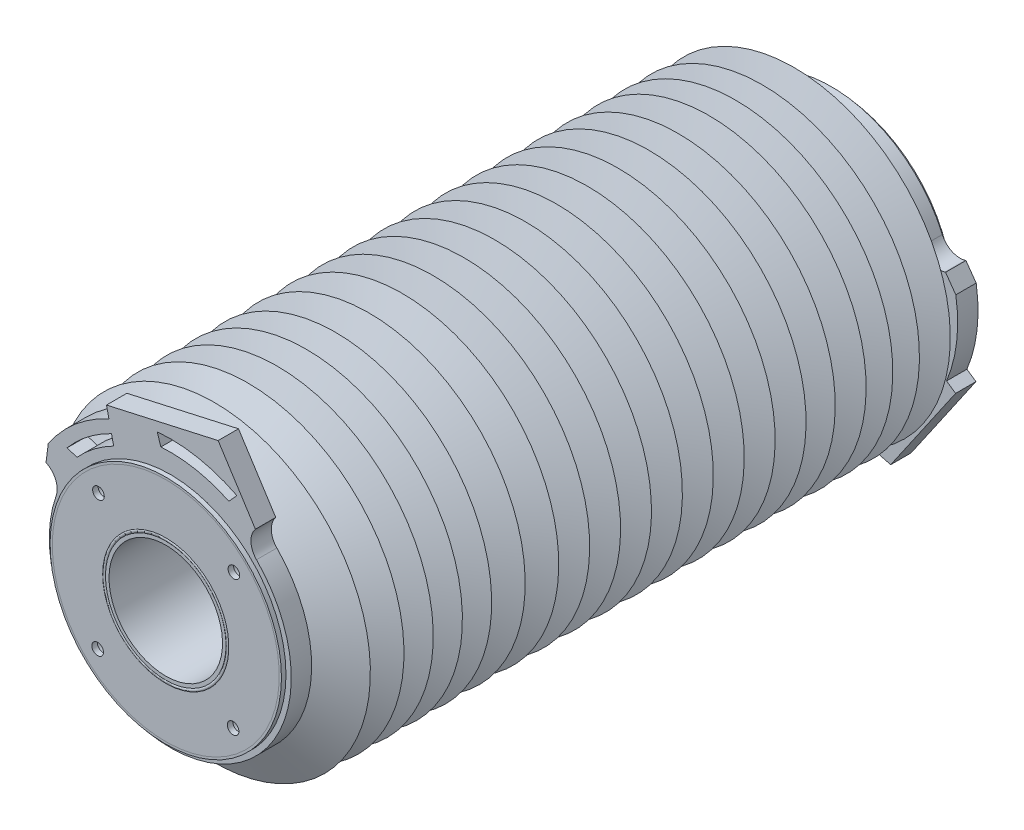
ISO-10303-21;
HEADER;
FILE_DESCRIPTION(('STEP AP214'),'2;1');
FILE_NAME('part.step','',(''),(''),'','','');
FILE_SCHEMA(('AUTOMOTIVE_DESIGN { 1 0 10303 214 1 1 1 1 }'));
ENDSEC;
DATA;
#1=APPLICATION_CONTEXT('core data for automotive mechanical design processes');
#2=APPLICATION_PROTOCOL_DEFINITION('international standard','automotive_design',2000,#1);
#3=PRODUCT_CONTEXT('',#1,'mechanical');
#4=PRODUCT('Part','Part','',(#3));
#5=PRODUCT_RELATED_PRODUCT_CATEGORY('part','',(#4));
#6=PRODUCT_DEFINITION_FORMATION('','',#4);
#7=PRODUCT_DEFINITION_CONTEXT('part definition',#1,'design');
#8=PRODUCT_DEFINITION('design','',#6,#7);
#9=PRODUCT_DEFINITION_SHAPE('','',#8);
#10=(LENGTH_UNIT() NAMED_UNIT(*) SI_UNIT(.MILLI.,.METRE.));
#11=(NAMED_UNIT(*) PLANE_ANGLE_UNIT() SI_UNIT($,.RADIAN.));
#12=(NAMED_UNIT(*) SI_UNIT($,.STERADIAN.) SOLID_ANGLE_UNIT());
#13=UNCERTAINTY_MEASURE_WITH_UNIT(LENGTH_MEASURE(1.E-05),#10,'distance_accuracy_value','');
#14=(GEOMETRIC_REPRESENTATION_CONTEXT(3) GLOBAL_UNCERTAINTY_ASSIGNED_CONTEXT((#13)) GLOBAL_UNIT_ASSIGNED_CONTEXT((#10,
#11,#12)) REPRESENTATION_CONTEXT('',''));
#15=CARTESIAN_POINT('',(0.,0.,0.));
#16=DIRECTION('',(0.,0.,1.));
#17=DIRECTION('',(1.,0.,0.));
#18=AXIS2_PLACEMENT_3D('',#15,#16,#17);
#19=CARTESIAN_POINT('',(0.,0.,2.06548177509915));
#20=DIRECTION('',(0.,0.,1.));
#21=DIRECTION('',(-0.567267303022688,-0.823533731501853,0.));
#22=AXIS2_PLACEMENT_3D('',#19,#20,#21);
#23=PLANE('',#22);
#24=DIRECTION('',(0.823533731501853,-0.567267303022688,0.));
#25=VECTOR('',#24,1.);
#26=CARTESIAN_POINT('',(56.2824741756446,-22.0618993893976,2.06548177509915));
#27=LINE('',#26,#25);
#28=CARTESIAN_POINT('',(52.6229109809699,-19.5411155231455,2.06548177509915));
#29=VERTEX_POINT('',#28);
#30=CARTESIAN_POINT('',(56.2824741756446,-22.0618993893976,2.06548177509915));
#31=VERTEX_POINT('',#30);
#32=EDGE_CURVE('E436',#29,#31,#27,.T.);
#33=ORIENTED_EDGE('',*,*,#32,.T.);
#34=CARTESIAN_POINT('',(0.,0.,2.06548177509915));
#35=DIRECTION('',(0.,0.,1.));
#36=DIRECTION('',(-0.567267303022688,-0.823533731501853,0.));
#37=AXIS2_PLACEMENT_3D('',#34,#35,#36);
#38=CIRCLE('',#37,60.452);
#39=CARTESIAN_POINT('',(60.3867758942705,2.80741893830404,2.06548177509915));
#40=VERTEX_POINT('',#39);
#41=EDGE_CURVE('E424',#31,#40,#38,.T.);
#42=ORIENTED_EDGE('',*,*,#41,.T.);
#43=DIRECTION('',(-0.903034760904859,-0.429567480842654,0.));
#44=VECTOR('',#43,1.);
#45=CARTESIAN_POINT('',(60.3867758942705,2.80741893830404,2.06548177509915));
#46=LINE('',#45,#44);
#47=CARTESIAN_POINT('',(56.1285553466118,0.781812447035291,2.06548177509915));
#48=VERTEX_POINT('',#47);
#49=EDGE_CURVE('E413',#40,#48,#46,.T.);
#50=ORIENTED_EDGE('',*,*,#49,.T.);
#51=CARTESIAN_POINT('',(0.,0.,2.06548177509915));
#52=DIRECTION('',(0.,0.,-1.));
#53=DIRECTION('',(-0.567267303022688,-0.823533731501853,0.));
#54=AXIS2_PLACEMENT_3D('',#51,#52,#53);
#55=CIRCLE('',#54,56.134);
#56=EDGE_CURVE('E398',#48,#29,#55,.T.);
#57=ORIENTED_EDGE('',*,*,#56,.T.);
#58=EDGE_LOOP('',(#33,#42,#50,#57));
#59=FACE_BOUND('',#58,.T.);
#60=CARTESIAN_POINT('',(0.,0.,2.06548177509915));
#61=DIRECTION('',(0.,0.,1.));
#62=DIRECTION('',(-0.567267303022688,-0.823533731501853,0.));
#63=AXIS2_PLACEMENT_3D('',#60,#61,#62);
#64=CIRCLE('',#63,65.6335999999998);
#65=CARTESIAN_POINT('',(60.6552928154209,-25.0739885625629,2.06548177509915));
#66=VERTEX_POINT('',#65);
#67=CARTESIAN_POINT('',(64.8049762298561,10.3963697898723,2.06548177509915));
#68=VERTEX_POINT('',#67);
#69=EDGE_CURVE('E816',#66,#68,#64,.T.);
#70=ORIENTED_EDGE('',*,*,#69,.F.);
#71=DIRECTION('',(-0.823533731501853,0.567267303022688,0.));
#72=VECTOR('',#71,1.);
#73=CARTESIAN_POINT('',(64.7010393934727,-27.8607836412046,2.06548177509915));
#74=LINE('',#73,#72);
#75=CARTESIAN_POINT('',(64.7010393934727,-27.8607836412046,2.06548177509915));
#76=VERTEX_POINT('',#75);
#77=EDGE_CURVE('E788',#76,#66,#74,.T.);
#78=ORIENTED_EDGE('',*,*,#77,.F.);
#79=DIRECTION('',(0.567267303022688,0.823533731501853,0.));
#80=VECTOR('',#79,1.);
#81=CARTESIAN_POINT('',(35.6488672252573,-70.0374499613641,2.06548177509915));
#82=LINE('',#81,#80);
#83=CARTESIAN_POINT('',(35.6488672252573,-70.0374499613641,2.06548177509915));
#84=VERTEX_POINT('',#83);
#85=EDGE_CURVE('E840',#84,#76,#82,.T.);
#86=ORIENTED_EDGE('',*,*,#85,.F.);
#87=DIRECTION('',(0.967885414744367,-0.251391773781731,0.));
#88=VECTOR('',#87,1.);
#89=CARTESIAN_POINT('',(35.6488672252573,-70.0374499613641,2.06548177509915));
#90=LINE('',#89,#88);
#91=CARTESIAN_POINT('',(5.73052599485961,-62.2666697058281,2.06548177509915));
#92=VERTEX_POINT('',#91);
#93=EDGE_CURVE('E837',#92,#84,#90,.T.);
#94=ORIENTED_EDGE('',*,*,#93,.F.);
#95=DIRECTION('',(0.0916447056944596,-0.995791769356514,0.));
#96=VECTOR('',#95,1.);
#97=CARTESIAN_POINT('',(5.69910344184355,-61.9252389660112,2.06548177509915));
#98=LINE('',#97,#96);
#99=CARTESIAN_POINT('',(5.69910344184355,-61.9252389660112,2.06548177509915));
#100=VERTEX_POINT('',#99);
#101=EDGE_CURVE('E834',#100,#92,#98,.T.);
#102=ORIENTED_EDGE('',*,*,#101,.F.);
#103=CARTESIAN_POINT('',(-2.900554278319,-62.7166826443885,2.06548177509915));
#104=DIRECTION('',(0.,0.,-1.));
#105=DIRECTION('',(-0.567267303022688,-0.823533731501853,0.));
#106=AXIS2_PLACEMENT_3D('',#103,#104,#105);
#107=CIRCLE('',#106,8.6359999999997);
#108=CARTESIAN_POINT('',(-2.50157844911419,-54.0899037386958,2.06548177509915));
#109=VERTEX_POINT('',#108);
#110=EDGE_CURVE('E832',#109,#100,#107,.T.);
#111=ORIENTED_EDGE('',*,*,#110,.F.);
#112=CARTESIAN_POINT('',(0.,0.,2.06548177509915));
#113=DIRECTION('',(0.,0.,1.));
#114=DIRECTION('',(-0.567267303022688,-0.823533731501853,0.));
#115=AXIS2_PLACEMENT_3D('',#112,#113,#114);
#116=CIRCLE('',#115,54.1477200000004);
#117=CARTESIAN_POINT('',(49.6460838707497,21.6157798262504,2.06548177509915));
#118=VERTEX_POINT('',#117);
#119=EDGE_CURVE('E829',#118,#109,#116,.T.);
#120=ORIENTED_EDGE('',*,*,#119,.F.);
#121=CARTESIAN_POINT('',(57.5641195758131,25.0632726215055,2.06548177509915));
#122=DIRECTION('',(0.,0.,-1.));
#123=DIRECTION('',(-0.567267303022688,-0.823533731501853,0.));
#124=AXIS2_PLACEMENT_3D('',#121,#122,#123);
#125=CIRCLE('',#124,8.6359999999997);
#126=CARTESIAN_POINT('',(59.8897042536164,16.7462928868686,2.06548177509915));
#127=VERTEX_POINT('',#126);
#128=EDGE_CURVE('E826',#127,#118,#125,.T.);
#129=ORIENTED_EDGE('',*,*,#128,.F.);
#130=DIRECTION('',(-0.963059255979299,-0.269289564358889,0.));
#131=VECTOR('',#130,1.);
#132=CARTESIAN_POINT('',(59.8897042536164,16.7462928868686,2.06548177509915));
#133=LINE('',#132,#131);
#134=CARTESIAN_POINT('',(60.2199118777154,16.838625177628,2.06548177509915));
#135=VERTEX_POINT('',#134);
#136=EDGE_CURVE('E823',#135,#127,#133,.T.);
#137=ORIENTED_EDGE('',*,*,#136,.F.);
#138=DIRECTION('',(-0.579851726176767,0.814722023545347,0.));
#139=VECTOR('',#138,1.);
#140=CARTESIAN_POINT('',(64.8049762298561,10.3963697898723,2.06548177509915));
#141=LINE('',#140,#139);
#142=EDGE_CURVE('E820',#68,#135,#141,.T.);
#143=ORIENTED_EDGE('',*,*,#142,.F.);
#144=EDGE_LOOP('',(#70,#78,#86,#94,#102,#111,#120,#129,#137,#143));
#145=FACE_BOUND('',#144,.T.);
#146=CARTESIAN_POINT('',(0.,0.,2.06548177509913));
#147=DIRECTION('',(0.,0.,1.));
#148=DIRECTION('',(1.,0.,0.));
#149=AXIS2_PLACEMENT_3D('',#146,#147,#148);
#150=CIRCLE('',#149,51.816);
#151=CARTESIAN_POINT('',(51.816,0.,2.06548177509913));
#152=VERTEX_POINT('',#151);
#153=EDGE_CURVE('E1065',#152,#152,#150,.T.);
#154=ORIENTED_EDGE('',*,*,#153,.T.);
#155=EDGE_LOOP('',(#154));
#156=FACE_BOUND('',#155,.T.);
#157=DIRECTION('',(0.00972986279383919,-0.999952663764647,0.));
#158=VECTOR('',#157,1.);
#159=CARTESIAN_POINT('',(17.8302420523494,-63.1652746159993,2.06548177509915));
#160=LINE('',#159,#158);
#161=CARTESIAN_POINT('',(17.7778301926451,-57.7788288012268,2.06548177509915));
#162=VERTEX_POINT('',#161);
#163=CARTESIAN_POINT('',(17.8302420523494,-63.1652746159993,2.06548177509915));
#164=VERTEX_POINT('',#163);
#165=EDGE_CURVE('E60',#162,#164,#160,.T.);
#166=ORIENTED_EDGE('',*,*,#165,.T.);
#167=CARTESIAN_POINT('',(0.,0.,2.06548177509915));
#168=DIRECTION('',(0.,0.,1.));
#169=DIRECTION('',(-0.567267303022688,-0.823533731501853,0.));
#170=AXIS2_PLACEMENT_3D('',#167,#168,#169);
#171=CIRCLE('',#170,65.6335999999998);
#172=CARTESIAN_POINT('',(48.7009684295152,-43.9998309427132,2.06548177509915));
#173=VERTEX_POINT('',#172);
#174=EDGE_CURVE('E370',#164,#173,#171,.T.);
#175=ORIENTED_EDGE('',*,*,#174,.T.);
#176=DIRECTION('',(-0.87084934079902,0.491550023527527,0.));
#177=VECTOR('',#176,1.);
#178=CARTESIAN_POINT('',(48.7009684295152,-43.9998309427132,2.06548177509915));
#179=LINE('',#178,#177);
#180=CARTESIAN_POINT('',(44.0662024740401,-41.3837420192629,2.06548177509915));
#181=VERTEX_POINT('',#180);
#182=EDGE_CURVE('E365',#173,#181,#179,.T.);
#183=ORIENTED_EDGE('',*,*,#182,.T.);
#184=CARTESIAN_POINT('',(0.,0.,2.06548177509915));
#185=DIRECTION('',(0.,0.,-1.));
#186=DIRECTION('',(-0.567267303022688,-0.823533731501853,0.));
#187=AXIS2_PLACEMENT_3D('',#184,#185,#186);
#188=CIRCLE('',#187,60.452);
#189=EDGE_CURVE('E354',#181,#162,#188,.T.);
#190=ORIENTED_EDGE('',*,*,#189,.T.);
#191=EDGE_LOOP('',(#166,#175,#183,#190));
#192=FACE_BOUND('',#191,.T.);
#193=ADVANCED_FACE('F40',(#59,#145,#156,#192),#23,.F.);
#194=CARTESIAN_POINT('',(0.,0.,11.1840817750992));
#195=DIRECTION('',(0.,0.,1.));
#196=DIRECTION('',(-0.567267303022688,-0.823533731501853,0.));
#197=AXIS2_PLACEMENT_3D('',#194,#195,#196);
#198=PLANE('',#197);
#199=CARTESIAN_POINT('',(0.,0.,11.1840817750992));
#200=DIRECTION('',(0.,0.,1.));
#201=DIRECTION('',(-0.567267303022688,-0.823533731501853,0.));
#202=AXIS2_PLACEMENT_3D('',#199,#200,#201);
#203=CIRCLE('',#202,60.452);
#204=CARTESIAN_POINT('',(56.2824741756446,-22.0618993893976,11.1840817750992));
#205=VERTEX_POINT('',#204);
#206=CARTESIAN_POINT('',(60.3867758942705,2.80741893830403,11.1840817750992));
#207=VERTEX_POINT('',#206);
#208=EDGE_CURVE('E432',#205,#207,#203,.T.);
#209=ORIENTED_EDGE('',*,*,#208,.F.);
#210=DIRECTION('',(0.823533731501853,-0.567267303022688,0.));
#211=VECTOR('',#210,1.);
#212=CARTESIAN_POINT('',(56.2824741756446,-22.0618993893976,11.1840817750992));
#213=LINE('',#212,#211);
#214=CARTESIAN_POINT('',(52.6229109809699,-19.5411155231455,11.1840817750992));
#215=VERTEX_POINT('',#214);
#216=EDGE_CURVE('E440',#215,#205,#213,.T.);
#217=ORIENTED_EDGE('',*,*,#216,.F.);
#218=CARTESIAN_POINT('',(0.,0.,11.1840817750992));
#219=DIRECTION('',(0.,0.,-1.));
#220=DIRECTION('',(-0.567267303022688,-0.823533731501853,0.));
#221=AXIS2_PLACEMENT_3D('',#218,#219,#220);
#222=CIRCLE('',#221,56.134);
#223=CARTESIAN_POINT('',(56.1285553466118,0.781812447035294,11.1840817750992));
#224=VERTEX_POINT('',#223);
#225=EDGE_CURVE('E402',#224,#215,#222,.T.);
#226=ORIENTED_EDGE('',*,*,#225,.F.);
#227=DIRECTION('',(-0.903034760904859,-0.429567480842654,0.));
#228=VECTOR('',#227,1.);
#229=CARTESIAN_POINT('',(60.3867758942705,2.80741893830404,11.1840817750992));
#230=LINE('',#229,#228);
#231=EDGE_CURVE('E421',#207,#224,#230,.T.);
#232=ORIENTED_EDGE('',*,*,#231,.F.);
#233=EDGE_LOOP('',(#209,#217,#226,#232));
#234=FACE_BOUND('',#233,.T.);
#235=CARTESIAN_POINT('',(0.,0.,11.1840817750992));
#236=DIRECTION('',(0.,0.,1.));
#237=DIRECTION('',(-0.567267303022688,-0.823533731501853,0.));
#238=AXIS2_PLACEMENT_3D('',#235,#236,#237);
#239=CIRCLE('',#238,65.6335999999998);
#240=CARTESIAN_POINT('',(60.6552928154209,-25.0739885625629,11.1840817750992));
#241=VERTEX_POINT('',#240);
#242=CARTESIAN_POINT('',(64.8049762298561,10.3963697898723,11.1840817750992));
#243=VERTEX_POINT('',#242);
#244=EDGE_CURVE('E783',#241,#243,#239,.T.);
#245=ORIENTED_EDGE('',*,*,#244,.T.);
#246=DIRECTION('',(-0.579851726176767,0.814722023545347,0.));
#247=VECTOR('',#246,1.);
#248=CARTESIAN_POINT('',(64.8049762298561,10.3963697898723,11.1840817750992));
#249=LINE('',#248,#247);
#250=CARTESIAN_POINT('',(60.2199118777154,16.838625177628,11.1840817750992));
#251=VERTEX_POINT('',#250);
#252=EDGE_CURVE('E787',#243,#251,#249,.T.);
#253=ORIENTED_EDGE('',*,*,#252,.T.);
#254=DIRECTION('',(-0.963059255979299,-0.269289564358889,0.));
#255=VECTOR('',#254,1.);
#256=CARTESIAN_POINT('',(59.8897042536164,16.7462928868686,11.1840817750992));
#257=LINE('',#256,#255);
#258=CARTESIAN_POINT('',(59.8897042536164,16.7462928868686,11.1840817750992));
#259=VERTEX_POINT('',#258);
#260=EDGE_CURVE('E791',#251,#259,#257,.T.);
#261=ORIENTED_EDGE('',*,*,#260,.T.);
#262=CARTESIAN_POINT('',(57.5641195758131,25.0632726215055,11.1840817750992));
#263=DIRECTION('',(0.,0.,-1.));
#264=DIRECTION('',(-0.567267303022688,-0.823533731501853,0.));
#265=AXIS2_PLACEMENT_3D('',#262,#263,#264);
#266=CIRCLE('',#265,8.6359999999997);
#267=CARTESIAN_POINT('',(49.6460838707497,21.6157798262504,11.1840817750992));
#268=VERTEX_POINT('',#267);
#269=EDGE_CURVE('E794',#259,#268,#266,.T.);
#270=ORIENTED_EDGE('',*,*,#269,.T.);
#271=CARTESIAN_POINT('',(0.,0.,11.1840817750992));
#272=DIRECTION('',(0.,0.,1.));
#273=DIRECTION('',(-0.567267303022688,-0.823533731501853,0.));
#274=AXIS2_PLACEMENT_3D('',#271,#272,#273);
#275=CIRCLE('',#274,54.1477200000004);
#276=CARTESIAN_POINT('',(-2.50157844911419,-54.0899037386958,11.1840817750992));
#277=VERTEX_POINT('',#276);
#278=EDGE_CURVE('E797',#268,#277,#275,.T.);
#279=ORIENTED_EDGE('',*,*,#278,.T.);
#280=CARTESIAN_POINT('',(-2.900554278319,-62.7166826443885,11.1840817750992));
#281=DIRECTION('',(0.,0.,-1.));
#282=DIRECTION('',(-0.567267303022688,-0.823533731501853,0.));
#283=AXIS2_PLACEMENT_3D('',#280,#281,#282);
#284=CIRCLE('',#283,8.6359999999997);
#285=CARTESIAN_POINT('',(5.69910344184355,-61.9252389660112,11.1840817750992));
#286=VERTEX_POINT('',#285);
#287=EDGE_CURVE('E800',#277,#286,#284,.T.);
#288=ORIENTED_EDGE('',*,*,#287,.T.);
#289=DIRECTION('',(0.0916447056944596,-0.995791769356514,0.));
#290=VECTOR('',#289,1.);
#291=CARTESIAN_POINT('',(5.69910344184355,-61.9252389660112,11.1840817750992));
#292=LINE('',#291,#290);
#293=CARTESIAN_POINT('',(5.73052599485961,-62.2666697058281,11.1840817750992));
#294=VERTEX_POINT('',#293);
#295=EDGE_CURVE('E803',#286,#294,#292,.T.);
#296=ORIENTED_EDGE('',*,*,#295,.T.);
#297=DIRECTION('',(0.967885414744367,-0.251391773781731,0.));
#298=VECTOR('',#297,1.);
#299=CARTESIAN_POINT('',(35.6488672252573,-70.0374499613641,11.1840817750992));
#300=LINE('',#299,#298);
#301=CARTESIAN_POINT('',(35.6488672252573,-70.0374499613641,11.1840817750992));
#302=VERTEX_POINT('',#301);
#303=EDGE_CURVE('E806',#294,#302,#300,.T.);
#304=ORIENTED_EDGE('',*,*,#303,.T.);
#305=DIRECTION('',(0.567267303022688,0.823533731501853,0.));
#306=VECTOR('',#305,1.);
#307=CARTESIAN_POINT('',(35.6488672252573,-70.0374499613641,11.1840817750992));
#308=LINE('',#307,#306);
#309=CARTESIAN_POINT('',(64.7010393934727,-27.8607836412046,11.1840817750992));
#310=VERTEX_POINT('',#309);
#311=EDGE_CURVE('E809',#302,#310,#308,.T.);
#312=ORIENTED_EDGE('',*,*,#311,.T.);
#313=DIRECTION('',(-0.823533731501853,0.567267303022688,0.));
#314=VECTOR('',#313,1.);
#315=CARTESIAN_POINT('',(64.7010393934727,-27.8607836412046,11.1840817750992));
#316=LINE('',#315,#314);
#317=EDGE_CURVE('E812',#310,#241,#316,.T.);
#318=ORIENTED_EDGE('',*,*,#317,.T.);
#319=EDGE_LOOP('',(#245,#253,#261,#270,#279,#288,#296,#304,#312,#318));
#320=FACE_BOUND('',#319,.T.);
#321=CARTESIAN_POINT('',(0.,0.,11.1840817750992));
#322=DIRECTION('',(0.,0.,1.));
#323=DIRECTION('',(1.,0.,0.));
#324=AXIS2_PLACEMENT_3D('',#321,#322,#323);
#325=CIRCLE('',#324,51.816);
#326=CARTESIAN_POINT('',(51.816,0.,11.1840817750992));
#327=VERTEX_POINT('',#326);
#328=EDGE_CURVE('E888',#327,#327,#325,.T.);
#329=ORIENTED_EDGE('',*,*,#328,.F.);
#330=EDGE_LOOP('',(#329));
#331=FACE_BOUND('',#330,.T.);
#332=CARTESIAN_POINT('',(0.,0.,11.1840817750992));
#333=DIRECTION('',(0.,0.,1.));
#334=DIRECTION('',(-0.567267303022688,-0.823533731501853,0.));
#335=AXIS2_PLACEMENT_3D('',#332,#333,#334);
#336=CIRCLE('',#335,65.6335999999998);
#337=CARTESIAN_POINT('',(17.8302420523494,-63.1652746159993,11.1840817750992));
#338=VERTEX_POINT('',#337);
#339=CARTESIAN_POINT('',(48.7009684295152,-43.9998309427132,11.1840817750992));
#340=VERTEX_POINT('',#339);
#341=EDGE_CURVE('E388',#338,#340,#336,.T.);
#342=ORIENTED_EDGE('',*,*,#341,.F.);
#343=DIRECTION('',(0.00972986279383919,-0.999952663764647,0.));
#344=VECTOR('',#343,1.);
#345=CARTESIAN_POINT('',(17.8302420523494,-63.1652746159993,11.1840817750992));
#346=LINE('',#345,#344);
#347=CARTESIAN_POINT('',(17.7778301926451,-57.7788288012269,11.1840817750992));
#348=VERTEX_POINT('',#347);
#349=EDGE_CURVE('E394',#348,#338,#346,.T.);
#350=ORIENTED_EDGE('',*,*,#349,.F.);
#351=CARTESIAN_POINT('',(0.,0.,11.1840817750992));
#352=DIRECTION('',(0.,0.,-1.));
#353=DIRECTION('',(-0.567267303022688,-0.823533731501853,0.));
#354=AXIS2_PLACEMENT_3D('',#351,#352,#353);
#355=CIRCLE('',#354,60.452);
#356=CARTESIAN_POINT('',(44.0662024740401,-41.3837420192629,11.1840817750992));
#357=VERTEX_POINT('',#356);
#358=EDGE_CURVE('E362',#357,#348,#355,.T.);
#359=ORIENTED_EDGE('',*,*,#358,.F.);
#360=DIRECTION('',(-0.87084934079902,0.491550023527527,0.));
#361=VECTOR('',#360,1.);
#362=CARTESIAN_POINT('',(48.7009684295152,-43.9998309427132,11.1840817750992));
#363=LINE('',#362,#361);
#364=EDGE_CURVE('E70',#340,#357,#363,.T.);
#365=ORIENTED_EDGE('',*,*,#364,.F.);
#366=EDGE_LOOP('',(#342,#350,#359,#365));
#367=FACE_BOUND('',#366,.T.);
#368=ADVANCED_FACE('F1109',(#234,#320,#331,#367),#198,.T.);
#369=CARTESIAN_POINT('',(0.,0.,297.983100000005));
#370=DIRECTION('',(0.,0.,1.));
#371=DIRECTION('',(0.97572055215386,0.219019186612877,0.));
#372=AXIS2_PLACEMENT_3D('',#369,#370,#371);
#373=PLANE('',#372);
#374=DIRECTION('',(0.954508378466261,-0.298184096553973,0.));
#375=VECTOR('',#374,1.);
#376=CARTESIAN_POINT('',(-46.2227536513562,38.9602534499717,297.983100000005));
#377=LINE('',#376,#375);
#378=CARTESIAN_POINT('',(-46.2227536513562,38.9602534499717,297.983100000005));
#379=VERTEX_POINT('',#378);
#380=CARTESIAN_POINT('',(-41.7218115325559,37.5541795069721,297.983100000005));
#381=VERTEX_POINT('',#380);
#382=EDGE_CURVE('E524',#379,#381,#377,.T.);
#383=ORIENTED_EDGE('',*,*,#382,.F.);
#384=CARTESIAN_POINT('',(0.,0.,297.983100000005));
#385=DIRECTION('',(0.,0.,1.));
#386=DIRECTION('',(0.97572055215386,0.219019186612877,0.));
#387=AXIS2_PLACEMENT_3D('',#384,#385,#386);
#388=CIRCLE('',#387,60.452);
#389=CARTESIAN_POINT('',(-26.3171166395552,54.4229149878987,297.983100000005));
#390=VERTEX_POINT('',#389);
#391=EDGE_CURVE('E532',#390,#379,#388,.T.);
#392=ORIENTED_EDGE('',*,*,#391,.F.);
#393=DIRECTION('',(-0.219019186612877,0.97572055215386,0.));
#394=VECTOR('',#393,1.);
#395=CARTESIAN_POINT('',(-26.3171166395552,54.4229149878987,297.983100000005));
#396=LINE('',#395,#394);
#397=CARTESIAN_POINT('',(-25.3438540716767,50.0870743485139,297.983100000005));
#398=VERTEX_POINT('',#397);
#399=EDGE_CURVE('E494',#398,#390,#396,.T.);
#400=ORIENTED_EDGE('',*,*,#399,.F.);
#401=CARTESIAN_POINT('',(0.,0.,297.983100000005));
#402=DIRECTION('',(0.,0.,-1.));
#403=DIRECTION('',(0.97572055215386,0.219019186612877,0.));
#404=AXIS2_PLACEMENT_3D('',#401,#402,#403);
#405=CIRCLE('',#404,56.134);
#406=EDGE_CURVE('E513',#381,#398,#405,.T.);
#407=ORIENTED_EDGE('',*,*,#406,.F.);
#408=EDGE_LOOP('',(#383,#392,#400,#407));
#409=FACE_BOUND('',#408,.T.);
#410=CARTESIAN_POINT('',(0.,0.,297.983100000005));
#411=DIRECTION('',(0.,0.,1.));
#412=DIRECTION('',(0.97572055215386,0.219019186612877,0.));
#413=AXIS2_PLACEMENT_3D('',#410,#411,#412);
#414=CIRCLE('',#413,65.6335999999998);
#415=CARTESIAN_POINT('',(-27.4800698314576,59.6038187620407,297.983100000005));
#416=VERTEX_POINT('',#415);
#417=CARTESIAN_POINT('',(-54.6202587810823,36.392262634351,297.983100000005));
#418=VERTEX_POINT('',#417);
#419=EDGE_CURVE('E673',#416,#418,#414,.T.);
#420=ORIENTED_EDGE('',*,*,#419,.T.);
#421=DIRECTION('',(-0.127905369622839,-0.991786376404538,0.));
#422=VECTOR('',#421,1.);
#423=CARTESIAN_POINT('',(-54.6202587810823,36.392262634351,297.983100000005));
#424=LINE('',#423,#422);
#425=CARTESIAN_POINT('',(-55.6316455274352,28.5499054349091,297.983100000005));
#426=VERTEX_POINT('',#425);
#427=EDGE_CURVE('E677',#418,#426,#424,.T.);
#428=ORIENTED_EDGE('',*,*,#427,.T.);
#429=DIRECTION('',(0.889681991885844,-0.456580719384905,0.));
#430=VECTOR('',#429,1.);
#431=CARTESIAN_POINT('',(-55.3265970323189,28.3933559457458,297.983100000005));
#432=LINE('',#431,#430);
#433=CARTESIAN_POINT('',(-55.3265970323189,28.3933559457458,297.983100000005));
#434=VERTEX_POINT('',#433);
#435=EDGE_CURVE('E681',#426,#434,#432,.T.);
#436=ORIENTED_EDGE('',*,*,#435,.T.);
#437=CARTESIAN_POINT('',(-59.2696281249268,20.7100622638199,297.983100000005));
#438=DIRECTION('',(0.,0.,-1.));
#439=DIRECTION('',(0.97572055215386,0.219019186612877,0.));
#440=AXIS2_PLACEMENT_3D('',#437,#438,#439);
#441=CIRCLE('',#440,8.6359999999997);
#442=CARTESIAN_POINT('',(-51.1169970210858,17.8613604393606,297.983100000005));
#443=VERTEX_POINT('',#442);
#444=EDGE_CURVE('E684',#434,#443,#441,.T.);
#445=ORIENTED_EDGE('',*,*,#444,.T.);
#446=CARTESIAN_POINT('',(0.,0.,297.983100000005));
#447=DIRECTION('',(0.,0.,1.));
#448=DIRECTION('',(0.97572055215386,0.219019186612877,0.));
#449=AXIS2_PLACEMENT_3D('',#446,#447,#448);
#450=CIRCLE('',#449,54.1477200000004);
#451=CARTESIAN_POINT('',(38.5788934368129,37.9953229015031,297.983100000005));
#452=VERTEX_POINT('',#451);
#453=EDGE_CURVE('E687',#443,#452,#450,.T.);
#454=ORIENTED_EDGE('',*,*,#453,.T.);
#455=CARTESIAN_POINT('',(44.7318269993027,44.0551830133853,297.983100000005));
#456=DIRECTION('',(0.,0.,-1.));
#457=DIRECTION('',(0.97572055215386,0.219019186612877,0.));
#458=AXIS2_PLACEMENT_3D('',#455,#456,#457);
#459=CIRCLE('',#458,8.6359999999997);
#460=CARTESIAN_POINT('',(37.8832225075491,49.3160871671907,297.983100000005));
#461=VERTEX_POINT('',#460);
#462=EDGE_CURVE('E690',#452,#461,#459,.T.);
#463=ORIENTED_EDGE('',*,*,#462,.T.);
#464=DIRECTION('',(0.60918297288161,0.793029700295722,0.));
#465=VECTOR('',#464,1.);
#466=CARTESIAN_POINT('',(37.8832225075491,49.3160871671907,297.983100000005));
#467=LINE('',#466,#465);
#468=CARTESIAN_POINT('',(38.0920952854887,49.5879961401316,297.983100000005));
#469=VERTEX_POINT('',#468);
#470=EDGE_CURVE('E693',#461,#469,#467,.T.);
#471=ORIENTED_EDGE('',*,*,#470,.T.);
#472=DIRECTION('',(-0.53952679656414,0.841968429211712,0.));
#473=VECTOR('',#472,1.);
#474=CARTESIAN_POINT('',(21.4147628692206,75.6141128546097,297.983100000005));
#475=LINE('',#474,#473);
#476=CARTESIAN_POINT('',(21.4147628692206,75.6141128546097,297.983100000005));
#477=VERTEX_POINT('',#476);
#478=EDGE_CURVE('E696',#469,#477,#475,.T.);
#479=ORIENTED_EDGE('',*,*,#478,.T.);
#480=DIRECTION('',(-0.97572055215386,-0.219019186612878,0.));
#481=VECTOR('',#480,1.);
#482=CARTESIAN_POINT('',(21.4147628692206,75.6141128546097,297.983100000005));
#483=LINE('',#482,#481);
#484=CARTESIAN_POINT('',(-28.5560380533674,64.3972084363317,297.983100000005));
#485=VERTEX_POINT('',#484);
#486=EDGE_CURVE('E699',#477,#485,#483,.T.);
#487=ORIENTED_EDGE('',*,*,#486,.T.);
#488=DIRECTION('',(0.219019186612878,-0.97572055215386,0.));
#489=VECTOR('',#488,1.);
#490=CARTESIAN_POINT('',(-28.5560380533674,64.3972084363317,297.983100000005));
#491=LINE('',#490,#489);
#492=EDGE_CURVE('E702',#485,#416,#491,.T.);
#493=ORIENTED_EDGE('',*,*,#492,.T.);
#494=EDGE_LOOP('',(#420,#428,#436,#445,#454,#463,#471,#479,#487,#493));
#495=FACE_BOUND('',#494,.T.);
#496=CARTESIAN_POINT('',(0.,0.,297.983100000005));
#497=DIRECTION('',(0.,0.,1.));
#498=DIRECTION('',(1.,0.,0.));
#499=AXIS2_PLACEMENT_3D('',#496,#497,#498);
#500=CIRCLE('',#499,51.7847783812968);
#501=CARTESIAN_POINT('',(51.7847783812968,0.,297.983100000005));
#502=VERTEX_POINT('',#501);
#503=EDGE_CURVE('E776',#502,#502,#500,.T.);
#504=ORIENTED_EDGE('',*,*,#503,.F.);
#505=EDGE_LOOP('',(#504));
#506=FACE_BOUND('',#505,.T.);
#507=DIRECTION('',(0.305176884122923,-0.952295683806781,0.));
#508=VECTOR('',#507,1.);
#509=CARTESIAN_POINT('',(-5.85096496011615,65.3722850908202,297.983100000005));
#510=LINE('',#509,#508);
#511=CARTESIAN_POINT('',(-5.85096496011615,65.3722850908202,297.983100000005));
#512=VERTEX_POINT('',#511);
#513=CARTESIAN_POINT('',(-4.22677651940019,60.3040518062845,297.983100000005));
#514=VERTEX_POINT('',#513);
#515=EDGE_CURVE('E478',#512,#514,#510,.T.);
#516=ORIENTED_EDGE('',*,*,#515,.F.);
#517=CARTESIAN_POINT('',(0.,0.,297.983100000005));
#518=DIRECTION('',(0.,0.,1.));
#519=DIRECTION('',(0.97572055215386,0.219019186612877,0.));
#520=AXIS2_PLACEMENT_3D('',#517,#518,#519);
#521=CIRCLE('',#520,65.6335999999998);
#522=CARTESIAN_POINT('',(29.822967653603,58.4667431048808,297.983100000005));
#523=VERTEX_POINT('',#522);
#524=EDGE_CURVE('E486',#523,#512,#521,.T.);
#525=ORIENTED_EDGE('',*,*,#524,.F.);
#526=DIRECTION('',(0.672123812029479,0.740438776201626,0.));
#527=VECTOR('',#526,1.);
#528=CARTESIAN_POINT('',(29.822967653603,58.4667431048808,297.983100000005));
#529=LINE('',#528,#527);
#530=CARTESIAN_POINT('',(26.2024377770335,54.4782209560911,297.983100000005));
#531=VERTEX_POINT('',#530);
#532=EDGE_CURVE('E448',#531,#523,#529,.T.);
#533=ORIENTED_EDGE('',*,*,#532,.F.);
#534=CARTESIAN_POINT('',(0.,0.,297.983100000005));
#535=DIRECTION('',(0.,0.,-1.));
#536=DIRECTION('',(0.97572055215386,0.219019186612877,0.));
#537=AXIS2_PLACEMENT_3D('',#534,#535,#536);
#538=CIRCLE('',#537,60.452);
#539=EDGE_CURVE('E467',#514,#531,#538,.T.);
#540=ORIENTED_EDGE('',*,*,#539,.F.);
#541=EDGE_LOOP('',(#516,#525,#533,#540));
#542=FACE_BOUND('',#541,.T.);
#543=ADVANCED_FACE('F1115',(#409,#495,#506,#542),#373,.T.);
#544=CARTESIAN_POINT('',(0.,0.,288.864500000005));
#545=DIRECTION('',(0.,0.,1.));
#546=DIRECTION('',(0.97572055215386,0.219019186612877,0.));
#547=AXIS2_PLACEMENT_3D('',#544,#545,#546);
#548=PLANE('',#547);
#549=CARTESIAN_POINT('',(0.,0.,288.864500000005));
#550=DIRECTION('',(0.,0.,1.));
#551=DIRECTION('',(0.97572055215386,0.219019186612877,0.));
#552=AXIS2_PLACEMENT_3D('',#549,#550,#551);
#553=CIRCLE('',#552,60.452);
#554=CARTESIAN_POINT('',(-26.3171166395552,54.4229149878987,288.864500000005));
#555=VERTEX_POINT('',#554);
#556=CARTESIAN_POINT('',(-46.2227536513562,38.9602534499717,288.864500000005));
#557=VERTEX_POINT('',#556);
#558=EDGE_CURVE('E528',#555,#557,#553,.T.);
#559=ORIENTED_EDGE('',*,*,#558,.T.);
#560=DIRECTION('',(0.954508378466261,-0.298184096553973,0.));
#561=VECTOR('',#560,1.);
#562=CARTESIAN_POINT('',(-46.2227536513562,38.9602534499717,288.864500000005));
#563=LINE('',#562,#561);
#564=CARTESIAN_POINT('',(-41.7218115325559,37.5541795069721,288.864500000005));
#565=VERTEX_POINT('',#564);
#566=EDGE_CURVE('E516',#557,#565,#563,.T.);
#567=ORIENTED_EDGE('',*,*,#566,.T.);
#568=CARTESIAN_POINT('',(0.,0.,288.864500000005));
#569=DIRECTION('',(0.,0.,-1.));
#570=DIRECTION('',(0.97572055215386,0.219019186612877,0.));
#571=AXIS2_PLACEMENT_3D('',#568,#569,#570);
#572=CIRCLE('',#571,56.134);
#573=CARTESIAN_POINT('',(-25.3438540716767,50.0870743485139,288.864500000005));
#574=VERTEX_POINT('',#573);
#575=EDGE_CURVE('E505',#565,#574,#572,.T.);
#576=ORIENTED_EDGE('',*,*,#575,.T.);
#577=DIRECTION('',(-0.219019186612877,0.97572055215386,0.));
#578=VECTOR('',#577,1.);
#579=CARTESIAN_POINT('',(-26.3171166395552,54.4229149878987,288.864500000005));
#580=LINE('',#579,#578);
#581=EDGE_CURVE('E490',#574,#555,#580,.T.);
#582=ORIENTED_EDGE('',*,*,#581,.T.);
#583=EDGE_LOOP('',(#559,#567,#576,#582));
#584=FACE_BOUND('',#583,.T.);
#585=CARTESIAN_POINT('',(0.,0.,288.864500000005));
#586=DIRECTION('',(0.,0.,1.));
#587=DIRECTION('',(0.97572055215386,0.219019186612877,0.));
#588=AXIS2_PLACEMENT_3D('',#585,#586,#587);
#589=CIRCLE('',#588,65.6335999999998);
#590=CARTESIAN_POINT('',(-27.4800698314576,59.6038187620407,288.864500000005));
#591=VERTEX_POINT('',#590);
#592=CARTESIAN_POINT('',(-54.6202587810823,36.392262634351,288.864500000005));
#593=VERTEX_POINT('',#592);
#594=EDGE_CURVE('E706',#591,#593,#589,.T.);
#595=ORIENTED_EDGE('',*,*,#594,.F.);
#596=DIRECTION('',(0.219019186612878,-0.97572055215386,0.));
#597=VECTOR('',#596,1.);
#598=CARTESIAN_POINT('',(-28.5560380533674,64.3972084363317,288.864500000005));
#599=LINE('',#598,#597);
#600=CARTESIAN_POINT('',(-28.5560380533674,64.3972084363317,288.864500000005));
#601=VERTEX_POINT('',#600);
#602=EDGE_CURVE('E678',#601,#591,#599,.T.);
#603=ORIENTED_EDGE('',*,*,#602,.F.);
#604=DIRECTION('',(-0.97572055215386,-0.219019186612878,0.));
#605=VECTOR('',#604,1.);
#606=CARTESIAN_POINT('',(21.4147628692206,75.6141128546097,288.864500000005));
#607=LINE('',#606,#605);
#608=CARTESIAN_POINT('',(21.4147628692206,75.6141128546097,288.864500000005));
#609=VERTEX_POINT('',#608);
#610=EDGE_CURVE('E732',#609,#601,#607,.T.);
#611=ORIENTED_EDGE('',*,*,#610,.F.);
#612=DIRECTION('',(-0.53952679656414,0.841968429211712,0.));
#613=VECTOR('',#612,1.);
#614=CARTESIAN_POINT('',(21.4147628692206,75.6141128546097,288.864500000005));
#615=LINE('',#614,#613);
#616=CARTESIAN_POINT('',(38.0920952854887,49.5879961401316,288.864500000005));
#617=VERTEX_POINT('',#616);
#618=EDGE_CURVE('E729',#617,#609,#615,.T.);
#619=ORIENTED_EDGE('',*,*,#618,.F.);
#620=DIRECTION('',(0.60918297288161,0.793029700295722,0.));
#621=VECTOR('',#620,1.);
#622=CARTESIAN_POINT('',(37.8832225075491,49.3160871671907,288.864500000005));
#623=LINE('',#622,#621);
#624=CARTESIAN_POINT('',(37.8832225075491,49.3160871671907,288.864500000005));
#625=VERTEX_POINT('',#624);
#626=EDGE_CURVE('E726',#625,#617,#623,.T.);
#627=ORIENTED_EDGE('',*,*,#626,.F.);
#628=CARTESIAN_POINT('',(44.7318269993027,44.0551830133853,288.864500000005));
#629=DIRECTION('',(0.,0.,-1.));
#630=DIRECTION('',(0.97572055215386,0.219019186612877,0.));
#631=AXIS2_PLACEMENT_3D('',#628,#629,#630);
#632=CIRCLE('',#631,8.6359999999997);
#633=CARTESIAN_POINT('',(38.5788934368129,37.9953229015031,288.864500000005));
#634=VERTEX_POINT('',#633);
#635=EDGE_CURVE('E723',#634,#625,#632,.T.);
#636=ORIENTED_EDGE('',*,*,#635,.F.);
#637=CARTESIAN_POINT('',(0.,0.,288.864500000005));
#638=DIRECTION('',(0.,0.,1.));
#639=DIRECTION('',(0.97572055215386,0.219019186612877,0.));
#640=AXIS2_PLACEMENT_3D('',#637,#638,#639);
#641=CIRCLE('',#640,54.1477200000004);
#642=CARTESIAN_POINT('',(-51.1169970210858,17.8613604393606,288.864500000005));
#643=VERTEX_POINT('',#642);
#644=EDGE_CURVE('E720',#643,#634,#641,.T.);
#645=ORIENTED_EDGE('',*,*,#644,.F.);
#646=CARTESIAN_POINT('',(-59.2696281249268,20.7100622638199,288.864500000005));
#647=DIRECTION('',(0.,0.,-1.));
#648=DIRECTION('',(0.97572055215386,0.219019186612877,0.));
#649=AXIS2_PLACEMENT_3D('',#646,#647,#648);
#650=CIRCLE('',#649,8.6359999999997);
#651=CARTESIAN_POINT('',(-55.3265970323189,28.3933559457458,288.864500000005));
#652=VERTEX_POINT('',#651);
#653=EDGE_CURVE('E717',#652,#643,#650,.T.);
#654=ORIENTED_EDGE('',*,*,#653,.F.);
#655=DIRECTION('',(0.889681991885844,-0.456580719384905,0.));
#656=VECTOR('',#655,1.);
#657=CARTESIAN_POINT('',(-55.3265970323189,28.3933559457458,288.864500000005));
#658=LINE('',#657,#656);
#659=CARTESIAN_POINT('',(-55.6316455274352,28.5499054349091,288.864500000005));
#660=VERTEX_POINT('',#659);
#661=EDGE_CURVE('E714',#660,#652,#658,.T.);
#662=ORIENTED_EDGE('',*,*,#661,.F.);
#663=DIRECTION('',(-0.127905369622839,-0.991786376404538,0.));
#664=VECTOR('',#663,1.);
#665=CARTESIAN_POINT('',(-54.6202587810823,36.392262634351,288.864500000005));
#666=LINE('',#665,#664);
#667=EDGE_CURVE('E710',#593,#660,#666,.T.);
#668=ORIENTED_EDGE('',*,*,#667,.F.);
#669=EDGE_LOOP('',(#595,#603,#611,#619,#627,#636,#645,#654,#662,#668));
#670=FACE_BOUND('',#669,.T.);
#671=CARTESIAN_POINT('',(0.,0.,288.864500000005));
#672=DIRECTION('',(0.,0.,1.));
#673=DIRECTION('',(1.,0.,0.));
#674=AXIS2_PLACEMENT_3D('',#671,#672,#673);
#675=CIRCLE('',#674,51.7847783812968);
#676=CARTESIAN_POINT('',(51.7847783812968,0.,288.864500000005));
#677=VERTEX_POINT('',#676);
#678=EDGE_CURVE('E1072',#677,#677,#675,.T.);
#679=ORIENTED_EDGE('',*,*,#678,.T.);
#680=EDGE_LOOP('',(#679));
#681=FACE_BOUND('',#680,.T.);
#682=CARTESIAN_POINT('',(0.,0.,288.864500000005));
#683=DIRECTION('',(0.,0.,1.));
#684=DIRECTION('',(0.97572055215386,0.219019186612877,0.));
#685=AXIS2_PLACEMENT_3D('',#682,#683,#684);
#686=CIRCLE('',#685,65.6335999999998);
#687=CARTESIAN_POINT('',(29.822967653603,58.4667431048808,288.864500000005));
#688=VERTEX_POINT('',#687);
#689=CARTESIAN_POINT('',(-5.85096496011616,65.3722850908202,288.864500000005));
#690=VERTEX_POINT('',#689);
#691=EDGE_CURVE('E482',#688,#690,#686,.T.);
#692=ORIENTED_EDGE('',*,*,#691,.T.);
#693=DIRECTION('',(0.305176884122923,-0.952295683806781,0.));
#694=VECTOR('',#693,1.);
#695=CARTESIAN_POINT('',(-5.85096496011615,65.3722850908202,288.864500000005));
#696=LINE('',#695,#694);
#697=CARTESIAN_POINT('',(-4.22677651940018,60.3040518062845,288.864500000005));
#698=VERTEX_POINT('',#697);
#699=EDGE_CURVE('E470',#690,#698,#696,.T.);
#700=ORIENTED_EDGE('',*,*,#699,.T.);
#701=CARTESIAN_POINT('',(0.,0.,288.864500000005));
#702=DIRECTION('',(0.,0.,-1.));
#703=DIRECTION('',(0.97572055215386,0.219019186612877,0.));
#704=AXIS2_PLACEMENT_3D('',#701,#702,#703);
#705=CIRCLE('',#704,60.452);
#706=CARTESIAN_POINT('',(26.2024377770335,54.4782209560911,288.864500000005));
#707=VERTEX_POINT('',#706);
#708=EDGE_CURVE('E459',#698,#707,#705,.T.);
#709=ORIENTED_EDGE('',*,*,#708,.T.);
#710=DIRECTION('',(0.672123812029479,0.740438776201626,0.));
#711=VECTOR('',#710,1.);
#712=CARTESIAN_POINT('',(29.822967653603,58.4667431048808,288.864500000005));
#713=LINE('',#712,#711);
#714=EDGE_CURVE('E444',#707,#688,#713,.T.);
#715=ORIENTED_EDGE('',*,*,#714,.T.);
#716=EDGE_LOOP('',(#692,#700,#709,#715));
#717=FACE_BOUND('',#716,.T.);
#718=ADVANCED_FACE('F1106',(#584,#670,#681,#717),#548,.F.);
#719=CARTESIAN_POINT('',(0.,0.,0.));
#720=DIRECTION('',(0.,0.,1.));
#721=DIRECTION('',(1.,0.,0.));
#722=AXIS2_PLACEMENT_3D('',#719,#720,#721);
#723=PLANE('',#722);
#724=CARTESIAN_POINT('',(0.,42.8625,0.));
#725=DIRECTION('',(0.,0.,1.));
#726=DIRECTION('',(1.,0.,0.));
#727=AXIS2_PLACEMENT_3D('',#724,#725,#726);
#728=CIRCLE('',#727,2.6035);
#729=CARTESIAN_POINT('',(2.6035,42.8625,0.));
#730=VERTEX_POINT('',#729);
#731=EDGE_CURVE('E544',#730,#730,#728,.T.);
#732=ORIENTED_EDGE('',*,*,#731,.T.);
#733=EDGE_LOOP('',(#732));
#734=FACE_BOUND('',#733,.T.);
#735=CARTESIAN_POINT('',(42.8625000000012,1.21297637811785E-12,0.));
#736=DIRECTION('',(0.,0.,1.));
#737=DIRECTION('',(1.,0.,0.));
#738=AXIS2_PLACEMENT_3D('',#735,#736,#737);
#739=CIRCLE('',#738,2.60349999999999);
#740=CARTESIAN_POINT('',(45.4660000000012,1.21297637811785E-12,0.));
#741=VERTEX_POINT('',#740);
#742=EDGE_CURVE('E560',#741,#741,#739,.T.);
#743=ORIENTED_EDGE('',*,*,#742,.T.);
#744=EDGE_LOOP('',(#743));
#745=FACE_BOUND('',#744,.T.);
#746=CARTESIAN_POINT('',(2.42595275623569E-12,-42.8625,0.));
#747=DIRECTION('',(0.,0.,1.));
#748=DIRECTION('',(1.,0.,0.));
#749=AXIS2_PLACEMENT_3D('',#746,#747,#748);
#750=CIRCLE('',#749,2.6035);
#751=CARTESIAN_POINT('',(2.60350000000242,-42.8625,0.));
#752=VERTEX_POINT('',#751);
#753=EDGE_CURVE('E576',#752,#752,#750,.T.);
#754=ORIENTED_EDGE('',*,*,#753,.T.);
#755=EDGE_LOOP('',(#754));
#756=FACE_BOUND('',#755,.T.);
#757=CARTESIAN_POINT('',(-42.8624999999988,-1.207727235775E-12,0.));
#758=DIRECTION('',(0.,0.,1.));
#759=DIRECTION('',(1.,0.,0.));
#760=AXIS2_PLACEMENT_3D('',#757,#758,#759);
#761=CIRCLE('',#760,2.6035);
#762=CARTESIAN_POINT('',(-40.2589999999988,-1.207727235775E-12,0.));
#763=VERTEX_POINT('',#762);
#764=EDGE_CURVE('E592',#763,#763,#761,.T.);
#765=ORIENTED_EDGE('',*,*,#764,.T.);
#766=EDGE_LOOP('',(#765));
#767=FACE_BOUND('',#766,.T.);
#768=CARTESIAN_POINT('',(0.,0.,0.));
#769=DIRECTION('',(0.,0.,1.));
#770=DIRECTION('',(1.,0.,0.));
#771=AXIS2_PLACEMENT_3D('',#768,#769,#770);
#772=CIRCLE('',#771,28.2319703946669);
#773=CARTESIAN_POINT('',(28.2319703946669,0.,0.));
#774=VERTEX_POINT('',#773);
#775=EDGE_CURVE('E11',#774,#774,#772,.F.);
#776=ORIENTED_EDGE('',*,*,#775,.F.);
#777=EDGE_LOOP('',(#776));
#778=FACE_BOUND('',#777,.T.);
#779=CARTESIAN_POINT('',(0.,0.,0.));
#780=DIRECTION('',(0.,0.,1.));
#781=DIRECTION('',(1.,0.,0.));
#782=AXIS2_PLACEMENT_3D('',#779,#780,#781);
#783=CIRCLE('',#782,50.8);
#784=CARTESIAN_POINT('',(50.8,0.,0.));
#785=VERTEX_POINT('',#784);
#786=EDGE_CURVE('E884',#785,#785,#783,.T.);
#787=ORIENTED_EDGE('',*,*,#786,.F.);
#788=EDGE_LOOP('',(#787));
#789=FACE_BOUND('',#788,.T.);
#790=ADVANCED_FACE('F1093',(#734,#745,#756,#767,#778,#789),#723,.F.);
#791=CARTESIAN_POINT('',(0.,0.,354.248893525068));
#792=DIRECTION('',(0.,0.,1.));
#793=DIRECTION('',(-0.193922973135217,0.98101675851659,0.));
#794=AXIS2_PLACEMENT_3D('',#791,#792,#793);
#795=CYLINDRICAL_SURFACE('',#794,51.7847783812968);
#796=CARTESIAN_POINT('',(0.,0.,287.307480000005));
#797=DIRECTION('',(0.,0.,1.));
#798=DIRECTION('',(-0.193922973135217,0.98101675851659,0.));
#799=AXIS2_PLACEMENT_3D('',#796,#797,#798);
#800=CIRCLE('',#799,51.7847783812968);
#801=CARTESIAN_POINT('',(-10.0422581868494,50.8017354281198,287.307480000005));
#802=VERTEX_POINT('',#801);
#803=EDGE_CURVE('E1053',#802,#802,#800,.T.);
#804=ORIENTED_EDGE('',*,*,#803,.T.);
#805=EDGE_LOOP('',(#804));
#806=FACE_BOUND('',#805,.T.);
#807=ORIENTED_EDGE('',*,*,#678,.F.);
#808=EDGE_LOOP('',(#807));
#809=FACE_BOUND('',#808,.T.);
#810=ADVANCED_FACE('F1105',(#806,#809),#795,.T.);
#811=CARTESIAN_POINT('',(0.,0.,278.2373229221));
#812=DIRECTION('',(0.,0.,-1.));
#813=DIRECTION('',(0.193922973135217,-0.98101675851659,0.));
#814=AXIS2_PLACEMENT_3D('',#811,#812,#813);
#815=CONICAL_SURFACE('',#814,69.8187783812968,1.10479341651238);
#816=ORIENTED_EDGE('',*,*,#803,.F.);
#817=EDGE_LOOP('',(#816));
#818=FACE_BOUND('',#817,.T.);
#819=CARTESIAN_POINT('',(0.,0.,278.2373229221));
#820=DIRECTION('',(0.,0.,1.));
#821=DIRECTION('',(-0.193922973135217,0.98101675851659,0.));
#822=AXIS2_PLACEMENT_3D('',#819,#820,#821);
#823=CIRCLE('',#822,69.8187783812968);
#824=CARTESIAN_POINT('',(-13.5394650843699,68.493391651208,278.2373229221));
#825=VERTEX_POINT('',#824);
#826=EDGE_CURVE('E1049',#825,#825,#823,.T.);
#827=ORIENTED_EDGE('',*,*,#826,.T.);
#828=EDGE_LOOP('',(#827));
#829=FACE_BOUND('',#828,.T.);
#830=ADVANCED_FACE('F2255',(#818,#829),#815,.T.);
#831=CARTESIAN_POINT('',(0.,0.,272.273147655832));
#832=DIRECTION('',(0.,0.,1.));
#833=DIRECTION('',(-0.193922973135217,0.98101675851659,0.));
#834=AXIS2_PLACEMENT_3D('',#831,#832,#833);
#835=CONICAL_SURFACE('',#834,51.7847783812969,1.25140107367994);
#836=ORIENTED_EDGE('',*,*,#826,.F.);
#837=EDGE_LOOP('',(#836));
#838=FACE_BOUND('',#837,.T.);
#839=CARTESIAN_POINT('',(0.,0.,272.273147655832));
#840=DIRECTION('',(0.,0.,1.));
#841=DIRECTION('',(-0.193922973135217,0.98101675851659,0.));
#842=AXIS2_PLACEMENT_3D('',#839,#840,#841);
#843=CIRCLE('',#842,51.7847783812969);
#844=CARTESIAN_POINT('',(-10.0422581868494,50.8017354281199,272.273147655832));
#845=VERTEX_POINT('',#844);
#846=EDGE_CURVE('E1045',#845,#845,#843,.T.);
#847=ORIENTED_EDGE('',*,*,#846,.T.);
#848=EDGE_LOOP('',(#847));
#849=FACE_BOUND('',#848,.T.);
#850=ADVANCED_FACE('F2244',(#838,#849),#835,.T.);
#851=CARTESIAN_POINT('',(0.,0.,263.202990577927));
#852=DIRECTION('',(0.,0.,-1.));
#853=DIRECTION('',(0.193922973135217,-0.98101675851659,0.));
#854=AXIS2_PLACEMENT_3D('',#851,#852,#853);
#855=CONICAL_SURFACE('',#854,69.8187783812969,1.10479341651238);
#856=ORIENTED_EDGE('',*,*,#846,.F.);
#857=EDGE_LOOP('',(#856));
#858=FACE_BOUND('',#857,.T.);
#859=CARTESIAN_POINT('',(0.,0.,263.202990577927));
#860=DIRECTION('',(0.,0.,1.));
#861=DIRECTION('',(-0.193922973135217,0.98101675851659,0.));
#862=AXIS2_PLACEMENT_3D('',#859,#860,#861);
#863=CIRCLE('',#862,69.8187783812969);
#864=CARTESIAN_POINT('',(-13.5394650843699,68.493391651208,263.202990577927));
#865=VERTEX_POINT('',#864);
#866=EDGE_CURVE('E1041',#865,#865,#863,.T.);
#867=ORIENTED_EDGE('',*,*,#866,.T.);
#868=EDGE_LOOP('',(#867));
#869=FACE_BOUND('',#868,.T.);
#870=ADVANCED_FACE('F2233',(#858,#869),#855,.T.);
#871=CARTESIAN_POINT('',(0.,0.,257.23881531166));
#872=DIRECTION('',(0.,0.,1.));
#873=DIRECTION('',(-0.193922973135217,0.98101675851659,0.));
#874=AXIS2_PLACEMENT_3D('',#871,#872,#873);
#875=CONICAL_SURFACE('',#874,51.7847783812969,1.25140107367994);
#876=ORIENTED_EDGE('',*,*,#866,.F.);
#877=EDGE_LOOP('',(#876));
#878=FACE_BOUND('',#877,.T.);
#879=CARTESIAN_POINT('',(0.,0.,257.23881531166));
#880=DIRECTION('',(0.,0.,1.));
#881=DIRECTION('',(-0.193922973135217,0.98101675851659,0.));
#882=AXIS2_PLACEMENT_3D('',#879,#880,#881);
#883=CIRCLE('',#882,51.7847783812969);
#884=CARTESIAN_POINT('',(-10.0422581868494,50.8017354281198,257.23881531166));
#885=VERTEX_POINT('',#884);
#886=EDGE_CURVE('E1037',#885,#885,#883,.T.);
#887=ORIENTED_EDGE('',*,*,#886,.T.);
#888=EDGE_LOOP('',(#887));
#889=FACE_BOUND('',#888,.T.);
#890=ADVANCED_FACE('F2222',(#878,#889),#875,.T.);
#891=CARTESIAN_POINT('',(0.,0.,250.135113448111));
#892=DIRECTION('',(0.,0.,-1.));
#893=DIRECTION('',(0.193922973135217,-0.98101675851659,0.));
#894=AXIS2_PLACEMENT_3D('',#891,#892,#893);
#895=CONICAL_SURFACE('',#894,69.85,1.19614383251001);
#896=ORIENTED_EDGE('',*,*,#886,.F.);
#897=EDGE_LOOP('',(#896));
#898=FACE_BOUND('',#897,.T.);
#899=CARTESIAN_POINT('',(0.,0.,250.135113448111));
#900=DIRECTION('',(0.,0.,1.));
#901=DIRECTION('',(-0.193922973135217,0.98101675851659,0.));
#902=AXIS2_PLACEMENT_3D('',#899,#900,#901);
#903=CIRCLE('',#902,69.85);
#904=CARTESIAN_POINT('',(-13.5455196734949,68.5240205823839,250.135113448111));
#905=VERTEX_POINT('',#904);
#906=EDGE_CURVE('E1033',#905,#905,#903,.T.);
#907=ORIENTED_EDGE('',*,*,#906,.T.);
#908=EDGE_LOOP('',(#907));
#909=FACE_BOUND('',#908,.T.);
#910=ADVANCED_FACE('F2211',(#898,#909),#895,.T.);
#911=CARTESIAN_POINT('',(0.,0.,244.170938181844));
#912=DIRECTION('',(0.,0.,1.));
#913=DIRECTION('',(-0.193922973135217,0.98101675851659,0.));
#914=AXIS2_PLACEMENT_3D('',#911,#912,#913);
#915=CONICAL_SURFACE('',#914,51.816,1.25140107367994);
#916=ORIENTED_EDGE('',*,*,#906,.F.);
#917=EDGE_LOOP('',(#916));
#918=FACE_BOUND('',#917,.T.);
#919=CARTESIAN_POINT('',(0.,0.,244.170938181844));
#920=DIRECTION('',(0.,0.,1.));
#921=DIRECTION('',(-0.193922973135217,0.98101675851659,0.));
#922=AXIS2_PLACEMENT_3D('',#919,#920,#921);
#923=CIRCLE('',#922,51.816);
#924=CARTESIAN_POINT('',(-10.0483127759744,50.8323643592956,244.170938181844));
#925=VERTEX_POINT('',#924);
#926=EDGE_CURVE('E1029',#925,#925,#923,.T.);
#927=ORIENTED_EDGE('',*,*,#926,.T.);
#928=EDGE_LOOP('',(#927));
#929=FACE_BOUND('',#928,.T.);
#930=ADVANCED_FACE('F2200',(#918,#929),#915,.T.);
#931=CARTESIAN_POINT('',(0.,0.,237.079513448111));
#932=DIRECTION('',(0.,0.,-1.));
#933=DIRECTION('',(0.193922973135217,-0.98101675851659,0.));
#934=AXIS2_PLACEMENT_3D('',#931,#932,#933);
#935=CONICAL_SURFACE('',#934,69.85,1.19614383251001);
#936=ORIENTED_EDGE('',*,*,#926,.F.);
#937=EDGE_LOOP('',(#936));
#938=FACE_BOUND('',#937,.T.);
#939=CARTESIAN_POINT('',(0.,0.,237.079513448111));
#940=DIRECTION('',(0.,0.,1.));
#941=DIRECTION('',(-0.193922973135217,0.98101675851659,0.));
#942=AXIS2_PLACEMENT_3D('',#939,#940,#941);
#943=CIRCLE('',#942,69.85);
#944=CARTESIAN_POINT('',(-13.5455196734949,68.5240205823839,237.079513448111));
#945=VERTEX_POINT('',#944);
#946=EDGE_CURVE('E1025',#945,#945,#943,.T.);
#947=ORIENTED_EDGE('',*,*,#946,.T.);
#948=EDGE_LOOP('',(#947));
#949=FACE_BOUND('',#948,.T.);
#950=ADVANCED_FACE('F2189',(#938,#949),#935,.T.);
#951=CARTESIAN_POINT('',(0.,0.,231.115338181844));
#952=DIRECTION('',(0.,0.,1.));
#953=DIRECTION('',(-0.193922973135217,0.98101675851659,0.));
#954=AXIS2_PLACEMENT_3D('',#951,#952,#953);
#955=CONICAL_SURFACE('',#954,51.816,1.25140107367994);
#956=ORIENTED_EDGE('',*,*,#946,.F.);
#957=EDGE_LOOP('',(#956));
#958=FACE_BOUND('',#957,.T.);
#959=CARTESIAN_POINT('',(0.,0.,231.115338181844));
#960=DIRECTION('',(0.,0.,1.));
#961=DIRECTION('',(-0.193922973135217,0.98101675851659,0.));
#962=AXIS2_PLACEMENT_3D('',#959,#960,#961);
#963=CIRCLE('',#962,51.816);
#964=CARTESIAN_POINT('',(-10.0483127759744,50.8323643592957,231.115338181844));
#965=VERTEX_POINT('',#964);
#966=EDGE_CURVE('E1021',#965,#965,#963,.T.);
#967=ORIENTED_EDGE('',*,*,#966,.T.);
#968=EDGE_LOOP('',(#967));
#969=FACE_BOUND('',#968,.T.);
#970=ADVANCED_FACE('F2178',(#958,#969),#955,.T.);
#971=CARTESIAN_POINT('',(0.,0.,224.011636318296));
#972=DIRECTION('',(0.,0.,-1.));
#973=DIRECTION('',(0.193922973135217,-0.98101675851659,0.));
#974=AXIS2_PLACEMENT_3D('',#971,#972,#973);
#975=CONICAL_SURFACE('',#974,69.8812216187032,1.19614383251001);
#976=ORIENTED_EDGE('',*,*,#966,.F.);
#977=EDGE_LOOP('',(#976));
#978=FACE_BOUND('',#977,.T.);
#979=CARTESIAN_POINT('',(0.,0.,224.011636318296));
#980=DIRECTION('',(0.,0.,1.));
#981=DIRECTION('',(-0.193922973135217,0.98101675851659,0.));
#982=AXIS2_PLACEMENT_3D('',#979,#980,#981);
#983=CIRCLE('',#982,69.8812216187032);
#984=CARTESIAN_POINT('',(-13.5515742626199,68.5546495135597,224.011636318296));
#985=VERTEX_POINT('',#984);
#986=EDGE_CURVE('E1017',#985,#985,#983,.T.);
#987=ORIENTED_EDGE('',*,*,#986,.T.);
#988=EDGE_LOOP('',(#987));
#989=FACE_BOUND('',#988,.T.);
#990=ADVANCED_FACE('F2167',(#978,#989),#975,.T.);
#991=CARTESIAN_POINT('',(0.,0.,216.172352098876));
#992=DIRECTION('',(0.,0.,1.));
#993=DIRECTION('',(-0.193922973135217,0.98101675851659,0.));
#994=AXIS2_PLACEMENT_3D('',#991,#992,#993);
#995=CONICAL_SURFACE('',#994,51.8813138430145,1.16005065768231);
#996=ORIENTED_EDGE('',*,*,#986,.F.);
#997=EDGE_LOOP('',(#996));
#998=FACE_BOUND('',#997,.T.);
#999=CARTESIAN_POINT('',(0.,0.,216.172352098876));
#1000=DIRECTION('',(0.,0.,1.));
#1001=DIRECTION('',(-0.193922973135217,0.98101675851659,0.));
#1002=AXIS2_PLACEMENT_3D('',#999,#1000,#1001);
#1003=CIRCLE('',#1002,51.8813138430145);
#1004=CARTESIAN_POINT('',(-10.0609786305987,50.896438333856,216.172352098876));
#1005=VERTEX_POINT('',#1004);
#1006=EDGE_CURVE('E1013',#1005,#1005,#1003,.T.);
#1007=ORIENTED_EDGE('',*,*,#1006,.T.);
#1008=EDGE_LOOP('',(#1007));
#1009=FACE_BOUND('',#1008,.T.);
#1010=ADVANCED_FACE('F2156',(#998,#1009),#995,.T.);
#1011=CARTESIAN_POINT('',(0.,0.,209.068650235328));
#1012=DIRECTION('',(0.,0.,-1.));
#1013=DIRECTION('',(0.193922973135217,-0.98101675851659,0.));
#1014=AXIS2_PLACEMENT_3D('',#1011,#1012,#1013);
#1015=CONICAL_SURFACE('',#1014,69.9465354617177,1.19614383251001);
#1016=ORIENTED_EDGE('',*,*,#1006,.F.);
#1017=EDGE_LOOP('',(#1016));
#1018=FACE_BOUND('',#1017,.T.);
#1019=CARTESIAN_POINT('',(0.,0.,209.068650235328));
#1020=DIRECTION('',(0.,0.,1.));
#1021=DIRECTION('',(-0.193922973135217,0.98101675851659,0.));
#1022=AXIS2_PLACEMENT_3D('',#1019,#1020,#1021);
#1023=CIRCLE('',#1022,69.9465354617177);
#1024=CARTESIAN_POINT('',(-13.5642401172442,68.6187234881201,209.068650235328));
#1025=VERTEX_POINT('',#1024);
#1026=EDGE_CURVE('E1009',#1025,#1025,#1023,.T.);
#1027=ORIENTED_EDGE('',*,*,#1026,.T.);
#1028=EDGE_LOOP('',(#1027));
#1029=FACE_BOUND('',#1028,.T.);
#1030=ADVANCED_FACE('F2145',(#1018,#1029),#1015,.T.);
#1031=CARTESIAN_POINT('',(0.,0.,201.229366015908));
#1032=DIRECTION('',(0.,0.,1.));
#1033=DIRECTION('',(-0.193922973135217,0.98101675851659,0.));
#1034=AXIS2_PLACEMENT_3D('',#1031,#1032,#1033);
#1035=CONICAL_SURFACE('',#1034,51.9466276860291,1.16005065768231);
#1036=ORIENTED_EDGE('',*,*,#1026,.F.);
#1037=EDGE_LOOP('',(#1036));
#1038=FACE_BOUND('',#1037,.T.);
#1039=CARTESIAN_POINT('',(0.,0.,201.229366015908));
#1040=DIRECTION('',(0.,0.,1.));
#1041=DIRECTION('',(-0.193922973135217,0.98101675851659,0.));
#1042=AXIS2_PLACEMENT_3D('',#1039,#1040,#1041);
#1043=CIRCLE('',#1042,51.9466276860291);
#1044=CARTESIAN_POINT('',(-10.0736444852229,50.9605123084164,201.229366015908));
#1045=VERTEX_POINT('',#1044);
#1046=EDGE_CURVE('E1005',#1045,#1045,#1043,.T.);
#1047=ORIENTED_EDGE('',*,*,#1046,.T.);
#1048=EDGE_LOOP('',(#1047));
#1049=FACE_BOUND('',#1048,.T.);
#1050=ADVANCED_FACE('F2134',(#1038,#1049),#1035,.T.);
#1051=CARTESIAN_POINT('',(0.,0.,194.12566415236));
#1052=DIRECTION('',(0.,0.,-1.));
#1053=DIRECTION('',(0.193922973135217,-0.98101675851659,0.));
#1054=AXIS2_PLACEMENT_3D('',#1051,#1052,#1053);
#1055=CONICAL_SURFACE('',#1054,70.0118493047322,1.19614383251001);
#1056=ORIENTED_EDGE('',*,*,#1046,.F.);
#1057=EDGE_LOOP('',(#1056));
#1058=FACE_BOUND('',#1057,.T.);
#1059=CARTESIAN_POINT('',(0.,0.,194.12566415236));
#1060=DIRECTION('',(0.,0.,1.));
#1061=DIRECTION('',(-0.193922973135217,0.98101675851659,0.));
#1062=AXIS2_PLACEMENT_3D('',#1059,#1060,#1061);
#1063=CIRCLE('',#1062,70.0118493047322);
#1064=CARTESIAN_POINT('',(-13.5769059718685,68.6827974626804,194.12566415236));
#1065=VERTEX_POINT('',#1064);
#1066=EDGE_CURVE('E1001',#1065,#1065,#1063,.T.);
#1067=ORIENTED_EDGE('',*,*,#1066,.T.);
#1068=EDGE_LOOP('',(#1067));
#1069=FACE_BOUND('',#1068,.T.);
#1070=ADVANCED_FACE('F2123',(#1058,#1069),#1055,.T.);
#1071=CARTESIAN_POINT('',(0.,0.,186.286379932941));
#1072=DIRECTION('',(0.,0.,1.));
#1073=DIRECTION('',(-0.193922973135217,0.98101675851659,0.));
#1074=AXIS2_PLACEMENT_3D('',#1071,#1072,#1073);
#1075=CONICAL_SURFACE('',#1074,52.0119415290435,1.16005065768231);
#1076=ORIENTED_EDGE('',*,*,#1066,.F.);
#1077=EDGE_LOOP('',(#1076));
#1078=FACE_BOUND('',#1077,.T.);
#1079=CARTESIAN_POINT('',(0.,0.,186.286379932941));
#1080=DIRECTION('',(0.,0.,1.));
#1081=DIRECTION('',(-0.193922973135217,0.98101675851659,0.));
#1082=AXIS2_PLACEMENT_3D('',#1079,#1080,#1081);
#1083=CIRCLE('',#1082,52.0119415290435);
#1084=CARTESIAN_POINT('',(-10.0863103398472,51.0245862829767,186.286379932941));
#1085=VERTEX_POINT('',#1084);
#1086=EDGE_CURVE('E997',#1085,#1085,#1083,.T.);
#1087=ORIENTED_EDGE('',*,*,#1086,.T.);
#1088=EDGE_LOOP('',(#1087));
#1089=FACE_BOUND('',#1088,.T.);
#1090=ADVANCED_FACE('F2112',(#1078,#1089),#1075,.T.);
#1091=CARTESIAN_POINT('',(0.,0.,180.322204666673));
#1092=DIRECTION('',(0.,0.,-1.));
#1093=DIRECTION('',(0.193922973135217,-0.98101675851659,0.));
#1094=AXIS2_PLACEMENT_3D('',#1091,#1092,#1093);
#1095=CONICAL_SURFACE('',#1094,70.0459415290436,1.25140107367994);
#1096=ORIENTED_EDGE('',*,*,#1086,.F.);
#1097=EDGE_LOOP('',(#1096));
#1098=FACE_BOUND('',#1097,.T.);
#1099=CARTESIAN_POINT('',(0.,0.,180.322204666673));
#1100=DIRECTION('',(0.,0.,1.));
#1101=DIRECTION('',(-0.193922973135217,0.98101675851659,0.));
#1102=AXIS2_PLACEMENT_3D('',#1099,#1100,#1101);
#1103=CIRCLE('',#1102,70.0459415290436);
#1104=CARTESIAN_POINT('',(-13.5835172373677,68.716242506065,180.322204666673));
#1105=VERTEX_POINT('',#1104);
#1106=EDGE_CURVE('E993',#1105,#1105,#1103,.T.);
#1107=ORIENTED_EDGE('',*,*,#1106,.T.);
#1108=EDGE_LOOP('',(#1107));
#1109=FACE_BOUND('',#1108,.T.);
#1110=ADVANCED_FACE('F2101',(#1098,#1109),#1095,.T.);
#1111=CARTESIAN_POINT('',(0.,0.,172.482920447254));
#1112=DIRECTION('',(0.,0.,1.));
#1113=DIRECTION('',(-0.193922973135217,0.98101675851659,0.));
#1114=AXIS2_PLACEMENT_3D('',#1111,#1112,#1113);
#1115=CONICAL_SURFACE('',#1114,52.046033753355,1.16005065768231);
#1116=ORIENTED_EDGE('',*,*,#1106,.F.);
#1117=EDGE_LOOP('',(#1116));
#1118=FACE_BOUND('',#1117,.T.);
#1119=CARTESIAN_POINT('',(0.,0.,172.482920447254));
#1120=DIRECTION('',(0.,0.,1.));
#1121=DIRECTION('',(-0.193922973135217,0.98101675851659,0.));
#1122=AXIS2_PLACEMENT_3D('',#1119,#1120,#1121);
#1123=CIRCLE('',#1122,52.046033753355);
#1124=CARTESIAN_POINT('',(-10.0929216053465,51.0580313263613,172.482920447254));
#1125=VERTEX_POINT('',#1124);
#1126=EDGE_CURVE('E989',#1125,#1125,#1123,.T.);
#1127=ORIENTED_EDGE('',*,*,#1126,.T.);
#1128=EDGE_LOOP('',(#1127));
#1129=FACE_BOUND('',#1128,.T.);
#1130=ADVANCED_FACE('F2090',(#1118,#1129),#1115,.T.);
#1131=CARTESIAN_POINT('',(0.,0.,166.518745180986));
#1132=DIRECTION('',(0.,0.,-1.));
#1133=DIRECTION('',(0.193922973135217,-0.98101675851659,0.));
#1134=AXIS2_PLACEMENT_3D('',#1131,#1132,#1133);
#1135=CONICAL_SURFACE('',#1134,70.0800337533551,1.25140107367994);
#1136=ORIENTED_EDGE('',*,*,#1126,.F.);
#1137=EDGE_LOOP('',(#1136));
#1138=FACE_BOUND('',#1137,.T.);
#1139=CARTESIAN_POINT('',(0.,0.,166.518745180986));
#1140=DIRECTION('',(0.,0.,1.));
#1141=DIRECTION('',(-0.193922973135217,0.98101675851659,0.));
#1142=AXIS2_PLACEMENT_3D('',#1139,#1140,#1141);
#1143=CIRCLE('',#1142,70.0800337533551);
#1144=CARTESIAN_POINT('',(-13.590128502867,68.7496875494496,166.518745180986));
#1145=VERTEX_POINT('',#1144);
#1146=EDGE_CURVE('E985',#1145,#1145,#1143,.T.);
#1147=ORIENTED_EDGE('',*,*,#1146,.T.);
#1148=EDGE_LOOP('',(#1147));
#1149=FACE_BOUND('',#1148,.T.);
#1150=ADVANCED_FACE('F2079',(#1138,#1149),#1135,.T.);
#1151=CARTESIAN_POINT('',(0.,0.,158.679460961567));
#1152=DIRECTION('',(0.,0.,1.));
#1153=DIRECTION('',(-0.193922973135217,0.98101675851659,0.));
#1154=AXIS2_PLACEMENT_3D('',#1151,#1152,#1153);
#1155=CONICAL_SURFACE('',#1154,52.0801259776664,1.16005065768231);
#1156=ORIENTED_EDGE('',*,*,#1146,.F.);
#1157=EDGE_LOOP('',(#1156));
#1158=FACE_BOUND('',#1157,.T.);
#1159=CARTESIAN_POINT('',(0.,0.,158.679460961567));
#1160=DIRECTION('',(0.,0.,1.));
#1161=DIRECTION('',(-0.193922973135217,0.98101675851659,0.));
#1162=AXIS2_PLACEMENT_3D('',#1159,#1160,#1161);
#1163=CIRCLE('',#1162,52.0801259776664);
#1164=CARTESIAN_POINT('',(-10.0995328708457,51.091476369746,158.679460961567));
#1165=VERTEX_POINT('',#1164);
#1166=EDGE_CURVE('E981',#1165,#1165,#1163,.T.);
#1167=ORIENTED_EDGE('',*,*,#1166,.T.);
#1168=EDGE_LOOP('',(#1167));
#1169=FACE_BOUND('',#1168,.T.);
#1170=ADVANCED_FACE('F2068',(#1158,#1169),#1155,.T.);
#1171=CARTESIAN_POINT('',(0.,0.,152.715285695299));
#1172=DIRECTION('',(0.,0.,-1.));
#1173=DIRECTION('',(0.193922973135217,-0.98101675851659,0.));
#1174=AXIS2_PLACEMENT_3D('',#1171,#1172,#1173);
#1175=CONICAL_SURFACE('',#1174,70.1141259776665,1.25140107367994);
#1176=ORIENTED_EDGE('',*,*,#1166,.F.);
#1177=EDGE_LOOP('',(#1176));
#1178=FACE_BOUND('',#1177,.T.);
#1179=CARTESIAN_POINT('',(0.,0.,152.715285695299));
#1180=DIRECTION('',(0.,0.,1.));
#1181=DIRECTION('',(-0.193922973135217,0.98101675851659,0.));
#1182=AXIS2_PLACEMENT_3D('',#1179,#1180,#1181);
#1183=CIRCLE('',#1182,70.1141259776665);
#1184=CARTESIAN_POINT('',(-13.5967397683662,68.7831325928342,152.715285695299));
#1185=VERTEX_POINT('',#1184);
#1186=EDGE_CURVE('E977',#1185,#1185,#1183,.T.);
#1187=ORIENTED_EDGE('',*,*,#1186,.T.);
#1188=EDGE_LOOP('',(#1187));
#1189=FACE_BOUND('',#1188,.T.);
#1190=ADVANCED_FACE('F2057',(#1178,#1189),#1175,.T.);
#1191=CARTESIAN_POINT('',(0.,0.,144.87600147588));
#1192=DIRECTION('',(0.,0.,1.));
#1193=DIRECTION('',(-0.193922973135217,0.98101675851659,0.));
#1194=AXIS2_PLACEMENT_3D('',#1191,#1192,#1193);
#1195=CONICAL_SURFACE('',#1194,52.1142182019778,1.16005065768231);
#1196=ORIENTED_EDGE('',*,*,#1186,.F.);
#1197=EDGE_LOOP('',(#1196));
#1198=FACE_BOUND('',#1197,.T.);
#1199=CARTESIAN_POINT('',(0.,0.,144.87600147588));
#1200=DIRECTION('',(0.,0.,1.));
#1201=DIRECTION('',(-0.193922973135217,0.98101675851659,0.));
#1202=AXIS2_PLACEMENT_3D('',#1199,#1200,#1201);
#1203=CIRCLE('',#1202,52.1142182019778);
#1204=CARTESIAN_POINT('',(-10.106144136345,51.1249214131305,144.87600147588));
#1205=VERTEX_POINT('',#1204);
#1206=EDGE_CURVE('E973',#1205,#1205,#1203,.T.);
#1207=ORIENTED_EDGE('',*,*,#1206,.T.);
#1208=EDGE_LOOP('',(#1207));
#1209=FACE_BOUND('',#1208,.T.);
#1210=ADVANCED_FACE('F2046',(#1198,#1209),#1195,.T.);
#1211=CARTESIAN_POINT('',(0.,0.,138.911826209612));
#1212=DIRECTION('',(0.,0.,-1.));
#1213=DIRECTION('',(0.193922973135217,-0.98101675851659,0.));
#1214=AXIS2_PLACEMENT_3D('',#1211,#1212,#1213);
#1215=CONICAL_SURFACE('',#1214,70.1482182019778,1.25140107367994);
#1216=ORIENTED_EDGE('',*,*,#1206,.F.);
#1217=EDGE_LOOP('',(#1216));
#1218=FACE_BOUND('',#1217,.T.);
#1219=CARTESIAN_POINT('',(0.,0.,138.911826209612));
#1220=DIRECTION('',(0.,0.,1.));
#1221=DIRECTION('',(-0.193922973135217,0.98101675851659,0.));
#1222=AXIS2_PLACEMENT_3D('',#1219,#1220,#1221);
#1223=CIRCLE('',#1222,70.1482182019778);
#1224=CARTESIAN_POINT('',(-13.6033510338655,68.8165776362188,138.911826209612));
#1225=VERTEX_POINT('',#1224);
#1226=EDGE_CURVE('E969',#1225,#1225,#1223,.T.);
#1227=ORIENTED_EDGE('',*,*,#1226,.T.);
#1228=EDGE_LOOP('',(#1227));
#1229=FACE_BOUND('',#1228,.T.);
#1230=ADVANCED_FACE('F2035',(#1218,#1229),#1215,.T.);
#1231=CARTESIAN_POINT('',(0.,0.,131.072541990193));
#1232=DIRECTION('',(0.,0.,1.));
#1233=DIRECTION('',(-0.193922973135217,0.98101675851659,0.));
#1234=AXIS2_PLACEMENT_3D('',#1231,#1232,#1233);
#1235=CONICAL_SURFACE('',#1234,52.1483104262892,1.16005065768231);
#1236=ORIENTED_EDGE('',*,*,#1226,.F.);
#1237=EDGE_LOOP('',(#1236));
#1238=FACE_BOUND('',#1237,.T.);
#1239=CARTESIAN_POINT('',(0.,0.,131.072541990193));
#1240=DIRECTION('',(0.,0.,1.));
#1241=DIRECTION('',(-0.193922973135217,0.98101675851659,0.));
#1242=AXIS2_PLACEMENT_3D('',#1239,#1240,#1241);
#1243=CIRCLE('',#1242,52.1483104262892);
#1244=CARTESIAN_POINT('',(-10.1127554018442,51.1583664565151,131.072541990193));
#1245=VERTEX_POINT('',#1244);
#1246=EDGE_CURVE('E965',#1245,#1245,#1243,.T.);
#1247=ORIENTED_EDGE('',*,*,#1246,.T.);
#1248=EDGE_LOOP('',(#1247));
#1249=FACE_BOUND('',#1248,.T.);
#1250=ADVANCED_FACE('F2024',(#1238,#1249),#1235,.T.);
#1251=CARTESIAN_POINT('',(0.,0.,125.108366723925));
#1252=DIRECTION('',(0.,0.,-1.));
#1253=DIRECTION('',(0.193922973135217,-0.98101675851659,0.));
#1254=AXIS2_PLACEMENT_3D('',#1251,#1252,#1253);
#1255=CONICAL_SURFACE('',#1254,70.1823104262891,1.25140107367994);
#1256=ORIENTED_EDGE('',*,*,#1246,.F.);
#1257=EDGE_LOOP('',(#1256));
#1258=FACE_BOUND('',#1257,.T.);
#1259=CARTESIAN_POINT('',(0.,0.,125.108366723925));
#1260=DIRECTION('',(0.,0.,1.));
#1261=DIRECTION('',(-0.193922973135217,0.98101675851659,0.));
#1262=AXIS2_PLACEMENT_3D('',#1259,#1260,#1261);
#1263=CIRCLE('',#1262,70.1823104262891);
#1264=CARTESIAN_POINT('',(-13.6099622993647,68.8500226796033,125.108366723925));
#1265=VERTEX_POINT('',#1264);
#1266=EDGE_CURVE('E961',#1265,#1265,#1263,.T.);
#1267=ORIENTED_EDGE('',*,*,#1266,.T.);
#1268=EDGE_LOOP('',(#1267));
#1269=FACE_BOUND('',#1268,.T.);
#1270=ADVANCED_FACE('F2013',(#1258,#1269),#1255,.T.);
#1271=CARTESIAN_POINT('',(0.,0.,117.269082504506));
#1272=DIRECTION('',(0.,0.,1.));
#1273=DIRECTION('',(-0.193922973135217,0.98101675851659,0.));
#1274=AXIS2_PLACEMENT_3D('',#1271,#1272,#1273);
#1275=CONICAL_SURFACE('',#1274,52.1824026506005,1.16005065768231);
#1276=ORIENTED_EDGE('',*,*,#1266,.F.);
#1277=EDGE_LOOP('',(#1276));
#1278=FACE_BOUND('',#1277,.T.);
#1279=CARTESIAN_POINT('',(0.,0.,117.269082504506));
#1280=DIRECTION('',(0.,0.,1.));
#1281=DIRECTION('',(-0.193922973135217,0.98101675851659,0.));
#1282=AXIS2_PLACEMENT_3D('',#1279,#1280,#1281);
#1283=CIRCLE('',#1282,52.1824026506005);
#1284=CARTESIAN_POINT('',(-10.1193666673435,51.1918114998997,117.269082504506));
#1285=VERTEX_POINT('',#1284);
#1286=EDGE_CURVE('E957',#1285,#1285,#1283,.T.);
#1287=ORIENTED_EDGE('',*,*,#1286,.T.);
#1288=EDGE_LOOP('',(#1287));
#1289=FACE_BOUND('',#1288,.T.);
#1290=ADVANCED_FACE('F2002',(#1278,#1289),#1275,.T.);
#1291=CARTESIAN_POINT('',(0.,0.,111.304907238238));
#1292=DIRECTION('',(0.,0.,-1.));
#1293=DIRECTION('',(0.193922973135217,-0.98101675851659,0.));
#1294=AXIS2_PLACEMENT_3D('',#1291,#1292,#1293);
#1295=CONICAL_SURFACE('',#1294,70.2164026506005,1.25140107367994);
#1296=ORIENTED_EDGE('',*,*,#1286,.F.);
#1297=EDGE_LOOP('',(#1296));
#1298=FACE_BOUND('',#1297,.T.);
#1299=CARTESIAN_POINT('',(0.,0.,111.304907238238));
#1300=DIRECTION('',(0.,0.,1.));
#1301=DIRECTION('',(-0.193922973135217,0.98101675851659,0.));
#1302=AXIS2_PLACEMENT_3D('',#1299,#1300,#1301);
#1303=CIRCLE('',#1302,70.2164026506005);
#1304=CARTESIAN_POINT('',(-13.616573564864,68.8834677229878,111.304907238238));
#1305=VERTEX_POINT('',#1304);
#1306=EDGE_CURVE('E953',#1305,#1305,#1303,.T.);
#1307=ORIENTED_EDGE('',*,*,#1306,.T.);
#1308=EDGE_LOOP('',(#1307));
#1309=FACE_BOUND('',#1308,.T.);
#1310=ADVANCED_FACE('F1991',(#1298,#1309),#1295,.T.);
#1311=CARTESIAN_POINT('',(0.,0.,103.465623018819));
#1312=DIRECTION('',(0.,0.,1.));
#1313=DIRECTION('',(-0.193922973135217,0.98101675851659,0.));
#1314=AXIS2_PLACEMENT_3D('',#1311,#1312,#1313);
#1315=CONICAL_SURFACE('',#1314,52.2164948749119,1.16005065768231);
#1316=ORIENTED_EDGE('',*,*,#1306,.F.);
#1317=EDGE_LOOP('',(#1316));
#1318=FACE_BOUND('',#1317,.T.);
#1319=CARTESIAN_POINT('',(0.,0.,103.465623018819));
#1320=DIRECTION('',(0.,0.,1.));
#1321=DIRECTION('',(-0.193922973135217,0.98101675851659,0.));
#1322=AXIS2_PLACEMENT_3D('',#1319,#1320,#1321);
#1323=CIRCLE('',#1322,52.2164948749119);
#1324=CARTESIAN_POINT('',(-10.1259779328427,51.2252565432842,103.465623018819));
#1325=VERTEX_POINT('',#1324);
#1326=EDGE_CURVE('E949',#1325,#1325,#1323,.T.);
#1327=ORIENTED_EDGE('',*,*,#1326,.T.);
#1328=EDGE_LOOP('',(#1327));
#1329=FACE_BOUND('',#1328,.T.);
#1330=ADVANCED_FACE('F1980',(#1318,#1329),#1315,.T.);
#1331=CARTESIAN_POINT('',(0.,0.,97.5014477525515));
#1332=DIRECTION('',(0.,0.,-1.));
#1333=DIRECTION('',(0.193922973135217,-0.98101675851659,0.));
#1334=AXIS2_PLACEMENT_3D('',#1331,#1332,#1333);
#1335=CONICAL_SURFACE('',#1334,70.2504948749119,1.25140107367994);
#1336=ORIENTED_EDGE('',*,*,#1326,.F.);
#1337=EDGE_LOOP('',(#1336));
#1338=FACE_BOUND('',#1337,.T.);
#1339=CARTESIAN_POINT('',(0.,0.,97.5014477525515));
#1340=DIRECTION('',(0.,0.,1.));
#1341=DIRECTION('',(-0.193922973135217,0.98101675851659,0.));
#1342=AXIS2_PLACEMENT_3D('',#1339,#1340,#1341);
#1343=CIRCLE('',#1342,70.2504948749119);
#1344=CARTESIAN_POINT('',(-13.6231848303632,68.9169127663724,97.5014477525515));
#1345=VERTEX_POINT('',#1344);
#1346=EDGE_CURVE('E945',#1345,#1345,#1343,.T.);
#1347=ORIENTED_EDGE('',*,*,#1346,.T.);
#1348=EDGE_LOOP('',(#1347));
#1349=FACE_BOUND('',#1348,.T.);
#1350=ADVANCED_FACE('F1969',(#1338,#1349),#1335,.T.);
#1351=CARTESIAN_POINT('',(0.,0.,89.6621635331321));
#1352=DIRECTION('',(0.,0.,1.));
#1353=DIRECTION('',(-0.193922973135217,0.98101675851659,0.));
#1354=AXIS2_PLACEMENT_3D('',#1351,#1352,#1353);
#1355=CONICAL_SURFACE('',#1354,52.2505870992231,1.16005065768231);
#1356=ORIENTED_EDGE('',*,*,#1346,.F.);
#1357=EDGE_LOOP('',(#1356));
#1358=FACE_BOUND('',#1357,.T.);
#1359=CARTESIAN_POINT('',(0.,0.,89.6621635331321));
#1360=DIRECTION('',(0.,0.,1.));
#1361=DIRECTION('',(-0.193922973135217,0.98101675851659,0.));
#1362=AXIS2_PLACEMENT_3D('',#1359,#1360,#1361);
#1363=CIRCLE('',#1362,52.2505870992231);
#1364=CARTESIAN_POINT('',(-10.132589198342,51.2587015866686,89.6621635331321));
#1365=VERTEX_POINT('',#1364);
#1366=EDGE_CURVE('E941',#1365,#1365,#1363,.T.);
#1367=ORIENTED_EDGE('',*,*,#1366,.T.);
#1368=EDGE_LOOP('',(#1367));
#1369=FACE_BOUND('',#1368,.T.);
#1370=ADVANCED_FACE('F1958',(#1358,#1369),#1355,.T.);
#1371=CARTESIAN_POINT('',(0.,0.,83.6979882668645));
#1372=DIRECTION('',(0.,0.,-1.));
#1373=DIRECTION('',(0.193922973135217,-0.98101675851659,0.));
#1374=AXIS2_PLACEMENT_3D('',#1371,#1372,#1373);
#1375=CONICAL_SURFACE('',#1374,70.2845870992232,1.25140107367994);
#1376=ORIENTED_EDGE('',*,*,#1366,.F.);
#1377=EDGE_LOOP('',(#1376));
#1378=FACE_BOUND('',#1377,.T.);
#1379=CARTESIAN_POINT('',(0.,0.,83.6979882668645));
#1380=DIRECTION('',(0.,0.,1.));
#1381=DIRECTION('',(-0.193922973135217,0.98101675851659,0.));
#1382=AXIS2_PLACEMENT_3D('',#1379,#1380,#1381);
#1383=CIRCLE('',#1382,70.2845870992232);
#1384=CARTESIAN_POINT('',(-13.6297960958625,68.950357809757,83.6979882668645));
#1385=VERTEX_POINT('',#1384);
#1386=EDGE_CURVE('E937',#1385,#1385,#1383,.T.);
#1387=ORIENTED_EDGE('',*,*,#1386,.T.);
#1388=EDGE_LOOP('',(#1387));
#1389=FACE_BOUND('',#1388,.T.);
#1390=ADVANCED_FACE('F1947',(#1378,#1389),#1375,.T.);
#1391=CARTESIAN_POINT('',(0.,0.,77.1701882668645));
#1392=DIRECTION('',(0.,0.,1.));
#1393=DIRECTION('',(-0.193922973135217,0.98101675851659,0.));
#1394=AXIS2_PLACEMENT_3D('',#1391,#1392,#1393);
#1395=CONICAL_SURFACE('',#1394,50.5463433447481,1.25140107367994);
#1396=ORIENTED_EDGE('',*,*,#1386,.F.);
#1397=EDGE_LOOP('',(#1396));
#1398=FACE_BOUND('',#1397,.T.);
#1399=CARTESIAN_POINT('',(0.,0.,77.1701882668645));
#1400=DIRECTION('',(0.,0.,1.));
#1401=DIRECTION('',(-0.193922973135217,0.98101675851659,0.));
#1402=AXIS2_PLACEMENT_3D('',#1399,#1400,#1401);
#1403=CIRCLE('',#1402,50.5463433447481);
#1404=CARTESIAN_POINT('',(-9.80209718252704,49.5868099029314,77.1701882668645));
#1405=VERTEX_POINT('',#1404);
#1406=EDGE_CURVE('E933',#1405,#1405,#1403,.T.);
#1407=ORIENTED_EDGE('',*,*,#1406,.T.);
#1408=EDGE_LOOP('',(#1407));
#1409=FACE_BOUND('',#1408,.T.);
#1410=ADVANCED_FACE('F1936',(#1398,#1409),#1395,.T.);
#1411=CARTESIAN_POINT('',(0.,0.,70.6423882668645));
#1412=DIRECTION('',(0.,0.,-1.));
#1413=DIRECTION('',(0.193922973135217,-0.98101675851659,0.));
#1414=AXIS2_PLACEMENT_3D('',#1411,#1412,#1413);
#1415=CONICAL_SURFACE('',#1414,70.2845870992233,1.25140107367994);
#1416=ORIENTED_EDGE('',*,*,#1406,.F.);
#1417=EDGE_LOOP('',(#1416));
#1418=FACE_BOUND('',#1417,.T.);
#1419=CARTESIAN_POINT('',(0.,0.,70.6423882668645));
#1420=DIRECTION('',(0.,0.,1.));
#1421=DIRECTION('',(-0.193922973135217,0.98101675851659,0.));
#1422=AXIS2_PLACEMENT_3D('',#1419,#1420,#1421);
#1423=CIRCLE('',#1422,70.2845870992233);
#1424=CARTESIAN_POINT('',(-13.6297960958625,68.950357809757,70.6423882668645));
#1425=VERTEX_POINT('',#1424);
#1426=EDGE_CURVE('E929',#1425,#1425,#1423,.T.);
#1427=ORIENTED_EDGE('',*,*,#1426,.T.);
#1428=EDGE_LOOP('',(#1427));
#1429=FACE_BOUND('',#1428,.T.);
#1430=ADVANCED_FACE('F1925',(#1418,#1429),#1415,.T.);
#1431=CARTESIAN_POINT('',(0.,0.,62.8031040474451));
#1432=DIRECTION('',(0.,0.,1.));
#1433=DIRECTION('',(-0.193922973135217,0.98101675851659,0.));
#1434=AXIS2_PLACEMENT_3D('',#1431,#1432,#1433);
#1435=CONICAL_SURFACE('',#1434,52.2846793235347,1.16005065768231);
#1436=ORIENTED_EDGE('',*,*,#1426,.F.);
#1437=EDGE_LOOP('',(#1436));
#1438=FACE_BOUND('',#1437,.T.);
#1439=CARTESIAN_POINT('',(0.,0.,62.8031040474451));
#1440=DIRECTION('',(0.,0.,1.));
#1441=DIRECTION('',(-0.193922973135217,0.98101675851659,0.));
#1442=AXIS2_PLACEMENT_3D('',#1439,#1440,#1441);
#1443=CIRCLE('',#1442,52.2846793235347);
#1444=CARTESIAN_POINT('',(-10.1392004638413,51.2921466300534,62.8031040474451));
#1445=VERTEX_POINT('',#1444);
#1446=EDGE_CURVE('E925',#1445,#1445,#1443,.T.);
#1447=ORIENTED_EDGE('',*,*,#1446,.T.);
#1448=EDGE_LOOP('',(#1447));
#1449=FACE_BOUND('',#1448,.T.);
#1450=ADVANCED_FACE('F1914',(#1438,#1449),#1435,.T.);
#1451=CARTESIAN_POINT('',(0.,0.,56.8389287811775));
#1452=DIRECTION('',(0.,0.,-1.));
#1453=DIRECTION('',(0.193922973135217,-0.98101675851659,0.));
#1454=AXIS2_PLACEMENT_3D('',#1451,#1452,#1453);
#1455=CONICAL_SURFACE('',#1454,70.3186793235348,1.25140107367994);
#1456=ORIENTED_EDGE('',*,*,#1446,.F.);
#1457=EDGE_LOOP('',(#1456));
#1458=FACE_BOUND('',#1457,.T.);
#1459=CARTESIAN_POINT('',(0.,0.,56.8389287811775));
#1460=DIRECTION('',(0.,0.,1.));
#1461=DIRECTION('',(-0.193922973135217,0.98101675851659,0.));
#1462=AXIS2_PLACEMENT_3D('',#1459,#1460,#1461);
#1463=CIRCLE('',#1462,70.3186793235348);
#1464=CARTESIAN_POINT('',(-13.6364073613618,68.9838028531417,56.8389287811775));
#1465=VERTEX_POINT('',#1464);
#1466=EDGE_CURVE('E921',#1465,#1465,#1463,.T.);
#1467=ORIENTED_EDGE('',*,*,#1466,.T.);
#1468=EDGE_LOOP('',(#1467));
#1469=FACE_BOUND('',#1468,.T.);
#1470=ADVANCED_FACE('F1903',(#1458,#1469),#1455,.T.);
#1471=CARTESIAN_POINT('',(0.,0.,50.87475351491));
#1472=DIRECTION('',(0.,0.,1.));
#1473=DIRECTION('',(-0.193922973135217,0.98101675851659,0.));
#1474=AXIS2_PLACEMENT_3D('',#1471,#1472,#1473);
#1475=CONICAL_SURFACE('',#1474,52.2846793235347,1.25140107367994);
#1476=ORIENTED_EDGE('',*,*,#1466,.F.);
#1477=EDGE_LOOP('',(#1476));
#1478=FACE_BOUND('',#1477,.T.);
#1479=CARTESIAN_POINT('',(0.,0.,50.87475351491));
#1480=DIRECTION('',(0.,0.,1.));
#1481=DIRECTION('',(-0.193922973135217,0.98101675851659,0.));
#1482=AXIS2_PLACEMENT_3D('',#1479,#1480,#1481);
#1483=CIRCLE('',#1482,52.2846793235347);
#1484=CARTESIAN_POINT('',(-10.1392004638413,51.2921466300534,50.87475351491));
#1485=VERTEX_POINT('',#1484);
#1486=EDGE_CURVE('E917',#1485,#1485,#1483,.T.);
#1487=ORIENTED_EDGE('',*,*,#1486,.T.);
#1488=EDGE_LOOP('',(#1487));
#1489=FACE_BOUND('',#1488,.T.);
#1490=ADVANCED_FACE('F1892',(#1478,#1489),#1475,.T.);
#1491=CARTESIAN_POINT('',(0.,0.,44.9105782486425));
#1492=DIRECTION('',(0.,0.,-1.));
#1493=DIRECTION('',(0.193922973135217,-0.98101675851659,0.));
#1494=AXIS2_PLACEMENT_3D('',#1491,#1492,#1493);
#1495=CONICAL_SURFACE('',#1494,70.3186793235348,1.25140107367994);
#1496=ORIENTED_EDGE('',*,*,#1486,.F.);
#1497=EDGE_LOOP('',(#1496));
#1498=FACE_BOUND('',#1497,.T.);
#1499=CARTESIAN_POINT('',(0.,0.,44.9105782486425));
#1500=DIRECTION('',(0.,0.,1.));
#1501=DIRECTION('',(-0.193922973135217,0.98101675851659,0.));
#1502=AXIS2_PLACEMENT_3D('',#1499,#1500,#1501);
#1503=CIRCLE('',#1502,70.3186793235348);
#1504=CARTESIAN_POINT('',(-13.6364073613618,68.9838028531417,44.9105782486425));
#1505=VERTEX_POINT('',#1504);
#1506=EDGE_CURVE('E913',#1505,#1505,#1503,.T.);
#1507=ORIENTED_EDGE('',*,*,#1506,.T.);
#1508=EDGE_LOOP('',(#1507));
#1509=FACE_BOUND('',#1508,.T.);
#1510=ADVANCED_FACE('F1881',(#1498,#1509),#1495,.T.);
#1511=CARTESIAN_POINT('',(0.,0.,38.9464029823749));
#1512=DIRECTION('',(0.,0.,1.));
#1513=DIRECTION('',(-0.193922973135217,0.98101675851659,0.));
#1514=AXIS2_PLACEMENT_3D('',#1511,#1512,#1513);
#1515=CONICAL_SURFACE('',#1514,52.2846793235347,1.25140107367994);
#1516=ORIENTED_EDGE('',*,*,#1506,.F.);
#1517=EDGE_LOOP('',(#1516));
#1518=FACE_BOUND('',#1517,.T.);
#1519=CARTESIAN_POINT('',(0.,0.,38.9464029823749));
#1520=DIRECTION('',(0.,0.,1.));
#1521=DIRECTION('',(-0.193922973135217,0.98101675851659,0.));
#1522=AXIS2_PLACEMENT_3D('',#1519,#1520,#1521);
#1523=CIRCLE('',#1522,52.2846793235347);
#1524=CARTESIAN_POINT('',(-10.1392004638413,51.2921466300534,38.9464029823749));
#1525=VERTEX_POINT('',#1524);
#1526=EDGE_CURVE('E909',#1525,#1525,#1523,.T.);
#1527=ORIENTED_EDGE('',*,*,#1526,.T.);
#1528=EDGE_LOOP('',(#1527));
#1529=FACE_BOUND('',#1528,.T.);
#1530=ADVANCED_FACE('F1870',(#1518,#1529),#1515,.T.);
#1531=CARTESIAN_POINT('',(0.,0.,32.9822277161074));
#1532=DIRECTION('',(0.,0.,-1.));
#1533=DIRECTION('',(0.193922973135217,-0.98101675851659,0.));
#1534=AXIS2_PLACEMENT_3D('',#1531,#1532,#1533);
#1535=CONICAL_SURFACE('',#1534,70.3186793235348,1.25140107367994);
#1536=ORIENTED_EDGE('',*,*,#1526,.F.);
#1537=EDGE_LOOP('',(#1536));
#1538=FACE_BOUND('',#1537,.T.);
#1539=CARTESIAN_POINT('',(0.,0.,32.9822277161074));
#1540=DIRECTION('',(0.,0.,1.));
#1541=DIRECTION('',(-0.193922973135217,0.98101675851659,0.));
#1542=AXIS2_PLACEMENT_3D('',#1539,#1540,#1541);
#1543=CIRCLE('',#1542,70.3186793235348);
#1544=CARTESIAN_POINT('',(-13.6364073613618,68.9838028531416,32.9822277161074));
#1545=VERTEX_POINT('',#1544);
#1546=EDGE_CURVE('E905',#1545,#1545,#1543,.T.);
#1547=ORIENTED_EDGE('',*,*,#1546,.T.);
#1548=EDGE_LOOP('',(#1547));
#1549=FACE_BOUND('',#1548,.T.);
#1550=ADVANCED_FACE('F1859',(#1538,#1549),#1535,.T.);
#1551=CARTESIAN_POINT('',(0.,0.,24.6618323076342));
#1552=DIRECTION('',(0.,0.,1.));
#1553=DIRECTION('',(-0.193922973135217,0.98101675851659,0.));
#1554=AXIS2_PLACEMENT_3D('',#1551,#1552,#1553);
#1555=CONICAL_SURFACE('',#1554,51.816,1.1482035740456);
#1556=ORIENTED_EDGE('',*,*,#1546,.F.);
#1557=EDGE_LOOP('',(#1556));
#1558=FACE_BOUND('',#1557,.T.);
#1559=CARTESIAN_POINT('',(0.,0.,24.6618323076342));
#1560=DIRECTION('',(0.,0.,1.));
#1561=DIRECTION('',(-0.193922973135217,0.98101675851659,0.));
#1562=AXIS2_PLACEMENT_3D('',#1559,#1560,#1561);
#1563=CIRCLE('',#1562,51.816);
#1564=CARTESIAN_POINT('',(-10.0483127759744,50.8323643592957,24.6618323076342));
#1565=VERTEX_POINT('',#1564);
#1566=EDGE_CURVE('E901',#1565,#1565,#1563,.T.);
#1567=ORIENTED_EDGE('',*,*,#1566,.T.);
#1568=EDGE_LOOP('',(#1567));
#1569=FACE_BOUND('',#1568,.T.);
#1570=ADVANCED_FACE('F1848',(#1558,#1569),#1555,.T.);
#1571=CARTESIAN_POINT('',(0.,0.,18.6976570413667));
#1572=DIRECTION('',(0.,0.,-1.));
#1573=DIRECTION('',(0.193922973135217,-0.98101675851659,0.));
#1574=AXIS2_PLACEMENT_3D('',#1571,#1572,#1573);
#1575=CONICAL_SURFACE('',#1574,69.85,1.25140107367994);
#1576=ORIENTED_EDGE('',*,*,#1566,.F.);
#1577=EDGE_LOOP('',(#1576));
#1578=FACE_BOUND('',#1577,.T.);
#1579=CARTESIAN_POINT('',(0.,0.,18.6976570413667));
#1580=DIRECTION('',(0.,0.,1.));
#1581=DIRECTION('',(-0.193922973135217,0.98101675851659,0.));
#1582=AXIS2_PLACEMENT_3D('',#1579,#1580,#1581);
#1583=CIRCLE('',#1582,69.85);
#1584=CARTESIAN_POINT('',(-13.5455196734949,68.5240205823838,18.6976570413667));
#1585=VERTEX_POINT('',#1584);
#1586=EDGE_CURVE('E897',#1585,#1585,#1583,.T.);
#1587=ORIENTED_EDGE('',*,*,#1586,.T.);
#1588=EDGE_LOOP('',(#1587));
#1589=FACE_BOUND('',#1588,.T.);
#1590=ADVANCED_FACE('F1836',(#1578,#1589),#1575,.T.);
#1591=CARTESIAN_POINT('',(0.,0.,12.7334817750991));
#1592=DIRECTION('',(0.,0.,1.));
#1593=DIRECTION('',(-0.193922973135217,0.98101675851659,0.));
#1594=AXIS2_PLACEMENT_3D('',#1591,#1592,#1593);
#1595=CONICAL_SURFACE('',#1594,51.816,1.25140107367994);
#1596=ORIENTED_EDGE('',*,*,#1586,.F.);
#1597=EDGE_LOOP('',(#1596));
#1598=FACE_BOUND('',#1597,.T.);
#1599=CARTESIAN_POINT('',(0.,0.,12.7334817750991));
#1600=DIRECTION('',(0.,0.,1.));
#1601=DIRECTION('',(-0.193922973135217,0.98101675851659,0.));
#1602=AXIS2_PLACEMENT_3D('',#1599,#1600,#1601);
#1603=CIRCLE('',#1602,51.816);
#1604=CARTESIAN_POINT('',(-10.0483127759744,50.8323643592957,12.7334817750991));
#1605=VERTEX_POINT('',#1604);
#1606=EDGE_CURVE('E893',#1605,#1605,#1603,.T.);
#1607=ORIENTED_EDGE('',*,*,#1606,.T.);
#1608=EDGE_LOOP('',(#1607));
#1609=FACE_BOUND('',#1608,.T.);
#1610=ADVANCED_FACE('F1164',(#1598,#1609),#1595,.T.);
#1611=CARTESIAN_POINT('',(0.,0.,354.248893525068));
#1612=DIRECTION('',(0.,0.,1.));
#1613=DIRECTION('',(-0.193922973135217,0.98101675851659,0.));
#1614=AXIS2_PLACEMENT_3D('',#1611,#1612,#1613);
#1615=CYLINDRICAL_SURFACE('',#1614,51.816);
#1616=ORIENTED_EDGE('',*,*,#328,.T.);
#1617=EDGE_LOOP('',(#1616));
#1618=FACE_BOUND('',#1617,.T.);
#1619=ORIENTED_EDGE('',*,*,#1606,.F.);
#1620=EDGE_LOOP('',(#1619));
#1621=FACE_BOUND('',#1620,.T.);
#1622=ADVANCED_FACE('F1159',(#1618,#1621),#1615,.T.);
#1623=CARTESIAN_POINT('',(0.,0.,11.1840817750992));
#1624=DIRECTION('',(0.,0.,-1.));
#1625=DIRECTION('',(0.567267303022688,0.823533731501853,0.));
#1626=AXIS2_PLACEMENT_3D('',#1623,#1624,#1625);
#1627=CYLINDRICAL_SURFACE('',#1626,65.6335999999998);
#1628=ORIENTED_EDGE('',*,*,#69,.T.);
#1629=DIRECTION('',(0.,0.,-1.));
#1630=VECTOR('',#1629,1.);
#1631=CARTESIAN_POINT('',(64.8049762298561,10.3963697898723,11.1840817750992));
#1632=LINE('',#1631,#1630);
#1633=EDGE_CURVE('E880',#243,#68,#1632,.T.);
#1634=ORIENTED_EDGE('',*,*,#1633,.F.);
#1635=ORIENTED_EDGE('',*,*,#244,.F.);
#1636=DIRECTION('',(0.,0.,-1.));
#1637=VECTOR('',#1636,1.);
#1638=CARTESIAN_POINT('',(60.6552928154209,-25.0739885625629,11.1840817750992));
#1639=LINE('',#1638,#1637);
#1640=EDGE_CURVE('E815',#241,#66,#1639,.T.);
#1641=ORIENTED_EDGE('',*,*,#1640,.T.);
#1642=EDGE_LOOP('',(#1628,#1634,#1635,#1641));
#1643=FACE_BOUND('',#1642,.T.);
#1644=ADVANCED_FACE('F1156',(#1643),#1627,.T.);
#1645=CARTESIAN_POINT('',(64.8049762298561,10.3963697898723,11.1840817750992));
#1646=DIRECTION('',(-0.814722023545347,-0.579851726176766,0.));
#1647=DIRECTION('',(0.579851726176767,-0.814722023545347,0.));
#1648=AXIS2_PLACEMENT_3D('',#1645,#1646,#1647);
#1649=PLANE('',#1648);
#1650=ORIENTED_EDGE('',*,*,#142,.T.);
#1651=DIRECTION('',(0.,0.,-1.));
#1652=VECTOR('',#1651,1.);
#1653=CARTESIAN_POINT('',(60.2199118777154,16.838625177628,11.1840817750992));
#1654=LINE('',#1653,#1652);
#1655=EDGE_CURVE('E876',#251,#135,#1654,.T.);
#1656=ORIENTED_EDGE('',*,*,#1655,.F.);
#1657=ORIENTED_EDGE('',*,*,#252,.F.);
#1658=ORIENTED_EDGE('',*,*,#1633,.T.);
#1659=EDGE_LOOP('',(#1650,#1656,#1657,#1658));
#1660=FACE_BOUND('',#1659,.T.);
#1661=ADVANCED_FACE('F1153',(#1660),#1649,.F.);
#1662=CARTESIAN_POINT('',(59.8897042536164,16.7462928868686,11.1840817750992));
#1663=DIRECTION('',(0.269289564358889,-0.963059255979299,0.));
#1664=DIRECTION('',(0.963059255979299,0.269289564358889,0.));
#1665=AXIS2_PLACEMENT_3D('',#1662,#1663,#1664);
#1666=PLANE('',#1665);
#1667=ORIENTED_EDGE('',*,*,#136,.T.);
#1668=DIRECTION('',(0.,0.,-1.));
#1669=VECTOR('',#1668,1.);
#1670=CARTESIAN_POINT('',(59.8897042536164,16.7462928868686,11.1840817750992));
#1671=LINE('',#1670,#1669);
#1672=EDGE_CURVE('E872',#259,#127,#1671,.T.);
#1673=ORIENTED_EDGE('',*,*,#1672,.F.);
#1674=ORIENTED_EDGE('',*,*,#260,.F.);
#1675=ORIENTED_EDGE('',*,*,#1655,.T.);
#1676=EDGE_LOOP('',(#1667,#1673,#1674,#1675));
#1677=FACE_BOUND('',#1676,.T.);
#1678=ADVANCED_FACE('F1149',(#1677),#1666,.F.);
#1679=CARTESIAN_POINT('',(57.5641195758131,25.0632726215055,11.1840817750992));
#1680=DIRECTION('',(0.,0.,-1.));
#1681=DIRECTION('',(0.567267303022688,0.823533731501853,0.));
#1682=AXIS2_PLACEMENT_3D('',#1679,#1680,#1681);
#1683=CYLINDRICAL_SURFACE('',#1682,8.6359999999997);
#1684=ORIENTED_EDGE('',*,*,#128,.T.);
#1685=DIRECTION('',(0.,0.,-1.));
#1686=VECTOR('',#1685,1.);
#1687=CARTESIAN_POINT('',(49.6460838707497,21.6157798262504,11.1840817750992));
#1688=LINE('',#1687,#1686);
#1689=EDGE_CURVE('E868',#268,#118,#1688,.T.);
#1690=ORIENTED_EDGE('',*,*,#1689,.F.);
#1691=ORIENTED_EDGE('',*,*,#269,.F.);
#1692=ORIENTED_EDGE('',*,*,#1672,.T.);
#1693=EDGE_LOOP('',(#1684,#1690,#1691,#1692));
#1694=FACE_BOUND('',#1693,.T.);
#1695=ADVANCED_FACE('F1145',(#1694),#1683,.F.);
#1696=CARTESIAN_POINT('',(0.,0.,11.1840817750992));
#1697=DIRECTION('',(0.,0.,-1.));
#1698=DIRECTION('',(0.567267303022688,0.823533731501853,0.));
#1699=AXIS2_PLACEMENT_3D('',#1696,#1697,#1698);
#1700=CYLINDRICAL_SURFACE('',#1699,54.1477200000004);
#1701=ORIENTED_EDGE('',*,*,#119,.T.);
#1702=DIRECTION('',(0.,0.,-1.));
#1703=VECTOR('',#1702,1.);
#1704=CARTESIAN_POINT('',(-2.50157844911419,-54.0899037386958,11.1840817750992));
#1705=LINE('',#1704,#1703);
#1706=EDGE_CURVE('E864',#277,#109,#1705,.T.);
#1707=ORIENTED_EDGE('',*,*,#1706,.F.);
#1708=ORIENTED_EDGE('',*,*,#278,.F.);
#1709=ORIENTED_EDGE('',*,*,#1689,.T.);
#1710=EDGE_LOOP('',(#1701,#1707,#1708,#1709));
#1711=FACE_BOUND('',#1710,.T.);
#1712=ADVANCED_FACE('F1141',(#1711),#1700,.T.);
#1713=CARTESIAN_POINT('',(-2.900554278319,-62.7166826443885,11.1840817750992));
#1714=DIRECTION('',(0.,0.,-1.));
#1715=DIRECTION('',(0.567267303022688,0.823533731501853,0.));
#1716=AXIS2_PLACEMENT_3D('',#1713,#1714,#1715);
#1717=CYLINDRICAL_SURFACE('',#1716,8.6359999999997);
#1718=ORIENTED_EDGE('',*,*,#110,.T.);
#1719=DIRECTION('',(0.,0.,-1.));
#1720=VECTOR('',#1719,1.);
#1721=CARTESIAN_POINT('',(5.69910344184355,-61.9252389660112,11.1840817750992));
#1722=LINE('',#1721,#1720);
#1723=EDGE_CURVE('E860',#286,#100,#1722,.T.);
#1724=ORIENTED_EDGE('',*,*,#1723,.F.);
#1725=ORIENTED_EDGE('',*,*,#287,.F.);
#1726=ORIENTED_EDGE('',*,*,#1706,.T.);
#1727=EDGE_LOOP('',(#1718,#1724,#1725,#1726));
#1728=FACE_BOUND('',#1727,.T.);
#1729=ADVANCED_FACE('F1137',(#1728),#1717,.F.);
#1730=CARTESIAN_POINT('',(5.69910344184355,-61.9252389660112,11.1840817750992));
#1731=DIRECTION('',(0.995791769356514,0.0916447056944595,0.));
#1732=DIRECTION('',(-0.0916447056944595,0.995791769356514,0.));
#1733=AXIS2_PLACEMENT_3D('',#1730,#1731,#1732);
#1734=PLANE('',#1733);
#1735=ORIENTED_EDGE('',*,*,#101,.T.);
#1736=DIRECTION('',(0.,0.,-1.));
#1737=VECTOR('',#1736,1.);
#1738=CARTESIAN_POINT('',(5.73052599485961,-62.2666697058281,11.1840817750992));
#1739=LINE('',#1738,#1737);
#1740=EDGE_CURVE('E856',#294,#92,#1739,.T.);
#1741=ORIENTED_EDGE('',*,*,#1740,.F.);
#1742=ORIENTED_EDGE('',*,*,#295,.F.);
#1743=ORIENTED_EDGE('',*,*,#1723,.T.);
#1744=EDGE_LOOP('',(#1735,#1741,#1742,#1743));
#1745=FACE_BOUND('',#1744,.T.);
#1746=ADVANCED_FACE('F1133',(#1745),#1734,.F.);
#1747=CARTESIAN_POINT('',(35.6488672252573,-70.0374499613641,11.1840817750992));
#1748=DIRECTION('',(0.251391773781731,0.967885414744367,0.));
#1749=DIRECTION('',(-0.967885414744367,0.251391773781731,0.));
#1750=AXIS2_PLACEMENT_3D('',#1747,#1748,#1749);
#1751=PLANE('',#1750);
#1752=ORIENTED_EDGE('',*,*,#93,.T.);
#1753=DIRECTION('',(0.,0.,-1.));
#1754=VECTOR('',#1753,1.);
#1755=CARTESIAN_POINT('',(35.6488672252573,-70.0374499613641,11.1840817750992));
#1756=LINE('',#1755,#1754);
#1757=EDGE_CURVE('E852',#302,#84,#1756,.T.);
#1758=ORIENTED_EDGE('',*,*,#1757,.F.);
#1759=ORIENTED_EDGE('',*,*,#303,.F.);
#1760=ORIENTED_EDGE('',*,*,#1740,.T.);
#1761=EDGE_LOOP('',(#1752,#1758,#1759,#1760));
#1762=FACE_BOUND('',#1761,.T.);
#1763=ADVANCED_FACE('F1129',(#1762),#1751,.F.);
#1764=CARTESIAN_POINT('',(35.6488672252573,-70.0374499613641,11.1840817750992));
#1765=DIRECTION('',(-0.823533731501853,0.567267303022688,0.));
#1766=DIRECTION('',(-0.567267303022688,-0.823533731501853,0.));
#1767=AXIS2_PLACEMENT_3D('',#1764,#1765,#1766);
#1768=PLANE('',#1767);
#1769=ORIENTED_EDGE('',*,*,#85,.T.);
#1770=DIRECTION('',(0.,0.,-1.));
#1771=VECTOR('',#1770,1.);
#1772=CARTESIAN_POINT('',(64.7010393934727,-27.8607836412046,11.1840817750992));
#1773=LINE('',#1772,#1771);
#1774=EDGE_CURVE('E848',#310,#76,#1773,.T.);
#1775=ORIENTED_EDGE('',*,*,#1774,.F.);
#1776=ORIENTED_EDGE('',*,*,#311,.F.);
#1777=ORIENTED_EDGE('',*,*,#1757,.T.);
#1778=EDGE_LOOP('',(#1769,#1775,#1776,#1777));
#1779=FACE_BOUND('',#1778,.T.);
#1780=ADVANCED_FACE('F1125',(#1779),#1768,.F.);
#1781=CARTESIAN_POINT('',(64.7010393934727,-27.8607836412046,11.1840817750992));
#1782=DIRECTION('',(-0.567267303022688,-0.823533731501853,0.));
#1783=DIRECTION('',(0.823533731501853,-0.567267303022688,0.));
#1784=AXIS2_PLACEMENT_3D('',#1781,#1782,#1783);
#1785=PLANE('',#1784);
#1786=ORIENTED_EDGE('',*,*,#77,.T.);
#1787=ORIENTED_EDGE('',*,*,#1640,.F.);
#1788=ORIENTED_EDGE('',*,*,#317,.F.);
#1789=ORIENTED_EDGE('',*,*,#1774,.T.);
#1790=EDGE_LOOP('',(#1786,#1787,#1788,#1789));
#1791=FACE_BOUND('',#1790,.T.);
#1792=ADVANCED_FACE('F1121',(#1791),#1785,.F.);
#1793=CARTESIAN_POINT('',(-49.8356513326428,-9.85128703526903,0.0334817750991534));
#1794=DIRECTION('',(0.,0.,1.));
#1795=DIRECTION('',(-0.193922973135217,0.98101675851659,0.));
#1796=AXIS2_PLACEMENT_3D('',#1793,#1794,#1795);
#1797=PLANE('',#1796);
#1798=CARTESIAN_POINT('',(0.,0.,0.0334817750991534));
#1799=DIRECTION('',(0.,0.,1.));
#1800=DIRECTION('',(-0.193922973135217,0.98101675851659,0.));
#1801=AXIS2_PLACEMENT_3D('',#1798,#1799,#1800);
#1802=CIRCLE('',#1801,51.816);
#1803=CARTESIAN_POINT('',(-10.0483127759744,50.8323643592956,0.0334817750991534));
#1804=VERTEX_POINT('',#1803);
#1805=EDGE_CURVE('E889',#1804,#1804,#1802,.T.);
#1806=ORIENTED_EDGE('',*,*,#1805,.F.);
#1807=EDGE_LOOP('',(#1806));
#1808=FACE_BOUND('',#1807,.T.);
#1809=CARTESIAN_POINT('',(0.,0.,0.0334817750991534));
#1810=DIRECTION('',(0.,0.,1.));
#1811=DIRECTION('',(1.,0.,0.));
#1812=AXIS2_PLACEMENT_3D('',#1809,#1810,#1811);
#1813=CIRCLE('',#1812,50.8);
#1814=CARTESIAN_POINT('',(50.8,0.,0.0334817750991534));
#1815=VERTEX_POINT('',#1814);
#1816=EDGE_CURVE('E1061',#1815,#1815,#1813,.F.);
#1817=ORIENTED_EDGE('',*,*,#1816,.F.);
#1818=EDGE_LOOP('',(#1817));
#1819=FACE_BOUND('',#1818,.T.);
#1820=ADVANCED_FACE('F1124',(#1808,#1819),#1797,.F.);
#1821=ORIENTED_EDGE('',*,*,#1805,.T.);
#1822=EDGE_LOOP('',(#1821));
#1823=FACE_BOUND('',#1822,.T.);
#1824=ORIENTED_EDGE('',*,*,#153,.F.);
#1825=EDGE_LOOP('',(#1824));
#1826=FACE_BOUND('',#1825,.T.);
#1827=ADVANCED_FACE('F1167',(#1823,#1826),#1615,.T.);
#1828=CARTESIAN_POINT('',(0.,0.,14.2875));
#1829=DIRECTION('',(0.,0.,-1.));
#1830=DIRECTION('',(-1.,0.,0.));
#1831=AXIS2_PLACEMENT_3D('',#1828,#1829,#1830);
#1832=CYLINDRICAL_SURFACE('',#1831,50.8);
#1833=ORIENTED_EDGE('',*,*,#786,.T.);
#1834=EDGE_LOOP('',(#1833));
#1835=FACE_BOUND('',#1834,.T.);
#1836=ORIENTED_EDGE('',*,*,#1816,.T.);
#1837=EDGE_LOOP('',(#1836));
#1838=FACE_BOUND('',#1837,.T.);
#1839=ADVANCED_FACE('F1435',(#1835,#1838),#1832,.T.);
#1840=CARTESIAN_POINT('',(-54.6202587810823,36.392262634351,297.983100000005));
#1841=DIRECTION('',(0.991786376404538,-0.127905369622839,0.));
#1842=DIRECTION('',(0.127905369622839,0.991786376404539,0.));
#1843=AXIS2_PLACEMENT_3D('',#1840,#1841,#1842);
#1844=PLANE('',#1843);
#1845=ORIENTED_EDGE('',*,*,#667,.T.);
#1846=DIRECTION('',(0.,0.,-1.));
#1847=VECTOR('',#1846,1.);
#1848=CARTESIAN_POINT('',(-55.6316455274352,28.5499054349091,297.983100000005));
#1849=LINE('',#1848,#1847);
#1850=EDGE_CURVE('E768',#426,#660,#1849,.T.);
#1851=ORIENTED_EDGE('',*,*,#1850,.F.);
#1852=ORIENTED_EDGE('',*,*,#427,.F.);
#1853=DIRECTION('',(0.,0.,-1.));
#1854=VECTOR('',#1853,1.);
#1855=CARTESIAN_POINT('',(-54.6202587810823,36.392262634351,297.983100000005));
#1856=LINE('',#1855,#1854);
#1857=EDGE_CURVE('E772',#418,#593,#1856,.T.);
#1858=ORIENTED_EDGE('',*,*,#1857,.T.);
#1859=EDGE_LOOP('',(#1845,#1851,#1852,#1858));
#1860=FACE_BOUND('',#1859,.T.);
#1861=ADVANCED_FACE('F1432',(#1860),#1844,.F.);
#1862=CARTESIAN_POINT('',(-55.3265970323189,28.3933559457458,297.983100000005));
#1863=DIRECTION('',(0.456580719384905,0.889681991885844,0.));
#1864=DIRECTION('',(-0.889681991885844,0.456580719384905,0.));
#1865=AXIS2_PLACEMENT_3D('',#1862,#1863,#1864);
#1866=PLANE('',#1865);
#1867=ORIENTED_EDGE('',*,*,#661,.T.);
#1868=DIRECTION('',(0.,0.,-1.));
#1869=VECTOR('',#1868,1.);
#1870=CARTESIAN_POINT('',(-55.3265970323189,28.3933559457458,297.983100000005));
#1871=LINE('',#1870,#1869);
#1872=EDGE_CURVE('E764',#434,#652,#1871,.T.);
#1873=ORIENTED_EDGE('',*,*,#1872,.F.);
#1874=ORIENTED_EDGE('',*,*,#435,.F.);
#1875=ORIENTED_EDGE('',*,*,#1850,.T.);
#1876=EDGE_LOOP('',(#1867,#1873,#1874,#1875));
#1877=FACE_BOUND('',#1876,.T.);
#1878=ADVANCED_FACE('F1428',(#1877),#1866,.F.);
#1879=CARTESIAN_POINT('',(-59.2696281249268,20.7100622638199,297.983100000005));
#1880=DIRECTION('',(0.,0.,-1.));
#1881=DIRECTION('',(-0.97572055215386,-0.219019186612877,0.));
#1882=AXIS2_PLACEMENT_3D('',#1879,#1880,#1881);
#1883=CYLINDRICAL_SURFACE('',#1882,8.6359999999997);
#1884=ORIENTED_EDGE('',*,*,#653,.T.);
#1885=DIRECTION('',(0.,0.,-1.));
#1886=VECTOR('',#1885,1.);
#1887=CARTESIAN_POINT('',(-51.1169970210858,17.8613604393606,297.983100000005));
#1888=LINE('',#1887,#1886);
#1889=EDGE_CURVE('E760',#443,#643,#1888,.T.);
#1890=ORIENTED_EDGE('',*,*,#1889,.F.);
#1891=ORIENTED_EDGE('',*,*,#444,.F.);
#1892=ORIENTED_EDGE('',*,*,#1872,.T.);
#1893=EDGE_LOOP('',(#1884,#1890,#1891,#1892));
#1894=FACE_BOUND('',#1893,.T.);
#1895=ADVANCED_FACE('F1424',(#1894),#1883,.F.);
#1896=CARTESIAN_POINT('',(0.,0.,297.983100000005));
#1897=DIRECTION('',(0.,0.,-1.));
#1898=DIRECTION('',(-0.97572055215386,-0.219019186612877,0.));
#1899=AXIS2_PLACEMENT_3D('',#1896,#1897,#1898);
#1900=CYLINDRICAL_SURFACE('',#1899,54.1477200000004);
#1901=ORIENTED_EDGE('',*,*,#644,.T.);
#1902=DIRECTION('',(0.,0.,-1.));
#1903=VECTOR('',#1902,1.);
#1904=CARTESIAN_POINT('',(38.5788934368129,37.9953229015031,297.983100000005));
#1905=LINE('',#1904,#1903);
#1906=EDGE_CURVE('E756',#452,#634,#1905,.T.);
#1907=ORIENTED_EDGE('',*,*,#1906,.F.);
#1908=ORIENTED_EDGE('',*,*,#453,.F.);
#1909=ORIENTED_EDGE('',*,*,#1889,.T.);
#1910=EDGE_LOOP('',(#1901,#1907,#1908,#1909));
#1911=FACE_BOUND('',#1910,.T.);
#1912=ADVANCED_FACE('F1420',(#1911),#1900,.T.);
#1913=CARTESIAN_POINT('',(44.7318269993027,44.0551830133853,297.983100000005));
#1914=DIRECTION('',(0.,0.,-1.));
#1915=DIRECTION('',(-0.97572055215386,-0.219019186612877,0.));
#1916=AXIS2_PLACEMENT_3D('',#1913,#1914,#1915);
#1917=CYLINDRICAL_SURFACE('',#1916,8.6359999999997);
#1918=ORIENTED_EDGE('',*,*,#635,.T.);
#1919=DIRECTION('',(0.,0.,-1.));
#1920=VECTOR('',#1919,1.);
#1921=CARTESIAN_POINT('',(37.8832225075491,49.3160871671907,297.983100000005));
#1922=LINE('',#1921,#1920);
#1923=EDGE_CURVE('E752',#461,#625,#1922,.T.);
#1924=ORIENTED_EDGE('',*,*,#1923,.F.);
#1925=ORIENTED_EDGE('',*,*,#462,.F.);
#1926=ORIENTED_EDGE('',*,*,#1906,.T.);
#1927=EDGE_LOOP('',(#1918,#1924,#1925,#1926));
#1928=FACE_BOUND('',#1927,.T.);
#1929=ADVANCED_FACE('F1416',(#1928),#1917,.F.);
#1930=CARTESIAN_POINT('',(37.8832225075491,49.3160871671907,297.983100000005));
#1931=DIRECTION('',(-0.793029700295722,0.60918297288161,0.));
#1932=DIRECTION('',(-0.60918297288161,-0.793029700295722,0.));
#1933=AXIS2_PLACEMENT_3D('',#1930,#1931,#1932);
#1934=PLANE('',#1933);
#1935=ORIENTED_EDGE('',*,*,#626,.T.);
#1936=DIRECTION('',(0.,0.,-1.));
#1937=VECTOR('',#1936,1.);
#1938=CARTESIAN_POINT('',(38.0920952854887,49.5879961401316,297.983100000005));
#1939=LINE('',#1938,#1937);
#1940=EDGE_CURVE('E748',#469,#617,#1939,.T.);
#1941=ORIENTED_EDGE('',*,*,#1940,.F.);
#1942=ORIENTED_EDGE('',*,*,#470,.F.);
#1943=ORIENTED_EDGE('',*,*,#1923,.T.);
#1944=EDGE_LOOP('',(#1935,#1941,#1942,#1943));
#1945=FACE_BOUND('',#1944,.T.);
#1946=ADVANCED_FACE('F1412',(#1945),#1934,.F.);
#1947=CARTESIAN_POINT('',(21.4147628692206,75.6141128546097,297.983100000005));
#1948=DIRECTION('',(-0.841968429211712,-0.53952679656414,0.));
#1949=DIRECTION('',(0.53952679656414,-0.841968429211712,0.));
#1950=AXIS2_PLACEMENT_3D('',#1947,#1948,#1949);
#1951=PLANE('',#1950);
#1952=ORIENTED_EDGE('',*,*,#618,.T.);
#1953=DIRECTION('',(0.,0.,-1.));
#1954=VECTOR('',#1953,1.);
#1955=CARTESIAN_POINT('',(21.4147628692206,75.6141128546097,297.983100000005));
#1956=LINE('',#1955,#1954);
#1957=EDGE_CURVE('E744',#477,#609,#1956,.T.);
#1958=ORIENTED_EDGE('',*,*,#1957,.F.);
#1959=ORIENTED_EDGE('',*,*,#478,.F.);
#1960=ORIENTED_EDGE('',*,*,#1940,.T.);
#1961=EDGE_LOOP('',(#1952,#1958,#1959,#1960));
#1962=FACE_BOUND('',#1961,.T.);
#1963=ADVANCED_FACE('F1408',(#1962),#1951,.F.);
#1964=CARTESIAN_POINT('',(21.4147628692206,75.6141128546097,297.983100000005));
#1965=DIRECTION('',(0.219019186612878,-0.97572055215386,0.));
#1966=DIRECTION('',(0.97572055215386,0.219019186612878,0.));
#1967=AXIS2_PLACEMENT_3D('',#1964,#1965,#1966);
#1968=PLANE('',#1967);
#1969=ORIENTED_EDGE('',*,*,#610,.T.);
#1970=DIRECTION('',(0.,0.,-1.));
#1971=VECTOR('',#1970,1.);
#1972=CARTESIAN_POINT('',(-28.5560380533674,64.3972084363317,297.983100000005));
#1973=LINE('',#1972,#1971);
#1974=EDGE_CURVE('E740',#485,#601,#1973,.T.);
#1975=ORIENTED_EDGE('',*,*,#1974,.F.);
#1976=ORIENTED_EDGE('',*,*,#486,.F.);
#1977=ORIENTED_EDGE('',*,*,#1957,.T.);
#1978=EDGE_LOOP('',(#1969,#1975,#1976,#1977));
#1979=FACE_BOUND('',#1978,.T.);
#1980=ADVANCED_FACE('F1404',(#1979),#1968,.F.);
#1981=CARTESIAN_POINT('',(-28.5560380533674,64.3972084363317,297.983100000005));
#1982=DIRECTION('',(0.97572055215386,0.219019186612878,0.));
#1983=DIRECTION('',(-0.219019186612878,0.97572055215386,0.));
#1984=AXIS2_PLACEMENT_3D('',#1981,#1982,#1983);
#1985=PLANE('',#1984);
#1986=ORIENTED_EDGE('',*,*,#602,.T.);
#1987=DIRECTION('',(0.,0.,-1.));
#1988=VECTOR('',#1987,1.);
#1989=CARTESIAN_POINT('',(-27.4800698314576,59.6038187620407,297.983100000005));
#1990=LINE('',#1989,#1988);
#1991=EDGE_CURVE('E705',#416,#591,#1990,.T.);
#1992=ORIENTED_EDGE('',*,*,#1991,.F.);
#1993=ORIENTED_EDGE('',*,*,#492,.F.);
#1994=ORIENTED_EDGE('',*,*,#1974,.T.);
#1995=EDGE_LOOP('',(#1986,#1992,#1993,#1994));
#1996=FACE_BOUND('',#1995,.T.);
#1997=ADVANCED_FACE('F1400',(#1996),#1985,.F.);
#1998=CARTESIAN_POINT('',(0.,0.,297.983100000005));
#1999=DIRECTION('',(0.,0.,-1.));
#2000=DIRECTION('',(-0.97572055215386,-0.219019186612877,0.));
#2001=AXIS2_PLACEMENT_3D('',#1998,#1999,#2000);
#2002=CYLINDRICAL_SURFACE('',#2001,65.6335999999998);
#2003=ORIENTED_EDGE('',*,*,#594,.T.);
#2004=ORIENTED_EDGE('',*,*,#1857,.F.);
#2005=ORIENTED_EDGE('',*,*,#419,.F.);
#2006=ORIENTED_EDGE('',*,*,#1991,.T.);
#2007=EDGE_LOOP('',(#2003,#2004,#2005,#2006));
#2008=FACE_BOUND('',#2007,.T.);
#2009=ADVANCED_FACE('F1403',(#2008),#2002,.T.);
#2010=CARTESIAN_POINT('',(-50.8017354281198,-10.0422581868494,300.007480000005));
#2011=DIRECTION('',(0.,0.,-1.));
#2012=DIRECTION('',(0.193922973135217,-0.98101675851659,0.));
#2013=AXIS2_PLACEMENT_3D('',#2010,#2011,#2012);
#2014=PLANE('',#2013);
#2015=CARTESIAN_POINT('',(-30.4926045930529,-30.1229973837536,300.007480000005));
#2016=DIRECTION('',(0.,0.,-1.));
#2017=DIRECTION('',(0.711405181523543,0.702782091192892,0.));
#2018=AXIS2_PLACEMENT_3D('',#2015,#2016,#2017);
#2019=CIRCLE('',#2018,2.60349999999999);
#2020=CARTESIAN_POINT('',(-28.6404612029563,-28.293304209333,300.007480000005));
#2021=VERTEX_POINT('',#2020);
#2022=EDGE_CURVE('E604',#2021,#2021,#2019,.T.);
#2023=ORIENTED_EDGE('',*,*,#2022,.T.);
#2024=EDGE_LOOP('',(#2023));
#2025=FACE_BOUND('',#2024,.T.);
#2026=CARTESIAN_POINT('',(30.1229973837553,-30.4926045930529,300.007480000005));
#2027=DIRECTION('',(0.,0.,-1.));
#2028=DIRECTION('',(0.711405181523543,0.702782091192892,0.));
#2029=AXIS2_PLACEMENT_3D('',#2026,#2027,#2028);
#2030=CIRCLE('',#2029,2.6035);
#2031=CARTESIAN_POINT('',(31.9751407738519,-28.6629114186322,300.007480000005));
#2032=VERTEX_POINT('',#2031);
#2033=EDGE_CURVE('E620',#2032,#2032,#2030,.T.);
#2034=ORIENTED_EDGE('',*,*,#2033,.T.);
#2035=EDGE_LOOP('',(#2034));
#2036=FACE_BOUND('',#2035,.T.);
#2037=CARTESIAN_POINT('',(30.4926045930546,30.1229973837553,300.007480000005));
#2038=DIRECTION('',(0.,0.,-1.));
#2039=DIRECTION('',(0.711405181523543,0.702782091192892,0.));
#2040=AXIS2_PLACEMENT_3D('',#2037,#2038,#2039);
#2041=CIRCLE('',#2040,2.60349999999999);
#2042=CARTESIAN_POINT('',(32.3447479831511,31.952690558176,300.007480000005));
#2043=VERTEX_POINT('',#2042);
#2044=EDGE_CURVE('E636',#2043,#2043,#2041,.T.);
#2045=ORIENTED_EDGE('',*,*,#2044,.T.);
#2046=EDGE_LOOP('',(#2045));
#2047=FACE_BOUND('',#2046,.T.);
#2048=CARTESIAN_POINT('',(-30.1229973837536,30.4926045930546,300.007480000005));
#2049=DIRECTION('',(0.,0.,-1.));
#2050=DIRECTION('',(0.711405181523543,0.702782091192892,0.));
#2051=AXIS2_PLACEMENT_3D('',#2048,#2049,#2050);
#2052=CIRCLE('',#2051,2.6035);
#2053=CARTESIAN_POINT('',(-28.2708539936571,32.3222977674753,300.007480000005));
#2054=VERTEX_POINT('',#2053);
#2055=EDGE_CURVE('E652',#2054,#2054,#2052,.T.);
#2056=ORIENTED_EDGE('',*,*,#2055,.T.);
#2057=EDGE_LOOP('',(#2056));
#2058=FACE_BOUND('',#2057,.T.);
#2059=CARTESIAN_POINT('',(0.,0.,300.007480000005));
#2060=DIRECTION('',(0.,0.,-1.));
#2061=DIRECTION('',(-1.,0.,0.));
#2062=AXIS2_PLACEMENT_3D('',#2059,#2060,#2061);
#2063=CIRCLE('',#2062,50.8);
#2064=CARTESIAN_POINT('',(-50.8,0.,300.007480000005));
#2065=VERTEX_POINT('',#2064);
#2066=EDGE_CURVE('E1076',#2065,#2065,#2063,.F.);
#2067=ORIENTED_EDGE('',*,*,#2066,.T.);
#2068=EDGE_LOOP('',(#2067));
#2069=FACE_BOUND('',#2068,.T.);
#2070=CARTESIAN_POINT('',(0.,0.,300.007480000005));
#2071=DIRECTION('',(0.,0.,-1.));
#2072=DIRECTION('',(-1.,0.,0.));
#2073=AXIS2_PLACEMENT_3D('',#2070,#2071,#2072);
#2074=CIRCLE('',#2073,28.231970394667);
#2075=CARTESIAN_POINT('',(-28.231970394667,0.,300.007480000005));
#2076=VERTEX_POINT('',#2075);
#2077=EDGE_CURVE('E711',#2076,#2076,#2074,.T.);
#2078=ORIENTED_EDGE('',*,*,#2077,.T.);
#2079=EDGE_LOOP('',(#2078));
#2080=FACE_BOUND('',#2079,.T.);
#2081=ADVANCED_FACE('F1438',(#2025,#2036,#2047,#2058,#2069,#2080),#2014,.F.);
#2082=CARTESIAN_POINT('',(0.,0.,300.007480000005));
#2083=DIRECTION('',(0.,0.,1.));
#2084=DIRECTION('',(-0.193922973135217,0.98101675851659,0.));
#2085=AXIS2_PLACEMENT_3D('',#2082,#2083,#2084);
#2086=CIRCLE('',#2085,51.7847783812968);
#2087=CARTESIAN_POINT('',(-10.0422581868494,50.8017354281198,300.007480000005));
#2088=VERTEX_POINT('',#2087);
#2089=EDGE_CURVE('E1057',#2088,#2088,#2086,.T.);
#2090=ORIENTED_EDGE('',*,*,#2089,.T.);
#2091=EDGE_LOOP('',(#2090));
#2092=FACE_BOUND('',#2091,.T.);
#2093=ORIENTED_EDGE('',*,*,#2066,.F.);
#2094=EDGE_LOOP('',(#2093));
#2095=FACE_BOUND('',#2094,.T.);
#2096=ADVANCED_FACE('F1443',(#2092,#2095),#2014,.F.);
#2097=ORIENTED_EDGE('',*,*,#503,.T.);
#2098=EDGE_LOOP('',(#2097));
#2099=FACE_BOUND('',#2098,.T.);
#2100=ORIENTED_EDGE('',*,*,#2089,.F.);
#2101=EDGE_LOOP('',(#2100));
#2102=FACE_BOUND('',#2101,.T.);
#2103=ADVANCED_FACE('F1392',(#2099,#2102),#795,.T.);
#2104=CARTESIAN_POINT('',(0.,0.,299.372480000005));
#2105=DIRECTION('',(0.,0.,1.));
#2106=DIRECTION('',(-0.399263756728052,-0.916836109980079,0.));
#2107=AXIS2_PLACEMENT_3D('',#2104,#2105,#2106);
#2108=TOROIDAL_SURFACE('',#2107,27.6098,0.889);
#2109=CARTESIAN_POINT('',(0.,0.,300.007480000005));
#2110=DIRECTION('',(0.,0.,1.));
#2111=DIRECTION('',(1.,0.,0.));
#2112=AXIS2_PLACEMENT_3D('',#2109,#2110,#2111);
#2113=CIRCLE('',#2112,26.987629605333);
#2114=CARTESIAN_POINT('',(26.9876296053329,0.,300.007480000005));
#2115=VERTEX_POINT('',#2114);
#2116=EDGE_CURVE('E672',#2115,#2115,#2113,.T.);
#2117=ORIENTED_EDGE('',*,*,#2116,.F.);
#2118=EDGE_LOOP('',(#2117));
#2119=FACE_BOUND('',#2118,.T.);
#2120=ORIENTED_EDGE('',*,*,#2077,.F.);
#2121=EDGE_LOOP('',(#2120));
#2122=FACE_BOUND('',#2121,.T.);
#2123=ADVANCED_FACE('F1389',(#2119,#2122),#2108,.T.);
#2124=CARTESIAN_POINT('',(0.,0.,300.007480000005));
#2125=DIRECTION('',(0.,0.,-1.));
#2126=DIRECTION('',(0.711405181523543,0.702782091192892,0.));
#2127=AXIS2_PLACEMENT_3D('',#2124,#2125,#2126);
#2128=CIRCLE('',#2127,25.4);
#2129=CARTESIAN_POINT('',(18.069691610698,17.8506651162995,300.007480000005));
#2130=VERTEX_POINT('',#2129);
#2131=EDGE_CURVE('E668',#2130,#2130,#2128,.T.);
#2132=ORIENTED_EDGE('',*,*,#2131,.T.);
#2133=EDGE_LOOP('',(#2132));
#2134=FACE_BOUND('',#2133,.T.);
#2135=ORIENTED_EDGE('',*,*,#2116,.T.);
#2136=EDGE_LOOP('',(#2135));
#2137=FACE_BOUND('',#2136,.T.);
#2138=ADVANCED_FACE('F1101',(#2134,#2137),#2014,.F.);
#2139=CARTESIAN_POINT('',(0.,0.,0.634999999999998));
#2140=DIRECTION('',(0.,0.,1.));
#2141=DIRECTION('',(0.998901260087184,-0.046864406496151,0.));
#2142=AXIS2_PLACEMENT_3D('',#2139,#2140,#2141);
#2143=TOROIDAL_SURFACE('',#2142,27.6098,0.889);
#2144=CARTESIAN_POINT('',(0.,0.,0.));
#2145=DIRECTION('',(0.,0.,-1.));
#2146=DIRECTION('',(-1.,0.,0.));
#2147=AXIS2_PLACEMENT_3D('',#2144,#2145,#2146);
#2148=CIRCLE('',#2147,26.9876296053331);
#2149=CARTESIAN_POINT('',(-26.9876296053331,0.,0.));
#2150=VERTEX_POINT('',#2149);
#2151=EDGE_CURVE('E49',#2150,#2150,#2148,.F.);
#2152=ORIENTED_EDGE('',*,*,#2151,.T.);
#2153=EDGE_LOOP('',(#2152));
#2154=FACE_BOUND('',#2153,.T.);
#2155=ORIENTED_EDGE('',*,*,#775,.T.);
#2156=EDGE_LOOP('',(#2155));
#2157=FACE_BOUND('',#2156,.T.);
#2158=ADVANCED_FACE('F42',(#2154,#2157),#2143,.T.);
#2159=CARTESIAN_POINT('',(0.,0.,0.));
#2160=DIRECTION('',(0.,0.,1.));
#2161=DIRECTION('',(1.,0.,0.));
#2162=AXIS2_PLACEMENT_3D('',#2159,#2160,#2161);
#2163=CIRCLE('',#2162,25.4);
#2164=CARTESIAN_POINT('',(25.4,0.,0.));
#2165=VERTEX_POINT('',#2164);
#2166=EDGE_CURVE('E600',#2165,#2165,#2163,.T.);
#2167=ORIENTED_EDGE('',*,*,#2166,.T.);
#2168=EDGE_LOOP('',(#2167));
#2169=FACE_BOUND('',#2168,.T.);
#2170=ORIENTED_EDGE('',*,*,#2151,.F.);
#2171=EDGE_LOOP('',(#2170));
#2172=FACE_BOUND('',#2171,.T.);
#2173=ADVANCED_FACE('F1088',(#2169,#2172),#723,.F.);
#2174=CARTESIAN_POINT('',(0.,0.,300.007480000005));
#2175=DIRECTION('',(0.,0.,-1.));
#2176=DIRECTION('',(0.711405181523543,0.702782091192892,0.));
#2177=AXIS2_PLACEMENT_3D('',#2174,#2175,#2176);
#2178=CYLINDRICAL_SURFACE('',#2177,25.4);
#2179=ORIENTED_EDGE('',*,*,#2131,.F.);
#2180=EDGE_LOOP('',(#2179));
#2181=FACE_BOUND('',#2180,.T.);
#2182=ORIENTED_EDGE('',*,*,#2166,.F.);
#2183=EDGE_LOOP('',(#2182));
#2184=FACE_BOUND('',#2183,.T.);
#2185=ADVANCED_FACE('F1090',(#2181,#2184),#2178,.F.);
#2186=CARTESIAN_POINT('',(-30.1229973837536,30.4926045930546,297.553980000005));
#2187=DIRECTION('',(0.,0.,-1.));
#2188=DIRECTION('',(-1.,0.,0.));
#2189=AXIS2_PLACEMENT_3D('',#2186,#2187,#2188);
#2190=PLANE('',#2189);
#2191=CARTESIAN_POINT('',(-30.1229973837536,30.4926045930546,297.553980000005));
#2192=DIRECTION('',(0.,0.,-1.));
#2193=DIRECTION('',(0.711405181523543,0.702782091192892,0.));
#2194=AXIS2_PLACEMENT_3D('',#2191,#2192,#2193);
#2195=CIRCLE('',#2194,2.6035);
#2196=CARTESIAN_POINT('',(-28.2708539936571,32.3222977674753,297.553980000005));
#2197=VERTEX_POINT('',#2196);
#2198=EDGE_CURVE('E656',#2197,#2197,#2195,.T.);
#2199=ORIENTED_EDGE('',*,*,#2198,.F.);
#2200=EDGE_LOOP('',(#2199));
#2201=FACE_BOUND('',#2200,.T.);
#2202=CARTESIAN_POINT('',(-30.1229973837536,30.4926045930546,297.553980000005));
#2203=DIRECTION('',(0.,0.,-1.));
#2204=DIRECTION('',(0.711405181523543,0.702782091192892,0.));
#2205=AXIS2_PLACEMENT_3D('',#2202,#2203,#2204);
#2206=CIRCLE('',#2205,4.3561);
#2207=CARTESIAN_POINT('',(-27.0240452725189,33.5539936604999,297.553980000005));
#2208=VERTEX_POINT('',#2207);
#2209=EDGE_CURVE('E660',#2208,#2208,#2206,.T.);
#2210=ORIENTED_EDGE('',*,*,#2209,.T.);
#2211=EDGE_LOOP('',(#2210));
#2212=FACE_BOUND('',#2211,.T.);
#2213=ADVANCED_FACE('F1098',(#2201,#2212),#2190,.T.);
#2214=CARTESIAN_POINT('',(-30.1229973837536,30.4926045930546,291.673740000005));
#2215=DIRECTION('',(0.,0.,-1.));
#2216=DIRECTION('',(-1.,0.,0.));
#2217=AXIS2_PLACEMENT_3D('',#2214,#2215,#2216);
#2218=PLANE('',#2217);
#2219=CARTESIAN_POINT('',(-30.1229973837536,30.4926045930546,291.673740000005));
#2220=DIRECTION('',(0.,0.,-1.));
#2221=DIRECTION('',(0.711405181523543,0.702782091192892,0.));
#2222=AXIS2_PLACEMENT_3D('',#2219,#2220,#2221);
#2223=CIRCLE('',#2222,4.3561);
#2224=CARTESIAN_POINT('',(-27.0240452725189,33.5539936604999,291.673740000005));
#2225=VERTEX_POINT('',#2224);
#2226=EDGE_CURVE('E664',#2225,#2225,#2223,.T.);
#2227=ORIENTED_EDGE('',*,*,#2226,.F.);
#2228=EDGE_LOOP('',(#2227));
#2229=FACE_BOUND('',#2228,.T.);
#2230=ADVANCED_FACE('F1381',(#2229),#2218,.F.);
#2231=CARTESIAN_POINT('',(-30.1229973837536,30.4926045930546,285.719980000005));
#2232=DIRECTION('',(0.,0.,-1.));
#2233=DIRECTION('',(0.711405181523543,0.702782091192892,0.));
#2234=AXIS2_PLACEMENT_3D('',#2231,#2232,#2233);
#2235=CYLINDRICAL_SURFACE('',#2234,4.3561);
#2236=ORIENTED_EDGE('',*,*,#2209,.F.);
#2237=EDGE_LOOP('',(#2236));
#2238=FACE_BOUND('',#2237,.T.);
#2239=ORIENTED_EDGE('',*,*,#2226,.T.);
#2240=EDGE_LOOP('',(#2239));
#2241=FACE_BOUND('',#2240,.T.);
#2242=ADVANCED_FACE('F1377',(#2238,#2241),#2235,.F.);
#2243=CARTESIAN_POINT('',(-30.1229973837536,30.4926045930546,285.719980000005));
#2244=DIRECTION('',(0.,0.,-1.));
#2245=DIRECTION('',(0.711405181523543,0.702782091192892,0.));
#2246=AXIS2_PLACEMENT_3D('',#2243,#2244,#2245);
#2247=CYLINDRICAL_SURFACE('',#2246,2.6035);
#2248=ORIENTED_EDGE('',*,*,#2055,.F.);
#2249=EDGE_LOOP('',(#2248));
#2250=FACE_BOUND('',#2249,.T.);
#2251=ORIENTED_EDGE('',*,*,#2198,.T.);
#2252=EDGE_LOOP('',(#2251));
#2253=FACE_BOUND('',#2252,.T.);
#2254=ADVANCED_FACE('F1370',(#2250,#2253),#2247,.F.);
#2255=CARTESIAN_POINT('',(30.4926045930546,30.1229973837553,297.553980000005));
#2256=DIRECTION('',(0.,0.,-1.));
#2257=DIRECTION('',(-1.,0.,0.));
#2258=AXIS2_PLACEMENT_3D('',#2255,#2256,#2257);
#2259=PLANE('',#2258);
#2260=CARTESIAN_POINT('',(30.4926045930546,30.1229973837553,297.553980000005));
#2261=DIRECTION('',(0.,0.,-1.));
#2262=DIRECTION('',(0.711405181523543,0.702782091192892,0.));
#2263=AXIS2_PLACEMENT_3D('',#2260,#2261,#2262);
#2264=CIRCLE('',#2263,2.60349999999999);
#2265=CARTESIAN_POINT('',(32.3447479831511,31.952690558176,297.553980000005));
#2266=VERTEX_POINT('',#2265);
#2267=EDGE_CURVE('E640',#2266,#2266,#2264,.T.);
#2268=ORIENTED_EDGE('',*,*,#2267,.F.);
#2269=EDGE_LOOP('',(#2268));
#2270=FACE_BOUND('',#2269,.T.);
#2271=CARTESIAN_POINT('',(30.4926045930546,30.1229973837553,297.553980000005));
#2272=DIRECTION('',(0.,0.,-1.));
#2273=DIRECTION('',(0.711405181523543,0.702782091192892,0.));
#2274=AXIS2_PLACEMENT_3D('',#2271,#2272,#2273);
#2275=CIRCLE('',#2274,4.35609999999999);
#2276=CARTESIAN_POINT('',(33.5915567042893,33.1843864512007,297.553980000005));
#2277=VERTEX_POINT('',#2276);
#2278=EDGE_CURVE('E644',#2277,#2277,#2275,.T.);
#2279=ORIENTED_EDGE('',*,*,#2278,.T.);
#2280=EDGE_LOOP('',(#2279));
#2281=FACE_BOUND('',#2280,.T.);
#2282=ADVANCED_FACE('F1367',(#2270,#2281),#2259,.T.);
#2283=CARTESIAN_POINT('',(30.4926045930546,30.1229973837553,291.673740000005));
#2284=DIRECTION('',(0.,0.,-1.));
#2285=DIRECTION('',(-1.,0.,0.));
#2286=AXIS2_PLACEMENT_3D('',#2283,#2284,#2285);
#2287=PLANE('',#2286);
#2288=CARTESIAN_POINT('',(30.4926045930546,30.1229973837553,291.673740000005));
#2289=DIRECTION('',(0.,0.,-1.));
#2290=DIRECTION('',(0.711405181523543,0.702782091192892,0.));
#2291=AXIS2_PLACEMENT_3D('',#2288,#2289,#2290);
#2292=CIRCLE('',#2291,4.35609999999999);
#2293=CARTESIAN_POINT('',(33.5915567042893,33.1843864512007,291.673740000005));
#2294=VERTEX_POINT('',#2293);
#2295=EDGE_CURVE('E648',#2294,#2294,#2292,.T.);
#2296=ORIENTED_EDGE('',*,*,#2295,.F.);
#2297=EDGE_LOOP('',(#2296));
#2298=FACE_BOUND('',#2297,.T.);
#2299=ADVANCED_FACE('F1365',(#2298),#2287,.F.);
#2300=CARTESIAN_POINT('',(30.4926045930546,30.1229973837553,285.719980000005));
#2301=DIRECTION('',(0.,0.,-1.));
#2302=DIRECTION('',(0.711405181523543,0.702782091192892,0.));
#2303=AXIS2_PLACEMENT_3D('',#2300,#2301,#2302);
#2304=CYLINDRICAL_SURFACE('',#2303,4.35609999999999);
#2305=ORIENTED_EDGE('',*,*,#2278,.F.);
#2306=EDGE_LOOP('',(#2305));
#2307=FACE_BOUND('',#2306,.T.);
#2308=ORIENTED_EDGE('',*,*,#2295,.T.);
#2309=EDGE_LOOP('',(#2308));
#2310=FACE_BOUND('',#2309,.T.);
#2311=ADVANCED_FACE('F1361',(#2307,#2310),#2304,.F.);
#2312=CARTESIAN_POINT('',(30.4926045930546,30.1229973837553,285.719980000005));
#2313=DIRECTION('',(0.,0.,-1.));
#2314=DIRECTION('',(0.711405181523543,0.702782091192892,0.));
#2315=AXIS2_PLACEMENT_3D('',#2312,#2313,#2314);
#2316=CYLINDRICAL_SURFACE('',#2315,2.60349999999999);
#2317=ORIENTED_EDGE('',*,*,#2044,.F.);
#2318=EDGE_LOOP('',(#2317));
#2319=FACE_BOUND('',#2318,.T.);
#2320=ORIENTED_EDGE('',*,*,#2267,.T.);
#2321=EDGE_LOOP('',(#2320));
#2322=FACE_BOUND('',#2321,.T.);
#2323=ADVANCED_FACE('F1354',(#2319,#2322),#2316,.F.);
#2324=CARTESIAN_POINT('',(30.1229973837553,-30.4926045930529,297.553980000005));
#2325=DIRECTION('',(0.,0.,-1.));
#2326=DIRECTION('',(-1.,0.,0.));
#2327=AXIS2_PLACEMENT_3D('',#2324,#2325,#2326);
#2328=PLANE('',#2327);
#2329=CARTESIAN_POINT('',(30.1229973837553,-30.4926045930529,297.553980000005));
#2330=DIRECTION('',(0.,0.,-1.));
#2331=DIRECTION('',(0.711405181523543,0.702782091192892,0.));
#2332=AXIS2_PLACEMENT_3D('',#2329,#2330,#2331);
#2333=CIRCLE('',#2332,2.6035);
#2334=CARTESIAN_POINT('',(31.9751407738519,-28.6629114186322,297.553980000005));
#2335=VERTEX_POINT('',#2334);
#2336=EDGE_CURVE('E624',#2335,#2335,#2333,.T.);
#2337=ORIENTED_EDGE('',*,*,#2336,.F.);
#2338=EDGE_LOOP('',(#2337));
#2339=FACE_BOUND('',#2338,.T.);
#2340=CARTESIAN_POINT('',(30.1229973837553,-30.4926045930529,297.553980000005));
#2341=DIRECTION('',(0.,0.,-1.));
#2342=DIRECTION('',(0.711405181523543,0.702782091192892,0.));
#2343=AXIS2_PLACEMENT_3D('',#2340,#2341,#2342);
#2344=CIRCLE('',#2343,4.3561);
#2345=CARTESIAN_POINT('',(33.2219494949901,-27.4312155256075,297.553980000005));
#2346=VERTEX_POINT('',#2345);
#2347=EDGE_CURVE('E628',#2346,#2346,#2344,.T.);
#2348=ORIENTED_EDGE('',*,*,#2347,.T.);
#2349=EDGE_LOOP('',(#2348));
#2350=FACE_BOUND('',#2349,.T.);
#2351=ADVANCED_FACE('F1351',(#2339,#2350),#2328,.T.);
#2352=CARTESIAN_POINT('',(30.1229973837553,-30.4926045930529,291.673740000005));
#2353=DIRECTION('',(0.,0.,-1.));
#2354=DIRECTION('',(-1.,0.,0.));
#2355=AXIS2_PLACEMENT_3D('',#2352,#2353,#2354);
#2356=PLANE('',#2355);
#2357=CARTESIAN_POINT('',(30.1229973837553,-30.4926045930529,291.673740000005));
#2358=DIRECTION('',(0.,0.,-1.));
#2359=DIRECTION('',(0.711405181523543,0.702782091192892,0.));
#2360=AXIS2_PLACEMENT_3D('',#2357,#2358,#2359);
#2361=CIRCLE('',#2360,4.3561);
#2362=CARTESIAN_POINT('',(33.2219494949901,-27.4312155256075,291.673740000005));
#2363=VERTEX_POINT('',#2362);
#2364=EDGE_CURVE('E632',#2363,#2363,#2361,.T.);
#2365=ORIENTED_EDGE('',*,*,#2364,.F.);
#2366=EDGE_LOOP('',(#2365));
#2367=FACE_BOUND('',#2366,.T.);
#2368=ADVANCED_FACE('F1349',(#2367),#2356,.F.);
#2369=CARTESIAN_POINT('',(30.1229973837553,-30.4926045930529,285.719980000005));
#2370=DIRECTION('',(0.,0.,-1.));
#2371=DIRECTION('',(0.711405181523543,0.702782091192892,0.));
#2372=AXIS2_PLACEMENT_3D('',#2369,#2370,#2371);
#2373=CYLINDRICAL_SURFACE('',#2372,4.3561);
#2374=ORIENTED_EDGE('',*,*,#2347,.F.);
#2375=EDGE_LOOP('',(#2374));
#2376=FACE_BOUND('',#2375,.T.);
#2377=ORIENTED_EDGE('',*,*,#2364,.T.);
#2378=EDGE_LOOP('',(#2377));
#2379=FACE_BOUND('',#2378,.T.);
#2380=ADVANCED_FACE('F1345',(#2376,#2379),#2373,.F.);
#2381=CARTESIAN_POINT('',(30.1229973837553,-30.4926045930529,285.719980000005));
#2382=DIRECTION('',(0.,0.,-1.));
#2383=DIRECTION('',(0.711405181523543,0.702782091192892,0.));
#2384=AXIS2_PLACEMENT_3D('',#2381,#2382,#2383);
#2385=CYLINDRICAL_SURFACE('',#2384,2.6035);
#2386=ORIENTED_EDGE('',*,*,#2033,.F.);
#2387=EDGE_LOOP('',(#2386));
#2388=FACE_BOUND('',#2387,.T.);
#2389=ORIENTED_EDGE('',*,*,#2336,.T.);
#2390=EDGE_LOOP('',(#2389));
#2391=FACE_BOUND('',#2390,.T.);
#2392=ADVANCED_FACE('F1338',(#2388,#2391),#2385,.F.);
#2393=CARTESIAN_POINT('',(-30.4926045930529,-30.1229973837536,297.553980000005));
#2394=DIRECTION('',(0.,0.,-1.));
#2395=DIRECTION('',(-1.,0.,0.));
#2396=AXIS2_PLACEMENT_3D('',#2393,#2394,#2395);
#2397=PLANE('',#2396);
#2398=CARTESIAN_POINT('',(-30.4926045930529,-30.1229973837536,297.553980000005));
#2399=DIRECTION('',(0.,0.,-1.));
#2400=DIRECTION('',(0.711405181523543,0.702782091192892,0.));
#2401=AXIS2_PLACEMENT_3D('',#2398,#2399,#2400);
#2402=CIRCLE('',#2401,2.60349999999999);
#2403=CARTESIAN_POINT('',(-28.6404612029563,-28.293304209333,297.553980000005));
#2404=VERTEX_POINT('',#2403);
#2405=EDGE_CURVE('E608',#2404,#2404,#2402,.T.);
#2406=ORIENTED_EDGE('',*,*,#2405,.F.);
#2407=EDGE_LOOP('',(#2406));
#2408=FACE_BOUND('',#2407,.T.);
#2409=CARTESIAN_POINT('',(-30.4926045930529,-30.1229973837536,297.553980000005));
#2410=DIRECTION('',(0.,0.,-1.));
#2411=DIRECTION('',(0.711405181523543,0.702782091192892,0.));
#2412=AXIS2_PLACEMENT_3D('',#2409,#2410,#2411);
#2413=CIRCLE('',#2412,4.35609999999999);
#2414=CARTESIAN_POINT('',(-27.3936524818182,-27.0616083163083,297.553980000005));
#2415=VERTEX_POINT('',#2414);
#2416=EDGE_CURVE('E612',#2415,#2415,#2413,.T.);
#2417=ORIENTED_EDGE('',*,*,#2416,.T.);
#2418=EDGE_LOOP('',(#2417));
#2419=FACE_BOUND('',#2418,.T.);
#2420=ADVANCED_FACE('F1335',(#2408,#2419),#2397,.T.);
#2421=CARTESIAN_POINT('',(-30.4926045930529,-30.1229973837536,291.673740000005));
#2422=DIRECTION('',(0.,0.,-1.));
#2423=DIRECTION('',(-1.,0.,0.));
#2424=AXIS2_PLACEMENT_3D('',#2421,#2422,#2423);
#2425=PLANE('',#2424);
#2426=CARTESIAN_POINT('',(-30.4926045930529,-30.1229973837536,291.673740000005));
#2427=DIRECTION('',(0.,0.,-1.));
#2428=DIRECTION('',(0.711405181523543,0.702782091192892,0.));
#2429=AXIS2_PLACEMENT_3D('',#2426,#2427,#2428);
#2430=CIRCLE('',#2429,4.35609999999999);
#2431=CARTESIAN_POINT('',(-27.3936524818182,-27.0616083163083,291.673740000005));
#2432=VERTEX_POINT('',#2431);
#2433=EDGE_CURVE('E616',#2432,#2432,#2430,.T.);
#2434=ORIENTED_EDGE('',*,*,#2433,.F.);
#2435=EDGE_LOOP('',(#2434));
#2436=FACE_BOUND('',#2435,.T.);
#2437=ADVANCED_FACE('F1333',(#2436),#2425,.F.);
#2438=CARTESIAN_POINT('',(-30.4926045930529,-30.1229973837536,285.719980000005));
#2439=DIRECTION('',(0.,0.,-1.));
#2440=DIRECTION('',(0.711405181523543,0.702782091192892,0.));
#2441=AXIS2_PLACEMENT_3D('',#2438,#2439,#2440);
#2442=CYLINDRICAL_SURFACE('',#2441,4.35609999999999);
#2443=ORIENTED_EDGE('',*,*,#2416,.F.);
#2444=EDGE_LOOP('',(#2443));
#2445=FACE_BOUND('',#2444,.T.);
#2446=ORIENTED_EDGE('',*,*,#2433,.T.);
#2447=EDGE_LOOP('',(#2446));
#2448=FACE_BOUND('',#2447,.T.);
#2449=ADVANCED_FACE('F1329',(#2445,#2448),#2442,.F.);
#2450=CARTESIAN_POINT('',(-30.4926045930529,-30.1229973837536,285.719980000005));
#2451=DIRECTION('',(0.,0.,-1.));
#2452=DIRECTION('',(0.711405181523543,0.702782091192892,0.));
#2453=AXIS2_PLACEMENT_3D('',#2450,#2451,#2452);
#2454=CYLINDRICAL_SURFACE('',#2453,2.60349999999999);
#2455=ORIENTED_EDGE('',*,*,#2022,.F.);
#2456=EDGE_LOOP('',(#2455));
#2457=FACE_BOUND('',#2456,.T.);
#2458=ORIENTED_EDGE('',*,*,#2405,.T.);
#2459=EDGE_LOOP('',(#2458));
#2460=FACE_BOUND('',#2459,.T.);
#2461=ADVANCED_FACE('F1325',(#2457,#2460),#2454,.F.);
#2462=CARTESIAN_POINT('',(-42.8624999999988,-1.207727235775E-12,8.33374));
#2463=DIRECTION('',(0.,0.,1.));
#2464=DIRECTION('',(1.,0.,0.));
#2465=AXIS2_PLACEMENT_3D('',#2462,#2463,#2464);
#2466=CYLINDRICAL_SURFACE('',#2465,2.60350000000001);
#2467=ORIENTED_EDGE('',*,*,#764,.F.);
#2468=EDGE_LOOP('',(#2467));
#2469=FACE_BOUND('',#2468,.T.);
#2470=CARTESIAN_POINT('',(-42.8624999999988,-1.207727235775E-12,2.99974));
#2471=DIRECTION('',(0.,0.,1.));
#2472=DIRECTION('',(1.,0.,0.));
#2473=AXIS2_PLACEMENT_3D('',#2470,#2471,#2472);
#2474=CIRCLE('',#2473,2.60350000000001);
#2475=CARTESIAN_POINT('',(-40.2589999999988,-1.207727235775E-12,2.99974));
#2476=VERTEX_POINT('',#2475);
#2477=EDGE_CURVE('E596',#2476,#2476,#2474,.T.);
#2478=ORIENTED_EDGE('',*,*,#2477,.T.);
#2479=EDGE_LOOP('',(#2478));
#2480=FACE_BOUND('',#2479,.T.);
#2481=ADVANCED_FACE('F1318',(#2469,#2480),#2466,.F.);
#2482=CARTESIAN_POINT('',(-42.8624999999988,-1.207727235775E-12,2.99974));
#2483=DIRECTION('',(0.,0.,1.));
#2484=DIRECTION('',(1.,0.,0.));
#2485=AXIS2_PLACEMENT_3D('',#2482,#2483,#2484);
#2486=PLANE('',#2485);
#2487=ORIENTED_EDGE('',*,*,#2477,.F.);
#2488=EDGE_LOOP('',(#2487));
#2489=FACE_BOUND('',#2488,.T.);
#2490=CARTESIAN_POINT('',(-42.8624999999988,-1.207727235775E-12,2.99974));
#2491=DIRECTION('',(0.,0.,1.));
#2492=DIRECTION('',(1.,0.,0.));
#2493=AXIS2_PLACEMENT_3D('',#2490,#2491,#2492);
#2494=CIRCLE('',#2493,4.35609999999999);
#2495=CARTESIAN_POINT('',(-38.5063999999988,-1.207727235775E-12,2.99974));
#2496=VERTEX_POINT('',#2495);
#2497=EDGE_CURVE('E584',#2496,#2496,#2494,.T.);
#2498=ORIENTED_EDGE('',*,*,#2497,.T.);
#2499=EDGE_LOOP('',(#2498));
#2500=FACE_BOUND('',#2499,.T.);
#2501=ADVANCED_FACE('F1315',(#2489,#2500),#2486,.T.);
#2502=CARTESIAN_POINT('',(-42.8624999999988,-1.207727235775E-12,8.33374));
#2503=DIRECTION('',(0.,0.,1.));
#2504=DIRECTION('',(1.,0.,0.));
#2505=AXIS2_PLACEMENT_3D('',#2502,#2503,#2504);
#2506=PLANE('',#2505);
#2507=CARTESIAN_POINT('',(-42.8624999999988,-1.207727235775E-12,8.33374));
#2508=DIRECTION('',(0.,0.,1.));
#2509=DIRECTION('',(1.,0.,0.));
#2510=AXIS2_PLACEMENT_3D('',#2507,#2508,#2509);
#2511=CIRCLE('',#2510,4.35609999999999);
#2512=CARTESIAN_POINT('',(-38.5063999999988,-1.207727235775E-12,8.33374));
#2513=VERTEX_POINT('',#2512);
#2514=EDGE_CURVE('E588',#2513,#2513,#2511,.T.);
#2515=ORIENTED_EDGE('',*,*,#2514,.F.);
#2516=EDGE_LOOP('',(#2515));
#2517=FACE_BOUND('',#2516,.T.);
#2518=ADVANCED_FACE('F1313',(#2517),#2506,.F.);
#2519=CARTESIAN_POINT('',(-42.8624999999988,-1.207727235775E-12,8.33374));
#2520=DIRECTION('',(0.,0.,1.));
#2521=DIRECTION('',(1.,0.,0.));
#2522=AXIS2_PLACEMENT_3D('',#2519,#2520,#2521);
#2523=CYLINDRICAL_SURFACE('',#2522,4.35609999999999);
#2524=ORIENTED_EDGE('',*,*,#2497,.F.);
#2525=EDGE_LOOP('',(#2524));
#2526=FACE_BOUND('',#2525,.T.);
#2527=ORIENTED_EDGE('',*,*,#2514,.T.);
#2528=EDGE_LOOP('',(#2527));
#2529=FACE_BOUND('',#2528,.T.);
#2530=ADVANCED_FACE('F1309',(#2526,#2529),#2523,.F.);
#2531=CARTESIAN_POINT('',(2.42595275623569E-12,-42.8625,8.33374));
#2532=DIRECTION('',(0.,0.,1.));
#2533=DIRECTION('',(1.,0.,0.));
#2534=AXIS2_PLACEMENT_3D('',#2531,#2532,#2533);
#2535=CYLINDRICAL_SURFACE('',#2534,2.6035);
#2536=ORIENTED_EDGE('',*,*,#753,.F.);
#2537=EDGE_LOOP('',(#2536));
#2538=FACE_BOUND('',#2537,.T.);
#2539=CARTESIAN_POINT('',(2.42595275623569E-12,-42.8625,2.99974));
#2540=DIRECTION('',(0.,0.,1.));
#2541=DIRECTION('',(1.,0.,0.));
#2542=AXIS2_PLACEMENT_3D('',#2539,#2540,#2541);
#2543=CIRCLE('',#2542,2.60350000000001);
#2544=CARTESIAN_POINT('',(2.60350000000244,-42.8625,2.99974));
#2545=VERTEX_POINT('',#2544);
#2546=EDGE_CURVE('E580',#2545,#2545,#2543,.T.);
#2547=ORIENTED_EDGE('',*,*,#2546,.T.);
#2548=EDGE_LOOP('',(#2547));
#2549=FACE_BOUND('',#2548,.T.);
#2550=ADVANCED_FACE('F1302',(#2538,#2549),#2535,.F.);
#2551=CARTESIAN_POINT('',(2.42595275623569E-12,-42.8625,2.99974));
#2552=DIRECTION('',(0.,0.,1.));
#2553=DIRECTION('',(1.,0.,0.));
#2554=AXIS2_PLACEMENT_3D('',#2551,#2552,#2553);
#2555=PLANE('',#2554);
#2556=ORIENTED_EDGE('',*,*,#2546,.F.);
#2557=EDGE_LOOP('',(#2556));
#2558=FACE_BOUND('',#2557,.T.);
#2559=CARTESIAN_POINT('',(2.42595275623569E-12,-42.8625,2.99974));
#2560=DIRECTION('',(0.,0.,1.));
#2561=DIRECTION('',(1.,0.,0.));
#2562=AXIS2_PLACEMENT_3D('',#2559,#2560,#2561);
#2563=CIRCLE('',#2562,4.35609999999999);
#2564=CARTESIAN_POINT('',(4.35610000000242,-42.8625,2.99974));
#2565=VERTEX_POINT('',#2564);
#2566=EDGE_CURVE('E568',#2565,#2565,#2563,.T.);
#2567=ORIENTED_EDGE('',*,*,#2566,.T.);
#2568=EDGE_LOOP('',(#2567));
#2569=FACE_BOUND('',#2568,.T.);
#2570=ADVANCED_FACE('F1299',(#2558,#2569),#2555,.T.);
#2571=CARTESIAN_POINT('',(2.42595275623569E-12,-42.8625,8.33374));
#2572=DIRECTION('',(0.,0.,1.));
#2573=DIRECTION('',(1.,0.,0.));
#2574=AXIS2_PLACEMENT_3D('',#2571,#2572,#2573);
#2575=PLANE('',#2574);
#2576=CARTESIAN_POINT('',(2.42595275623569E-12,-42.8625,8.33374));
#2577=DIRECTION('',(0.,0.,1.));
#2578=DIRECTION('',(1.,0.,0.));
#2579=AXIS2_PLACEMENT_3D('',#2576,#2577,#2578);
#2580=CIRCLE('',#2579,4.35609999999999);
#2581=CARTESIAN_POINT('',(4.35610000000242,-42.8625,8.33374));
#2582=VERTEX_POINT('',#2581);
#2583=EDGE_CURVE('E572',#2582,#2582,#2580,.T.);
#2584=ORIENTED_EDGE('',*,*,#2583,.F.);
#2585=EDGE_LOOP('',(#2584));
#2586=FACE_BOUND('',#2585,.T.);
#2587=ADVANCED_FACE('F1297',(#2586),#2575,.F.);
#2588=CARTESIAN_POINT('',(2.42595275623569E-12,-42.8625,8.33374));
#2589=DIRECTION('',(0.,0.,1.));
#2590=DIRECTION('',(1.,0.,0.));
#2591=AXIS2_PLACEMENT_3D('',#2588,#2589,#2590);
#2592=CYLINDRICAL_SURFACE('',#2591,4.35609999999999);
#2593=ORIENTED_EDGE('',*,*,#2566,.F.);
#2594=EDGE_LOOP('',(#2593));
#2595=FACE_BOUND('',#2594,.T.);
#2596=ORIENTED_EDGE('',*,*,#2583,.T.);
#2597=EDGE_LOOP('',(#2596));
#2598=FACE_BOUND('',#2597,.T.);
#2599=ADVANCED_FACE('F1293',(#2595,#2598),#2592,.F.);
#2600=CARTESIAN_POINT('',(42.8625000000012,1.21297637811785E-12,8.33374));
#2601=DIRECTION('',(0.,0.,1.));
#2602=DIRECTION('',(1.,0.,0.));
#2603=AXIS2_PLACEMENT_3D('',#2600,#2601,#2602);
#2604=CYLINDRICAL_SURFACE('',#2603,2.6035);
#2605=ORIENTED_EDGE('',*,*,#742,.F.);
#2606=EDGE_LOOP('',(#2605));
#2607=FACE_BOUND('',#2606,.T.);
#2608=CARTESIAN_POINT('',(42.8625000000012,1.21297637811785E-12,2.99974));
#2609=DIRECTION('',(0.,0.,1.));
#2610=DIRECTION('',(1.,0.,0.));
#2611=AXIS2_PLACEMENT_3D('',#2608,#2609,#2610);
#2612=CIRCLE('',#2611,2.60350000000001);
#2613=CARTESIAN_POINT('',(45.4660000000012,1.21297637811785E-12,2.99974));
#2614=VERTEX_POINT('',#2613);
#2615=EDGE_CURVE('E564',#2614,#2614,#2612,.T.);
#2616=ORIENTED_EDGE('',*,*,#2615,.T.);
#2617=EDGE_LOOP('',(#2616));
#2618=FACE_BOUND('',#2617,.T.);
#2619=ADVANCED_FACE('F1286',(#2607,#2618),#2604,.F.);
#2620=CARTESIAN_POINT('',(42.8625000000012,1.21297637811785E-12,2.99974));
#2621=DIRECTION('',(0.,0.,1.));
#2622=DIRECTION('',(1.,0.,0.));
#2623=AXIS2_PLACEMENT_3D('',#2620,#2621,#2622);
#2624=PLANE('',#2623);
#2625=ORIENTED_EDGE('',*,*,#2615,.F.);
#2626=EDGE_LOOP('',(#2625));
#2627=FACE_BOUND('',#2626,.T.);
#2628=CARTESIAN_POINT('',(42.8625000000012,1.21297637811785E-12,2.99974));
#2629=DIRECTION('',(0.,0.,1.));
#2630=DIRECTION('',(1.,0.,0.));
#2631=AXIS2_PLACEMENT_3D('',#2628,#2629,#2630);
#2632=CIRCLE('',#2631,4.35609999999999);
#2633=CARTESIAN_POINT('',(47.2186000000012,1.21297637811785E-12,2.99974));
#2634=VERTEX_POINT('',#2633);
#2635=EDGE_CURVE('E552',#2634,#2634,#2632,.T.);
#2636=ORIENTED_EDGE('',*,*,#2635,.T.);
#2637=EDGE_LOOP('',(#2636));
#2638=FACE_BOUND('',#2637,.T.);
#2639=ADVANCED_FACE('F1283',(#2627,#2638),#2624,.T.);
#2640=CARTESIAN_POINT('',(42.8625000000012,1.21297637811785E-12,8.33374));
#2641=DIRECTION('',(0.,0.,1.));
#2642=DIRECTION('',(1.,0.,0.));
#2643=AXIS2_PLACEMENT_3D('',#2640,#2641,#2642);
#2644=PLANE('',#2643);
#2645=CARTESIAN_POINT('',(42.8625000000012,1.21297637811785E-12,8.33374));
#2646=DIRECTION('',(0.,0.,1.));
#2647=DIRECTION('',(1.,0.,0.));
#2648=AXIS2_PLACEMENT_3D('',#2645,#2646,#2647);
#2649=CIRCLE('',#2648,4.35609999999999);
#2650=CARTESIAN_POINT('',(47.2186000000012,1.21297637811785E-12,8.33374));
#2651=VERTEX_POINT('',#2650);
#2652=EDGE_CURVE('E556',#2651,#2651,#2649,.T.);
#2653=ORIENTED_EDGE('',*,*,#2652,.F.);
#2654=EDGE_LOOP('',(#2653));
#2655=FACE_BOUND('',#2654,.T.);
#2656=ADVANCED_FACE('F1281',(#2655),#2644,.F.);
#2657=CARTESIAN_POINT('',(42.8625000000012,1.21297637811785E-12,8.33374));
#2658=DIRECTION('',(0.,0.,1.));
#2659=DIRECTION('',(1.,0.,0.));
#2660=AXIS2_PLACEMENT_3D('',#2657,#2658,#2659);
#2661=CYLINDRICAL_SURFACE('',#2660,4.35609999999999);
#2662=ORIENTED_EDGE('',*,*,#2635,.F.);
#2663=EDGE_LOOP('',(#2662));
#2664=FACE_BOUND('',#2663,.T.);
#2665=ORIENTED_EDGE('',*,*,#2652,.T.);
#2666=EDGE_LOOP('',(#2665));
#2667=FACE_BOUND('',#2666,.T.);
#2668=ADVANCED_FACE('F1277',(#2664,#2667),#2661,.F.);
#2669=CARTESIAN_POINT('',(0.,42.8625,8.33374));
#2670=DIRECTION('',(0.,0.,1.));
#2671=DIRECTION('',(1.,0.,0.));
#2672=AXIS2_PLACEMENT_3D('',#2669,#2670,#2671);
#2673=CYLINDRICAL_SURFACE('',#2672,2.6035);
#2674=ORIENTED_EDGE('',*,*,#731,.F.);
#2675=EDGE_LOOP('',(#2674));
#2676=FACE_BOUND('',#2675,.T.);
#2677=CARTESIAN_POINT('',(0.,42.8625,2.99974));
#2678=DIRECTION('',(0.,0.,1.));
#2679=DIRECTION('',(1.,0.,0.));
#2680=AXIS2_PLACEMENT_3D('',#2677,#2678,#2679);
#2681=CIRCLE('',#2680,2.60350000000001);
#2682=CARTESIAN_POINT('',(2.60350000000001,42.8625,2.99974));
#2683=VERTEX_POINT('',#2682);
#2684=EDGE_CURVE('E548',#2683,#2683,#2681,.T.);
#2685=ORIENTED_EDGE('',*,*,#2684,.T.);
#2686=EDGE_LOOP('',(#2685));
#2687=FACE_BOUND('',#2686,.T.);
#2688=ADVANCED_FACE('F1270',(#2676,#2687),#2673,.F.);
#2689=CARTESIAN_POINT('',(0.,42.8625,2.99974));
#2690=DIRECTION('',(0.,0.,1.));
#2691=DIRECTION('',(1.,0.,0.));
#2692=AXIS2_PLACEMENT_3D('',#2689,#2690,#2691);
#2693=PLANE('',#2692);
#2694=ORIENTED_EDGE('',*,*,#2684,.F.);
#2695=EDGE_LOOP('',(#2694));
#2696=FACE_BOUND('',#2695,.T.);
#2697=CARTESIAN_POINT('',(0.,42.8625,2.99974));
#2698=DIRECTION('',(0.,0.,1.));
#2699=DIRECTION('',(1.,0.,0.));
#2700=AXIS2_PLACEMENT_3D('',#2697,#2698,#2699);
#2701=CIRCLE('',#2700,4.35609999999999);
#2702=CARTESIAN_POINT('',(4.35609999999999,42.8625,2.99974));
#2703=VERTEX_POINT('',#2702);
#2704=EDGE_CURVE('E536',#2703,#2703,#2701,.T.);
#2705=ORIENTED_EDGE('',*,*,#2704,.T.);
#2706=EDGE_LOOP('',(#2705));
#2707=FACE_BOUND('',#2706,.T.);
#2708=ADVANCED_FACE('F1267',(#2696,#2707),#2693,.T.);
#2709=CARTESIAN_POINT('',(0.,42.8625,8.33374));
#2710=DIRECTION('',(0.,0.,1.));
#2711=DIRECTION('',(1.,0.,0.));
#2712=AXIS2_PLACEMENT_3D('',#2709,#2710,#2711);
#2713=PLANE('',#2712);
#2714=CARTESIAN_POINT('',(0.,42.8625,8.33374));
#2715=DIRECTION('',(0.,0.,1.));
#2716=DIRECTION('',(1.,0.,0.));
#2717=AXIS2_PLACEMENT_3D('',#2714,#2715,#2716);
#2718=CIRCLE('',#2717,4.35609999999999);
#2719=CARTESIAN_POINT('',(4.35609999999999,42.8625,8.33374));
#2720=VERTEX_POINT('',#2719);
#2721=EDGE_CURVE('E540',#2720,#2720,#2718,.T.);
#2722=ORIENTED_EDGE('',*,*,#2721,.F.);
#2723=EDGE_LOOP('',(#2722));
#2724=FACE_BOUND('',#2723,.T.);
#2725=ADVANCED_FACE('F1265',(#2724),#2713,.F.);
#2726=CARTESIAN_POINT('',(0.,42.8625,8.33374));
#2727=DIRECTION('',(0.,0.,1.));
#2728=DIRECTION('',(1.,0.,0.));
#2729=AXIS2_PLACEMENT_3D('',#2726,#2727,#2728);
#2730=CYLINDRICAL_SURFACE('',#2729,4.35609999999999);
#2731=ORIENTED_EDGE('',*,*,#2704,.F.);
#2732=EDGE_LOOP('',(#2731));
#2733=FACE_BOUND('',#2732,.T.);
#2734=ORIENTED_EDGE('',*,*,#2721,.T.);
#2735=EDGE_LOOP('',(#2734));
#2736=FACE_BOUND('',#2735,.T.);
#2737=ADVANCED_FACE('F1261',(#2733,#2736),#2730,.F.);
#2738=CARTESIAN_POINT('',(0.,0.,297.983100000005));
#2739=DIRECTION('',(0.,0.,-1.));
#2740=DIRECTION('',(-0.97572055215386,-0.219019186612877,0.));
#2741=AXIS2_PLACEMENT_3D('',#2738,#2739,#2740);
#2742=CYLINDRICAL_SURFACE('',#2741,60.452);
#2743=ORIENTED_EDGE('',*,*,#558,.F.);
#2744=DIRECTION('',(0.,0.,-1.));
#2745=VECTOR('',#2744,1.);
#2746=CARTESIAN_POINT('',(-26.3171166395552,54.4229149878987,297.983100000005));
#2747=LINE('',#2746,#2745);
#2748=EDGE_CURVE('E501',#390,#555,#2747,.T.);
#2749=ORIENTED_EDGE('',*,*,#2748,.F.);
#2750=ORIENTED_EDGE('',*,*,#391,.T.);
#2751=DIRECTION('',(0.,0.,-1.));
#2752=VECTOR('',#2751,1.);
#2753=CARTESIAN_POINT('',(-46.2227536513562,38.9602534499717,297.983100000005));
#2754=LINE('',#2753,#2752);
#2755=EDGE_CURVE('E520',#379,#557,#2754,.T.);
#2756=ORIENTED_EDGE('',*,*,#2755,.T.);
#2757=EDGE_LOOP('',(#2743,#2749,#2750,#2756));
#2758=FACE_BOUND('',#2757,.T.);
#2759=ADVANCED_FACE('F1257',(#2758),#2742,.F.);
#2760=CARTESIAN_POINT('',(-46.2227536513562,38.9602534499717,297.983100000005));
#2761=DIRECTION('',(0.298184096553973,0.954508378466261,0.));
#2762=DIRECTION('',(-0.954508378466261,0.298184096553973,0.));
#2763=AXIS2_PLACEMENT_3D('',#2760,#2761,#2762);
#2764=PLANE('',#2763);
#2765=ORIENTED_EDGE('',*,*,#566,.F.);
#2766=ORIENTED_EDGE('',*,*,#2755,.F.);
#2767=ORIENTED_EDGE('',*,*,#382,.T.);
#2768=DIRECTION('',(0.,0.,-1.));
#2769=VECTOR('',#2768,1.);
#2770=CARTESIAN_POINT('',(-41.7218115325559,37.5541795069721,297.983100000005));
#2771=LINE('',#2770,#2769);
#2772=EDGE_CURVE('E509',#381,#565,#2771,.T.);
#2773=ORIENTED_EDGE('',*,*,#2772,.T.);
#2774=EDGE_LOOP('',(#2765,#2766,#2767,#2773));
#2775=FACE_BOUND('',#2774,.T.);
#2776=ADVANCED_FACE('F1253',(#2775),#2764,.T.);
#2777=CARTESIAN_POINT('',(0.,0.,297.983100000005));
#2778=DIRECTION('',(0.,0.,-1.));
#2779=DIRECTION('',(-0.97572055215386,-0.219019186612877,0.));
#2780=AXIS2_PLACEMENT_3D('',#2777,#2778,#2779);
#2781=CYLINDRICAL_SURFACE('',#2780,56.134);
#2782=ORIENTED_EDGE('',*,*,#575,.F.);
#2783=ORIENTED_EDGE('',*,*,#2772,.F.);
#2784=ORIENTED_EDGE('',*,*,#406,.T.);
#2785=DIRECTION('',(0.,0.,-1.));
#2786=VECTOR('',#2785,1.);
#2787=CARTESIAN_POINT('',(-25.3438540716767,50.0870743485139,297.983100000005));
#2788=LINE('',#2787,#2786);
#2789=EDGE_CURVE('E497',#398,#574,#2788,.T.);
#2790=ORIENTED_EDGE('',*,*,#2789,.T.);
#2791=EDGE_LOOP('',(#2782,#2783,#2784,#2790));
#2792=FACE_BOUND('',#2791,.T.);
#2793=ADVANCED_FACE('F1249',(#2792),#2781,.T.);
#2794=CARTESIAN_POINT('',(-26.3171166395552,54.4229149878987,297.983100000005));
#2795=DIRECTION('',(-0.97572055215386,-0.219019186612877,0.));
#2796=DIRECTION('',(0.,0.,1.));
#2797=AXIS2_PLACEMENT_3D('',#2794,#2795,#2796);
#2798=PLANE('',#2797);
#2799=ORIENTED_EDGE('',*,*,#581,.F.);
#2800=ORIENTED_EDGE('',*,*,#2789,.F.);
#2801=ORIENTED_EDGE('',*,*,#399,.T.);
#2802=ORIENTED_EDGE('',*,*,#2748,.T.);
#2803=EDGE_LOOP('',(#2799,#2800,#2801,#2802));
#2804=FACE_BOUND('',#2803,.T.);
#2805=ADVANCED_FACE('F1245',(#2804),#2798,.T.);
#2806=CARTESIAN_POINT('',(0.,0.,297.983100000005));
#2807=DIRECTION('',(0.,0.,-1.));
#2808=DIRECTION('',(-0.97572055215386,-0.219019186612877,0.));
#2809=AXIS2_PLACEMENT_3D('',#2806,#2807,#2808);
#2810=CYLINDRICAL_SURFACE('',#2809,65.6335999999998);
#2811=ORIENTED_EDGE('',*,*,#691,.F.);
#2812=DIRECTION('',(0.,0.,-1.));
#2813=VECTOR('',#2812,1.);
#2814=CARTESIAN_POINT('',(29.822967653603,58.4667431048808,297.983100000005));
#2815=LINE('',#2814,#2813);
#2816=EDGE_CURVE('E455',#523,#688,#2815,.T.);
#2817=ORIENTED_EDGE('',*,*,#2816,.F.);
#2818=ORIENTED_EDGE('',*,*,#524,.T.);
#2819=DIRECTION('',(0.,0.,-1.));
#2820=VECTOR('',#2819,1.);
#2821=CARTESIAN_POINT('',(-5.85096496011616,65.3722850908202,297.983100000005));
#2822=LINE('',#2821,#2820);
#2823=EDGE_CURVE('E474',#512,#690,#2822,.T.);
#2824=ORIENTED_EDGE('',*,*,#2823,.T.);
#2825=EDGE_LOOP('',(#2811,#2817,#2818,#2824));
#2826=FACE_BOUND('',#2825,.T.);
#2827=ADVANCED_FACE('F1241',(#2826),#2810,.F.);
#2828=CARTESIAN_POINT('',(-5.85096496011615,65.3722850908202,297.983100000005));
#2829=DIRECTION('',(0.952295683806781,0.305176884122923,0.));
#2830=DIRECTION('',(-0.305176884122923,0.952295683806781,0.));
#2831=AXIS2_PLACEMENT_3D('',#2828,#2829,#2830);
#2832=PLANE('',#2831);
#2833=ORIENTED_EDGE('',*,*,#699,.F.);
#2834=ORIENTED_EDGE('',*,*,#2823,.F.);
#2835=ORIENTED_EDGE('',*,*,#515,.T.);
#2836=DIRECTION('',(0.,0.,-1.));
#2837=VECTOR('',#2836,1.);
#2838=CARTESIAN_POINT('',(-4.22677651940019,60.3040518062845,297.983100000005));
#2839=LINE('',#2838,#2837);
#2840=EDGE_CURVE('E463',#514,#698,#2839,.T.);
#2841=ORIENTED_EDGE('',*,*,#2840,.T.);
#2842=EDGE_LOOP('',(#2833,#2834,#2835,#2841));
#2843=FACE_BOUND('',#2842,.T.);
#2844=ADVANCED_FACE('F1237',(#2843),#2832,.T.);
#2845=CARTESIAN_POINT('',(0.,0.,297.983100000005));
#2846=DIRECTION('',(0.,0.,-1.));
#2847=DIRECTION('',(-0.97572055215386,-0.219019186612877,0.));
#2848=AXIS2_PLACEMENT_3D('',#2845,#2846,#2847);
#2849=CYLINDRICAL_SURFACE('',#2848,60.452);
#2850=ORIENTED_EDGE('',*,*,#708,.F.);
#2851=ORIENTED_EDGE('',*,*,#2840,.F.);
#2852=ORIENTED_EDGE('',*,*,#539,.T.);
#2853=DIRECTION('',(0.,0.,-1.));
#2854=VECTOR('',#2853,1.);
#2855=CARTESIAN_POINT('',(26.2024377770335,54.4782209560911,297.983100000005));
#2856=LINE('',#2855,#2854);
#2857=EDGE_CURVE('E451',#531,#707,#2856,.T.);
#2858=ORIENTED_EDGE('',*,*,#2857,.T.);
#2859=EDGE_LOOP('',(#2850,#2851,#2852,#2858));
#2860=FACE_BOUND('',#2859,.T.);
#2861=ADVANCED_FACE('F1233',(#2860),#2849,.T.);
#2862=CARTESIAN_POINT('',(29.822967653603,58.4667431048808,297.983100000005));
#2863=DIRECTION('',(-0.740438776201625,0.672123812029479,0.));
#2864=DIRECTION('',(-0.672123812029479,-0.740438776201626,0.));
#2865=AXIS2_PLACEMENT_3D('',#2862,#2863,#2864);
#2866=PLANE('',#2865);
#2867=ORIENTED_EDGE('',*,*,#714,.F.);
#2868=ORIENTED_EDGE('',*,*,#2857,.F.);
#2869=ORIENTED_EDGE('',*,*,#532,.T.);
#2870=ORIENTED_EDGE('',*,*,#2816,.T.);
#2871=EDGE_LOOP('',(#2867,#2868,#2869,#2870));
#2872=FACE_BOUND('',#2871,.T.);
#2873=ADVANCED_FACE('F1229',(#2872),#2866,.T.);
#2874=CARTESIAN_POINT('',(56.2824741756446,-22.0618993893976,11.1840817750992));
#2875=DIRECTION('',(0.567267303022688,0.823533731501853,0.));
#2876=DIRECTION('',(0.,0.,1.));
#2877=AXIS2_PLACEMENT_3D('',#2874,#2875,#2876);
#2878=PLANE('',#2877);
#2879=ORIENTED_EDGE('',*,*,#32,.F.);
#2880=DIRECTION('',(0.,0.,-1.));
#2881=VECTOR('',#2880,1.);
#2882=CARTESIAN_POINT('',(52.6229109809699,-19.5411155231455,11.1840817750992));
#2883=LINE('',#2882,#2881);
#2884=EDGE_CURVE('E409',#215,#29,#2883,.T.);
#2885=ORIENTED_EDGE('',*,*,#2884,.F.);
#2886=ORIENTED_EDGE('',*,*,#216,.T.);
#2887=DIRECTION('',(0.,0.,-1.));
#2888=VECTOR('',#2887,1.);
#2889=CARTESIAN_POINT('',(56.2824741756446,-22.0618993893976,11.1840817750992));
#2890=LINE('',#2889,#2888);
#2891=EDGE_CURVE('E428',#205,#31,#2890,.T.);
#2892=ORIENTED_EDGE('',*,*,#2891,.T.);
#2893=EDGE_LOOP('',(#2879,#2885,#2886,#2892));
#2894=FACE_BOUND('',#2893,.T.);
#2895=ADVANCED_FACE('F1225',(#2894),#2878,.T.);
#2896=CARTESIAN_POINT('',(0.,0.,11.1840817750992));
#2897=DIRECTION('',(0.,0.,-1.));
#2898=DIRECTION('',(0.567267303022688,0.823533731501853,0.));
#2899=AXIS2_PLACEMENT_3D('',#2896,#2897,#2898);
#2900=CYLINDRICAL_SURFACE('',#2899,60.452);
#2901=ORIENTED_EDGE('',*,*,#41,.F.);
#2902=ORIENTED_EDGE('',*,*,#2891,.F.);
#2903=ORIENTED_EDGE('',*,*,#208,.T.);
#2904=DIRECTION('',(0.,0.,-1.));
#2905=VECTOR('',#2904,1.);
#2906=CARTESIAN_POINT('',(60.3867758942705,2.80741893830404,11.1840817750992));
#2907=LINE('',#2906,#2905);
#2908=EDGE_CURVE('E417',#207,#40,#2907,.T.);
#2909=ORIENTED_EDGE('',*,*,#2908,.T.);
#2910=EDGE_LOOP('',(#2901,#2902,#2903,#2909));
#2911=FACE_BOUND('',#2910,.T.);
#2912=ADVANCED_FACE('F1221',(#2911),#2900,.F.);
#2913=CARTESIAN_POINT('',(60.3867758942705,2.80741893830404,11.1840817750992));
#2914=DIRECTION('',(0.429567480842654,-0.903034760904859,0.));
#2915=DIRECTION('',(0.903034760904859,0.429567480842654,0.));
#2916=AXIS2_PLACEMENT_3D('',#2913,#2914,#2915);
#2917=PLANE('',#2916);
#2918=ORIENTED_EDGE('',*,*,#49,.F.);
#2919=ORIENTED_EDGE('',*,*,#2908,.F.);
#2920=ORIENTED_EDGE('',*,*,#231,.T.);
#2921=DIRECTION('',(0.,0.,-1.));
#2922=VECTOR('',#2921,1.);
#2923=CARTESIAN_POINT('',(56.1285553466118,0.781812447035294,11.1840817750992));
#2924=LINE('',#2923,#2922);
#2925=EDGE_CURVE('E405',#224,#48,#2924,.T.);
#2926=ORIENTED_EDGE('',*,*,#2925,.T.);
#2927=EDGE_LOOP('',(#2918,#2919,#2920,#2926));
#2928=FACE_BOUND('',#2927,.T.);
#2929=ADVANCED_FACE('F1214',(#2928),#2917,.T.);
#2930=CARTESIAN_POINT('',(0.,0.,11.1840817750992));
#2931=DIRECTION('',(0.,0.,-1.));
#2932=DIRECTION('',(0.567267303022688,0.823533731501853,0.));
#2933=AXIS2_PLACEMENT_3D('',#2930,#2931,#2932);
#2934=CYLINDRICAL_SURFACE('',#2933,56.134);
#2935=ORIENTED_EDGE('',*,*,#56,.F.);
#2936=ORIENTED_EDGE('',*,*,#2925,.F.);
#2937=ORIENTED_EDGE('',*,*,#225,.T.);
#2938=ORIENTED_EDGE('',*,*,#2884,.T.);
#2939=EDGE_LOOP('',(#2935,#2936,#2937,#2938));
#2940=FACE_BOUND('',#2939,.T.);
#2941=ADVANCED_FACE('F1207',(#2940),#2934,.T.);
#2942=CARTESIAN_POINT('',(17.8302420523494,-63.1652746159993,11.1840817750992));
#2943=DIRECTION('',(0.999952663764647,0.00972986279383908,0.));
#2944=DIRECTION('',(-0.00972986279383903,0.999952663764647,0.));
#2945=AXIS2_PLACEMENT_3D('',#2942,#2943,#2944);
#2946=PLANE('',#2945);
#2947=ORIENTED_EDGE('',*,*,#165,.F.);
#2948=DIRECTION('',(0.,0.,-1.));
#2949=VECTOR('',#2948,1.);
#2950=CARTESIAN_POINT('',(17.7778301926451,-57.7788288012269,11.1840817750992));
#2951=LINE('',#2950,#2949);
#2952=EDGE_CURVE('E358',#348,#162,#2951,.T.);
#2953=ORIENTED_EDGE('',*,*,#2952,.F.);
#2954=ORIENTED_EDGE('',*,*,#349,.T.);
#2955=DIRECTION('',(0.,0.,-1.));
#2956=VECTOR('',#2955,1.);
#2957=CARTESIAN_POINT('',(17.8302420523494,-63.1652746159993,11.1840817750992));
#2958=LINE('',#2957,#2956);
#2959=EDGE_CURVE('E385',#338,#164,#2958,.T.);
#2960=ORIENTED_EDGE('',*,*,#2959,.T.);
#2961=EDGE_LOOP('',(#2947,#2953,#2954,#2960));
#2962=FACE_BOUND('',#2961,.T.);
#2963=ADVANCED_FACE('F1205',(#2962),#2946,.T.);
#2964=CARTESIAN_POINT('',(0.,0.,11.1840817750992));
#2965=DIRECTION('',(0.,0.,-1.));
#2966=DIRECTION('',(0.567267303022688,0.823533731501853,0.));
#2967=AXIS2_PLACEMENT_3D('',#2964,#2965,#2966);
#2968=CYLINDRICAL_SURFACE('',#2967,65.6335999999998);
#2969=ORIENTED_EDGE('',*,*,#174,.F.);
#2970=ORIENTED_EDGE('',*,*,#2959,.F.);
#2971=ORIENTED_EDGE('',*,*,#341,.T.);
#2972=DIRECTION('',(0.,0.,-1.));
#2973=VECTOR('',#2972,1.);
#2974=CARTESIAN_POINT('',(48.7009684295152,-43.9998309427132,11.1840817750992));
#2975=LINE('',#2974,#2973);
#2976=EDGE_CURVE('E372',#340,#173,#2975,.T.);
#2977=ORIENTED_EDGE('',*,*,#2976,.T.);
#2978=EDGE_LOOP('',(#2969,#2970,#2971,#2977));
#2979=FACE_BOUND('',#2978,.T.);
#2980=ADVANCED_FACE('F1204',(#2979),#2968,.F.);
#2981=CARTESIAN_POINT('',(48.7009684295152,-43.9998309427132,11.1840817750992));
#2982=DIRECTION('',(-0.491550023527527,-0.87084934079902,0.));
#2983=DIRECTION('',(0.87084934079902,-0.491550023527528,0.));
#2984=AXIS2_PLACEMENT_3D('',#2981,#2982,#2983);
#2985=PLANE('',#2984);
#2986=ORIENTED_EDGE('',*,*,#182,.F.);
#2987=ORIENTED_EDGE('',*,*,#2976,.F.);
#2988=ORIENTED_EDGE('',*,*,#364,.T.);
#2989=DIRECTION('',(0.,0.,-1.));
#2990=VECTOR('',#2989,1.);
#2991=CARTESIAN_POINT('',(44.0662024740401,-41.3837420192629,11.1840817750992));
#2992=LINE('',#2991,#2990);
#2993=EDGE_CURVE('E356',#357,#181,#2992,.T.);
#2994=ORIENTED_EDGE('',*,*,#2993,.T.);
#2995=EDGE_LOOP('',(#2986,#2987,#2988,#2994));
#2996=FACE_BOUND('',#2995,.T.);
#2997=ADVANCED_FACE('F364',(#2996),#2985,.T.);
#2998=CARTESIAN_POINT('',(0.,0.,11.1840817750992));
#2999=DIRECTION('',(0.,0.,-1.));
#3000=DIRECTION('',(0.567267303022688,0.823533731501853,0.));
#3001=AXIS2_PLACEMENT_3D('',#2998,#2999,#3000);
#3002=CYLINDRICAL_SURFACE('',#3001,60.452);
#3003=ORIENTED_EDGE('',*,*,#189,.F.);
#3004=ORIENTED_EDGE('',*,*,#2993,.F.);
#3005=ORIENTED_EDGE('',*,*,#358,.T.);
#3006=ORIENTED_EDGE('',*,*,#2952,.T.);
#3007=EDGE_LOOP('',(#3003,#3004,#3005,#3006));
#3008=FACE_BOUND('',#3007,.T.);
#3009=ADVANCED_FACE('F355',(#3008),#3002,.T.);
#3010=CLOSED_SHELL('',(#193,#368,#543,#718,#790,#810,#830,#850,#870,#890,#910,#930,#950,#970,
#990,#1010,#1030,#1050,#1070,#1090,#1110,#1130,#1150,#1170,#1190,#1210,#1230,#1250,#1270,#1290,
#1310,#1330,#1350,#1370,#1390,#1410,#1430,#1450,#1470,#1490,#1510,#1530,#1550,#1570,#1590,#1610,
#1622,#1644,#1661,#1678,#1695,#1712,#1729,#1746,#1763,#1780,#1792,#1820,#1827,#1839,#1861,#1878,
#1895,#1912,#1929,#1946,#1963,#1980,#1997,#2009,#2081,#2096,#2103,#2123,#2138,#2158,#2173,#2185,
#2213,#2230,#2242,#2254,#2282,#2299,#2311,#2323,#2351,#2368,#2380,#2392,#2420,#2437,#2449,#2461,
#2481,#2501,#2518,#2530,#2550,#2570,#2587,#2599,#2619,#2639,#2656,#2668,#2688,#2708,#2725,#2737,
#2759,#2776,#2793,#2805,#2827,#2844,#2861,#2873,#2895,#2912,#2929,#2941,#2963,#2980,#2997,#3009));
#3011=MANIFOLD_SOLID_BREP('B2',#3010);
#3012=ADVANCED_BREP_SHAPE_REPRESENTATION('',(#18,#3011),#14);
#3013=SHAPE_DEFINITION_REPRESENTATION(#9,#3012);
ENDSEC;
END-ISO-10303-21;
